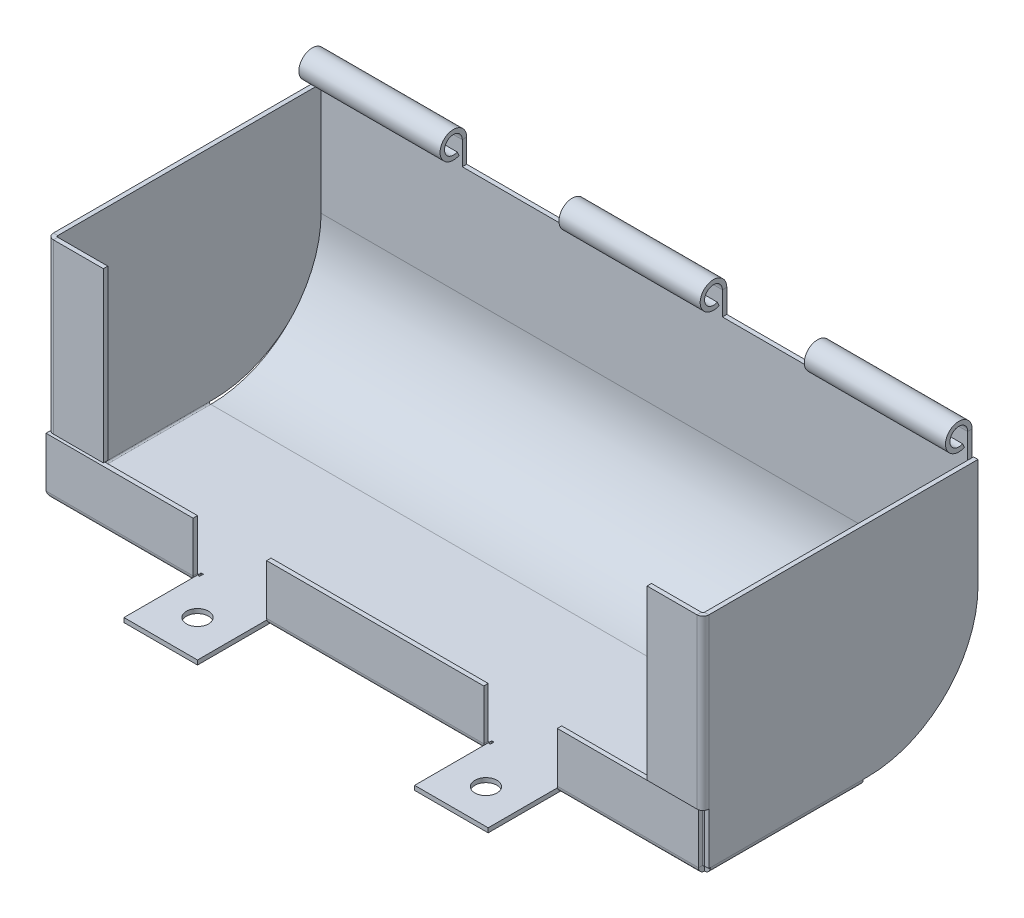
ISO-10303-21;
HEADER;
FILE_DESCRIPTION(('STEP AP214'),'2;1');
FILE_NAME('part.step','',(''),(''),'','','');
FILE_SCHEMA(('AUTOMOTIVE_DESIGN { 1 0 10303 214 1 1 1 1 }'));
ENDSEC;
DATA;
#1=APPLICATION_CONTEXT('core data for automotive mechanical design processes');
#2=APPLICATION_PROTOCOL_DEFINITION('international standard','automotive_design',2000,#1);
#3=PRODUCT_CONTEXT('',#1,'mechanical');
#4=PRODUCT('Part','Part','',(#3));
#5=PRODUCT_RELATED_PRODUCT_CATEGORY('part','',(#4));
#6=PRODUCT_DEFINITION_FORMATION('','',#4);
#7=PRODUCT_DEFINITION_CONTEXT('part definition',#1,'design');
#8=PRODUCT_DEFINITION('design','',#6,#7);
#9=PRODUCT_DEFINITION_SHAPE('','',#8);
#10=(LENGTH_UNIT() NAMED_UNIT(*) SI_UNIT(.MILLI.,.METRE.));
#11=(NAMED_UNIT(*) PLANE_ANGLE_UNIT() SI_UNIT($,.RADIAN.));
#12=(NAMED_UNIT(*) SI_UNIT($,.STERADIAN.) SOLID_ANGLE_UNIT());
#13=UNCERTAINTY_MEASURE_WITH_UNIT(LENGTH_MEASURE(1.E-05),#10,'distance_accuracy_value','');
#14=(GEOMETRIC_REPRESENTATION_CONTEXT(3) GLOBAL_UNCERTAINTY_ASSIGNED_CONTEXT((#13)) GLOBAL_UNIT_ASSIGNED_CONTEXT((#10,
#11,#12)) REPRESENTATION_CONTEXT('',''));
#15=CARTESIAN_POINT('',(0.,0.,0.));
#16=DIRECTION('',(0.,0.,1.));
#17=DIRECTION('',(1.,0.,0.));
#18=AXIS2_PLACEMENT_3D('',#15,#16,#17);
#19=CARTESIAN_POINT('',(-57.3589352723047,38.1961768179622,26.6700000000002));
#20=DIRECTION('',(1.,0.,0.));
#21=DIRECTION('',(0.,1.,0.));
#22=AXIS2_PLACEMENT_3D('',#19,#20,#21);
#23=PLANE('',#22);
#24=DIRECTION('',(1.05352807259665E-09,1.,0.));
#25=VECTOR('',#24,1.);
#26=CARTESIAN_POINT('',(-57.3589352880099,8.76300010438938,25.7810000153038));
#27=LINE('',#26,#25);
#28=CARTESIAN_POINT('',(-57.3589352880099,8.76300010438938,25.7810000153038));
#29=VERTEX_POINT('',#28);
#30=CARTESIAN_POINT('',(-57.3589352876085,9.14400010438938,25.7810000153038));
#31=VERTEX_POINT('',#30);
#32=EDGE_CURVE('E669',#29,#31,#27,.T.);
#33=ORIENTED_EDGE('',*,*,#32,.F.);
#34=DIRECTION('',(-1.23662784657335E-08,0.,-1.));
#35=VECTOR('',#34,1.);
#36=CARTESIAN_POINT('',(-57.3589352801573,8.76300010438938,26.4160000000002));
#37=LINE('',#36,#35);
#38=CARTESIAN_POINT('',(-57.3589352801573,8.76300010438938,26.4160000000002));
#39=VERTEX_POINT('',#38);
#40=EDGE_CURVE('E665',#39,#29,#37,.T.);
#41=ORIENTED_EDGE('',*,*,#40,.F.);
#42=DIRECTION('',(0.,1.,0.));
#43=VECTOR('',#42,1.);
#44=CARTESIAN_POINT('',(-57.3589352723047,-59.747542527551,26.4160000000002));
#45=LINE('',#44,#43);
#46=CARTESIAN_POINT('',(-57.3589353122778,0.254000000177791,26.4160000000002));
#47=VERTEX_POINT('',#46);
#48=EDGE_CURVE('E1303',#47,#39,#45,.T.);
#49=ORIENTED_EDGE('',*,*,#48,.F.);
#50=DIRECTION('',(0.,0.,-1.));
#51=VECTOR('',#50,1.);
#52=CARTESIAN_POINT('',(-57.3589352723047,0.254000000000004,26.6700000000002));
#53=LINE('',#52,#51);
#54=CARTESIAN_POINT('',(-57.3589352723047,0.25399999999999,1.97758476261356E-13));
#55=VERTEX_POINT('',#54);
#56=EDGE_CURVE('E824',#47,#55,#53,.T.);
#57=ORIENTED_EDGE('',*,*,#56,.T.);
#58=DIRECTION('',(0.,0.,1.));
#59=VECTOR('',#58,1.);
#60=CARTESIAN_POINT('',(-57.3589352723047,0.25399999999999,1.97758476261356E-13));
#61=LINE('',#60,#59);
#62=CARTESIAN_POINT('',(-57.3589352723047,0.25399999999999,-0.761999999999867));
#63=VERTEX_POINT('',#62);
#64=EDGE_CURVE('E818',#63,#55,#61,.T.);
#65=ORIENTED_EDGE('',*,*,#64,.F.);
#66=CARTESIAN_POINT('',(-57.3589352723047,19.304,-0.761999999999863));
#67=DIRECTION('',(-1.,0.,0.));
#68=DIRECTION('',(0.,0.,-1.));
#69=AXIS2_PLACEMENT_3D('',#66,#67,#68);
#70=CIRCLE('',#69,19.05);
#71=CARTESIAN_POINT('',(-57.3589352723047,19.304,-19.8119999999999));
#72=VERTEX_POINT('',#71);
#73=EDGE_CURVE('E830',#72,#63,#70,.T.);
#74=ORIENTED_EDGE('',*,*,#73,.F.);
#75=DIRECTION('',(0.,-1.,0.));
#76=VECTOR('',#75,1.);
#77=CARTESIAN_POINT('',(-57.3589352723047,19.304,-19.8119999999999));
#78=LINE('',#77,#76);
#79=CARTESIAN_POINT('',(-57.3589352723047,38.1961768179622,-19.8119999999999));
#80=VERTEX_POINT('',#79);
#81=EDGE_CURVE('E835',#80,#72,#78,.T.);
#82=ORIENTED_EDGE('',*,*,#81,.F.);
#83=DIRECTION('',(0.,0.,-1.));
#84=VECTOR('',#83,1.);
#85=CARTESIAN_POINT('',(-57.3589352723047,38.1961768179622,26.6700000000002));
#86=LINE('',#85,#84);
#87=CARTESIAN_POINT('',(-57.3589352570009,38.1961768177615,26.1620000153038));
#88=VERTEX_POINT('',#87);
#89=EDGE_CURVE('E792',#88,#80,#86,.T.);
#90=ORIENTED_EDGE('',*,*,#89,.F.);
#91=DIRECTION('',(-1.05353717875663E-09,-1.,0.));
#92=VECTOR('',#91,1.);
#93=CARTESIAN_POINT('',(-57.3589352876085,9.14400010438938,26.1620000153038));
#94=LINE('',#93,#92);
#95=CARTESIAN_POINT('',(-57.3589352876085,9.14400010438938,26.1620000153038));
#96=VERTEX_POINT('',#95);
#97=EDGE_CURVE('E639',#96,#88,#94,.F.);
#98=ORIENTED_EDGE('',*,*,#97,.F.);
#99=DIRECTION('',(0.,0.,1.));
#100=VECTOR('',#99,1.);
#101=CARTESIAN_POINT('',(-57.3589352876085,9.14400010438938,25.7810000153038));
#102=LINE('',#101,#100);
#103=EDGE_CURVE('E673',#31,#96,#102,.T.);
#104=ORIENTED_EDGE('',*,*,#103,.F.);
#105=EDGE_LOOP('',(#33,#41,#49,#57,#65,#74,#82,#90,#98,#104));
#106=FACE_BOUND('',#105,.T.);
#107=ADVANCED_FACE('F86',(#106),#23,.T.);
#108=CARTESIAN_POINT('',(-58.1209352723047,38.1961768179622,26.6700000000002));
#109=DIRECTION('',(1.,0.,0.));
#110=DIRECTION('',(0.,1.,0.));
#111=AXIS2_PLACEMENT_3D('',#108,#109,#110);
#112=PLANE('',#111);
#113=DIRECTION('',(0.,0.,1.));
#114=VECTOR('',#113,1.);
#115=CARTESIAN_POINT('',(-58.1209352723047,8.76300010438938,26.6700000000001));
#116=LINE('',#115,#114);
#117=CARTESIAN_POINT('',(-58.1209352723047,8.76300010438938,25.7810000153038));
#118=VERTEX_POINT('',#117);
#119=CARTESIAN_POINT('',(-58.1209352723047,8.76300010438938,26.4160000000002));
#120=VERTEX_POINT('',#119);
#121=EDGE_CURVE('E103',#118,#120,#116,.T.);
#122=ORIENTED_EDGE('',*,*,#121,.F.);
#123=DIRECTION('',(0.,-1.,0.));
#124=VECTOR('',#123,1.);
#125=CARTESIAN_POINT('',(-58.1209352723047,38.1961768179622,25.7810000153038));
#126=LINE('',#125,#124);
#127=CARTESIAN_POINT('',(-58.1209352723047,9.14400010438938,25.7810000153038));
#128=VERTEX_POINT('',#127);
#129=EDGE_CURVE('E13',#128,#118,#126,.T.);
#130=ORIENTED_EDGE('',*,*,#129,.F.);
#131=DIRECTION('',(0.,0.,-1.));
#132=VECTOR('',#131,1.);
#133=CARTESIAN_POINT('',(-58.1209352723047,9.14400010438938,26.6700000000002));
#134=LINE('',#133,#132);
#135=CARTESIAN_POINT('',(-58.1209352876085,9.14400010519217,26.1620000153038));
#136=VERTEX_POINT('',#135);
#137=EDGE_CURVE('E95',#136,#128,#134,.T.);
#138=ORIENTED_EDGE('',*,*,#137,.F.);
#139=DIRECTION('',(-1.05353717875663E-09,-1.,0.));
#140=VECTOR('',#139,1.);
#141=CARTESIAN_POINT('',(-58.1209352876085,9.14400010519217,26.1620000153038));
#142=LINE('',#141,#140);
#143=CARTESIAN_POINT('',(-58.1209352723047,38.1961768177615,26.1620000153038));
#144=VERTEX_POINT('',#143);
#145=EDGE_CURVE('E651',#136,#144,#142,.F.);
#146=ORIENTED_EDGE('',*,*,#145,.T.);
#147=DIRECTION('',(0.,0.,-1.));
#148=VECTOR('',#147,1.);
#149=CARTESIAN_POINT('',(-58.1209352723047,38.1961768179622,26.6700000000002));
#150=LINE('',#149,#148);
#151=CARTESIAN_POINT('',(-58.1209352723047,38.1961768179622,-19.8119999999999));
#152=VERTEX_POINT('',#151);
#153=EDGE_CURVE('E804',#144,#152,#150,.T.);
#154=ORIENTED_EDGE('',*,*,#153,.T.);
#155=DIRECTION('',(0.,-1.,0.));
#156=VECTOR('',#155,1.);
#157=CARTESIAN_POINT('',(-58.1209352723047,19.304,-19.8119999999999));
#158=LINE('',#157,#156);
#159=CARTESIAN_POINT('',(-58.1209352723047,19.304,-19.8119999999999));
#160=VERTEX_POINT('',#159);
#161=EDGE_CURVE('E812',#152,#160,#158,.T.);
#162=ORIENTED_EDGE('',*,*,#161,.T.);
#163=CARTESIAN_POINT('',(-58.1209352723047,19.304,-0.761999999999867));
#164=DIRECTION('',(-1.,0.,0.));
#165=DIRECTION('',(0.,0.,-1.));
#166=AXIS2_PLACEMENT_3D('',#163,#164,#165);
#167=CIRCLE('',#166,19.05);
#168=CARTESIAN_POINT('',(-58.1209352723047,0.25399999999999,-0.76199999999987));
#169=VERTEX_POINT('',#168);
#170=EDGE_CURVE('E815',#160,#169,#167,.T.);
#171=ORIENTED_EDGE('',*,*,#170,.T.);
#172=DIRECTION('',(0.,0.,1.));
#173=VECTOR('',#172,1.);
#174=CARTESIAN_POINT('',(-58.1209352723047,0.253999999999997,1.94289029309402E-13));
#175=LINE('',#174,#173);
#176=CARTESIAN_POINT('',(-58.1209352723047,0.253999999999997,1.94289029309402E-13));
#177=VERTEX_POINT('',#176);
#178=EDGE_CURVE('E1306',#169,#177,#175,.T.);
#179=ORIENTED_EDGE('',*,*,#178,.T.);
#180=DIRECTION('',(0.,0.,-1.));
#181=VECTOR('',#180,1.);
#182=CARTESIAN_POINT('',(-58.1209352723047,0.253999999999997,26.6700000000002));
#183=LINE('',#182,#181);
#184=CARTESIAN_POINT('',(-58.1209352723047,0.25399999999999,26.4160000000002));
#185=VERTEX_POINT('',#184);
#186=EDGE_CURVE('E838',#185,#177,#183,.T.);
#187=ORIENTED_EDGE('',*,*,#186,.F.);
#188=DIRECTION('',(0.,-1.,0.));
#189=VECTOR('',#188,1.);
#190=CARTESIAN_POINT('',(-58.1209352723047,38.1961768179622,26.4160000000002));
#191=LINE('',#190,#189);
#192=EDGE_CURVE('E849',#120,#185,#191,.T.);
#193=ORIENTED_EDGE('',*,*,#192,.F.);
#194=EDGE_LOOP('',(#122,#130,#138,#146,#154,#162,#171,#179,#187,#193));
#195=FACE_BOUND('',#194,.T.);
#196=ADVANCED_FACE('F802',(#195),#112,.F.);
#197=CARTESIAN_POINT('',(-57.3589352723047,0.254000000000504,26.4160000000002));
#198=DIRECTION('',(0.,0.,1.));
#199=DIRECTION('',(0.,-1.,0.));
#200=AXIS2_PLACEMENT_3D('',#197,#198,#199);
#201=PLANE('',#200);
#202=ORIENTED_EDGE('',*,*,#48,.T.);
#203=DIRECTION('',(-1.,0.,0.));
#204=VECTOR('',#203,1.);
#205=CARTESIAN_POINT('',(-57.3589352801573,8.76300010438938,26.4160000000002));
#206=LINE('',#205,#204);
#207=EDGE_CURVE('E668',#39,#120,#206,.T.);
#208=ORIENTED_EDGE('',*,*,#207,.T.);
#209=ORIENTED_EDGE('',*,*,#192,.T.);
#210=DIRECTION('',(-1.,0.,0.));
#211=VECTOR('',#210,1.);
#212=CARTESIAN_POINT('',(-57.3589352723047,0.25399999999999,26.4160000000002));
#213=LINE('',#212,#211);
#214=EDGE_CURVE('E841',#47,#185,#213,.T.);
#215=ORIENTED_EDGE('',*,*,#214,.F.);
#216=EDGE_LOOP('',(#202,#208,#209,#215));
#217=FACE_BOUND('',#216,.T.);
#218=ADVANCED_FACE('F1242',(#217),#201,.T.);
#219=CARTESIAN_POINT('',(30.1696067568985,38.1961768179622,-19.0499999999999));
#220=DIRECTION('',(-1.,0.,0.));
#221=DIRECTION('',(0.,0.,1.));
#222=AXIS2_PLACEMENT_3D('',#219,#220,#221);
#223=PLANE('',#222);
#224=DIRECTION('',(0.,1.,0.));
#225=VECTOR('',#224,1.);
#226=CARTESIAN_POINT('',(30.1696067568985,38.1961768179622,-19.0499999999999));
#227=LINE('',#226,#225);
#228=CARTESIAN_POINT('',(30.1696067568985,38.1961768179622,-19.0499999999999));
#229=VERTEX_POINT('',#228);
#230=CARTESIAN_POINT('',(30.1696067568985,42.2474768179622,-19.0499999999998));
#231=VERTEX_POINT('',#230);
#232=EDGE_CURVE('E1290',#229,#231,#227,.T.);
#233=ORIENTED_EDGE('',*,*,#232,.T.);
#234=DIRECTION('',(0.,0.,-1.));
#235=VECTOR('',#234,1.);
#236=CARTESIAN_POINT('',(30.1696067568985,42.2474768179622,-19.0499999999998));
#237=LINE('',#236,#235);
#238=CARTESIAN_POINT('',(30.1696067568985,42.2474768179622,-19.8119999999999));
#239=VERTEX_POINT('',#238);
#240=EDGE_CURVE('E3139',#231,#239,#237,.T.);
#241=ORIENTED_EDGE('',*,*,#240,.T.);
#242=DIRECTION('',(0.,1.,0.));
#243=VECTOR('',#242,1.);
#244=CARTESIAN_POINT('',(30.1696067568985,38.1961768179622,-19.8119999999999));
#245=LINE('',#244,#243);
#246=CARTESIAN_POINT('',(30.1696067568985,38.1961768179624,-19.8119999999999));
#247=VERTEX_POINT('',#246);
#248=EDGE_CURVE('E1287',#247,#239,#245,.T.);
#249=ORIENTED_EDGE('',*,*,#248,.F.);
#250=DIRECTION('',(0.,0.,-1.));
#251=VECTOR('',#250,1.);
#252=CARTESIAN_POINT('',(30.1696067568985,38.1961768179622,-19.0499999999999));
#253=LINE('',#252,#251);
#254=EDGE_CURVE('E844',#229,#247,#253,.T.);
#255=ORIENTED_EDGE('',*,*,#254,.F.);
#256=EDGE_LOOP('',(#233,#241,#249,#255));
#257=FACE_BOUND('',#256,.T.);
#258=ADVANCED_FACE('F1254',(#257),#223,.T.);
#259=CARTESIAN_POINT('',(-12.192,38.1961768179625,-19.0499999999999));
#260=DIRECTION('',(-1.,0.,0.));
#261=DIRECTION('',(0.,0.,1.));
#262=AXIS2_PLACEMENT_3D('',#259,#260,#261);
#263=PLANE('',#262);
#264=DIRECTION('',(0.,1.,0.));
#265=VECTOR('',#264,1.);
#266=CARTESIAN_POINT('',(-12.192,38.1961768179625,-19.0499999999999));
#267=LINE('',#266,#265);
#268=CARTESIAN_POINT('',(-12.192,38.1961768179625,-19.0499999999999));
#269=VERTEX_POINT('',#268);
#270=CARTESIAN_POINT('',(-12.192,42.2474768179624,-19.0499999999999));
#271=VERTEX_POINT('',#270);
#272=EDGE_CURVE('E1717',#269,#271,#267,.T.);
#273=ORIENTED_EDGE('',*,*,#272,.T.);
#274=DIRECTION('',(0.,0.,-1.));
#275=VECTOR('',#274,1.);
#276=CARTESIAN_POINT('',(-12.192,42.2474768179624,-19.0499999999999));
#277=LINE('',#276,#275);
#278=CARTESIAN_POINT('',(-12.192,42.2474768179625,-19.8119999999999));
#279=VERTEX_POINT('',#278);
#280=EDGE_CURVE('E1752',#271,#279,#277,.T.);
#281=ORIENTED_EDGE('',*,*,#280,.T.);
#282=DIRECTION('',(0.,1.,0.));
#283=VECTOR('',#282,1.);
#284=CARTESIAN_POINT('',(-12.192,38.1961768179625,-19.8119999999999));
#285=LINE('',#284,#283);
#286=CARTESIAN_POINT('',(-12.192,38.1961768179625,-19.8119999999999));
#287=VERTEX_POINT('',#286);
#288=EDGE_CURVE('E1712',#287,#279,#285,.T.);
#289=ORIENTED_EDGE('',*,*,#288,.F.);
#290=DIRECTION('',(0.,0.,-1.));
#291=VECTOR('',#290,1.);
#292=CARTESIAN_POINT('',(-12.192,38.1961768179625,-19.0499999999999));
#293=LINE('',#292,#291);
#294=EDGE_CURVE('E1721',#269,#287,#293,.T.);
#295=ORIENTED_EDGE('',*,*,#294,.F.);
#296=EDGE_LOOP('',(#273,#281,#289,#295));
#297=FACE_BOUND('',#296,.T.);
#298=ADVANCED_FACE('F1801',(#297),#263,.T.);
#299=CARTESIAN_POINT('',(54.5536067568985,38.1961768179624,-19.8119999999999));
#300=DIRECTION('',(0.,-1.,0.));
#301=DIRECTION('',(0.,0.,-1.));
#302=AXIS2_PLACEMENT_3D('',#299,#300,#301);
#303=PLANE('',#302);
#304=DIRECTION('',(1.,0.,0.));
#305=VECTOR('',#304,1.);
#306=CARTESIAN_POINT('',(-57.1049352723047,38.1961768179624,-19.8119999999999));
#307=LINE('',#306,#305);
#308=CARTESIAN_POINT('',(12.192,38.1961768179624,-19.8119999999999));
#309=VERTEX_POINT('',#308);
#310=EDGE_CURVE('E1649',#309,#247,#307,.T.);
#311=ORIENTED_EDGE('',*,*,#310,.F.);
#312=DIRECTION('',(0.,0.,-1.));
#313=VECTOR('',#312,1.);
#314=CARTESIAN_POINT('',(12.192,38.1961768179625,-19.0499999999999));
#315=LINE('',#314,#313);
#316=CARTESIAN_POINT('',(12.192,38.1961768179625,-19.0499999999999));
#317=VERTEX_POINT('',#316);
#318=EDGE_CURVE('E1720',#317,#309,#315,.T.);
#319=ORIENTED_EDGE('',*,*,#318,.F.);
#320=DIRECTION('',(-1.,0.,0.));
#321=VECTOR('',#320,1.);
#322=CARTESIAN_POINT('',(54.5536067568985,38.1961768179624,-19.0499999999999));
#323=LINE('',#322,#321);
#324=EDGE_CURVE('E1651',#317,#229,#323,.F.);
#325=ORIENTED_EDGE('',*,*,#324,.T.);
#326=ORIENTED_EDGE('',*,*,#254,.T.);
#327=EDGE_LOOP('',(#311,#319,#325,#326));
#328=FACE_BOUND('',#327,.T.);
#329=ADVANCED_FACE('F1177',(#328),#303,.F.);
#330=CARTESIAN_POINT('',(55.5696067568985,0.254000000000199,26.4160000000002));
#331=DIRECTION('',(0.,-1.,0.));
#332=DIRECTION('',(1.,0.,0.));
#333=AXIS2_PLACEMENT_3D('',#330,#331,#332);
#334=PLANE('',#333);
#335=DIRECTION('',(-1.,0.,0.));
#336=VECTOR('',#335,1.);
#337=CARTESIAN_POINT('',(55.5696067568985,0.254000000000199,26.4160000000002));
#338=LINE('',#337,#336);
#339=CARTESIAN_POINT('',(55.5696067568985,0.254000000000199,26.4160000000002));
#340=VERTEX_POINT('',#339);
#341=CARTESIAN_POINT('',(54.8076067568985,0.254000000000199,26.4160000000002));
#342=VERTEX_POINT('',#341);
#343=EDGE_CURVE('E2943',#340,#342,#338,.T.);
#344=ORIENTED_EDGE('',*,*,#343,.F.);
#345=DIRECTION('',(0.,0.,-1.));
#346=VECTOR('',#345,1.);
#347=CARTESIAN_POINT('',(55.5696067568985,0.254000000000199,26.6700000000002));
#348=LINE('',#347,#346);
#349=CARTESIAN_POINT('',(55.5696067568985,0.254000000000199,26.6700000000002));
#350=VERTEX_POINT('',#349);
#351=EDGE_CURVE('E3004',#350,#340,#348,.T.);
#352=ORIENTED_EDGE('',*,*,#351,.F.);
#353=DIRECTION('',(1.,0.,0.));
#354=VECTOR('',#353,1.);
#355=CARTESIAN_POINT('',(54.8076067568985,0.254000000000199,26.6700000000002));
#356=LINE('',#355,#354);
#357=CARTESIAN_POINT('',(54.8076067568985,0.254000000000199,26.6700000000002));
#358=VERTEX_POINT('',#357);
#359=EDGE_CURVE('E2963',#358,#350,#356,.T.);
#360=ORIENTED_EDGE('',*,*,#359,.F.);
#361=DIRECTION('',(0.,0.,-1.));
#362=VECTOR('',#361,1.);
#363=CARTESIAN_POINT('',(54.8076067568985,0.254000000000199,26.6700000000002));
#364=LINE('',#363,#362);
#365=EDGE_CURVE('E3007',#358,#342,#364,.T.);
#366=ORIENTED_EDGE('',*,*,#365,.T.);
#367=EDGE_LOOP('',(#344,#352,#360,#366));
#368=FACE_BOUND('',#367,.T.);
#369=ADVANCED_FACE('F88',(#368),#334,.T.);
#370=CARTESIAN_POINT('',(54.5536067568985,0.254000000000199,26.6700000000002));
#371=DIRECTION('',(0.,0.,-1.));
#372=DIRECTION('',(-1.,0.,0.));
#373=AXIS2_PLACEMENT_3D('',#370,#371,#372);
#374=CYLINDRICAL_SURFACE('',#373,0.254);
#375=DIRECTION('',(0.,0.,-1.));
#376=VECTOR('',#375,1.);
#377=CARTESIAN_POINT('',(54.5536067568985,1.97758476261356E-13,26.6700000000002));
#378=LINE('',#377,#376);
#379=CARTESIAN_POINT('',(54.5536067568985,2.0122792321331E-13,26.4160000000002));
#380=VERTEX_POINT('',#379);
#381=CARTESIAN_POINT('',(54.5536067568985,0.,2.0122792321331E-13));
#382=VERTEX_POINT('',#381);
#383=EDGE_CURVE('E2923',#380,#382,#378,.T.);
#384=ORIENTED_EDGE('',*,*,#383,.F.);
#385=CARTESIAN_POINT('',(54.5536067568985,0.254000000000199,26.4160000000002));
#386=DIRECTION('',(0.,0.,1.));
#387=DIRECTION('',(0.,-1.,0.));
#388=AXIS2_PLACEMENT_3D('',#385,#386,#387);
#389=CIRCLE('',#388,0.254);
#390=EDGE_CURVE('E2929',#380,#342,#389,.T.);
#391=ORIENTED_EDGE('',*,*,#390,.T.);
#392=CARTESIAN_POINT('',(54.8076067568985,0.254000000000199,1.97758476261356E-13));
#393=VERTEX_POINT('',#392);
#394=EDGE_CURVE('E2933',#342,#393,#364,.T.);
#395=ORIENTED_EDGE('',*,*,#394,.T.);
#396=CARTESIAN_POINT('',(54.5536067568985,0.254000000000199,1.97758476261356E-13));
#397=DIRECTION('',(0.,0.,-1.));
#398=DIRECTION('',(-1.,0.,0.));
#399=AXIS2_PLACEMENT_3D('',#396,#397,#398);
#400=CIRCLE('',#399,0.254);
#401=EDGE_CURVE('E2932',#382,#393,#400,.F.);
#402=ORIENTED_EDGE('',*,*,#401,.F.);
#403=EDGE_LOOP('',(#384,#391,#395,#402));
#404=FACE_BOUND('',#403,.T.);
#405=ADVANCED_FACE('F1212',(#404),#374,.F.);
#406=CARTESIAN_POINT('',(54.5536067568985,0.254000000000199,26.4160000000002));
#407=DIRECTION('',(0.,0.,1.));
#408=DIRECTION('',(0.,-1.,0.));
#409=AXIS2_PLACEMENT_3D('',#406,#407,#408);
#410=PLANE('',#409);
#411=CARTESIAN_POINT('',(54.5536067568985,0.254000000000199,26.4160000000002));
#412=DIRECTION('',(0.,0.,1.));
#413=DIRECTION('',(0.,-1.,0.));
#414=AXIS2_PLACEMENT_3D('',#411,#412,#413);
#415=CIRCLE('',#414,1.016);
#416=CARTESIAN_POINT('',(54.5536067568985,-0.761999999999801,26.4160000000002));
#417=VERTEX_POINT('',#416);
#418=EDGE_CURVE('E2936',#417,#340,#415,.T.);
#419=ORIENTED_EDGE('',*,*,#418,.T.);
#420=ORIENTED_EDGE('',*,*,#343,.T.);
#421=ORIENTED_EDGE('',*,*,#390,.F.);
#422=DIRECTION('',(0.,-1.,0.));
#423=VECTOR('',#422,1.);
#424=CARTESIAN_POINT('',(54.5536067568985,2.0122792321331E-13,26.4160000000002));
#425=LINE('',#424,#423);
#426=EDGE_CURVE('E1404',#380,#417,#425,.T.);
#427=ORIENTED_EDGE('',*,*,#426,.T.);
#428=EDGE_LOOP('',(#419,#420,#421,#427));
#429=FACE_BOUND('',#428,.T.);
#430=ADVANCED_FACE('F1210',(#429),#410,.T.);
#431=CARTESIAN_POINT('',(-57.3589352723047,1.97758476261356E-13,26.6700000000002));
#432=DIRECTION('',(0.,1.,0.));
#433=DIRECTION('',(0.,0.,1.));
#434=AXIS2_PLACEMENT_3D('',#431,#432,#433);
#435=PLANE('',#434);
#436=CARTESIAN_POINT('',(23.8196067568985,0.,33.4010000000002));
#437=DIRECTION('',(0.,1.,0.));
#438=DIRECTION('',(0.,0.,1.));
#439=AXIS2_PLACEMENT_3D('',#436,#437,#438);
#440=CIRCLE('',#439,1.905);
#441=CARTESIAN_POINT('',(23.8196067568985,0.,35.3060000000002));
#442=VERTEX_POINT('',#441);
#443=EDGE_CURVE('E762',#442,#442,#440,.T.);
#444=ORIENTED_EDGE('',*,*,#443,.F.);
#445=EDGE_LOOP('',(#444));
#446=FACE_BOUND('',#445,.T.);
#447=CARTESIAN_POINT('',(-26.3709352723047,0.,33.0200000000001));
#448=DIRECTION('',(0.,1.,0.));
#449=DIRECTION('',(0.,0.,1.));
#450=AXIS2_PLACEMENT_3D('',#447,#448,#449);
#451=CIRCLE('',#450,1.905);
#452=CARTESIAN_POINT('',(-26.3709352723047,0.,34.9250000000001));
#453=VERTEX_POINT('',#452);
#454=EDGE_CURVE('E751',#453,#453,#451,.T.);
#455=ORIENTED_EDGE('',*,*,#454,.F.);
#456=EDGE_LOOP('',(#455));
#457=FACE_BOUND('',#456,.T.);
#458=DIRECTION('',(0.,0.,-1.));
#459=VECTOR('',#458,1.);
#460=CARTESIAN_POINT('',(30.1696067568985,2.0122792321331E-13,26.4160000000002));
#461=LINE('',#460,#459);
#462=CARTESIAN_POINT('',(30.1696067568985,2.0122792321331E-13,26.4160000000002));
#463=VERTEX_POINT('',#462);
#464=CARTESIAN_POINT('',(30.1696067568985,1.97758476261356E-13,26.0350000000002));
#465=VERTEX_POINT('',#464);
#466=EDGE_CURVE('E1467',#463,#465,#461,.T.);
#467=ORIENTED_EDGE('',*,*,#466,.F.);
#468=DIRECTION('',(1.,0.,0.));
#469=VECTOR('',#468,1.);
#470=CARTESIAN_POINT('',(54.5536067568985,2.0122792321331E-13,26.4160000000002));
#471=LINE('',#470,#469);
#472=EDGE_CURVE('E1393',#380,#463,#471,.F.);
#473=ORIENTED_EDGE('',*,*,#472,.F.);
#474=ORIENTED_EDGE('',*,*,#383,.T.);
#475=DIRECTION('',(1.,0.,0.));
#476=VECTOR('',#475,1.);
#477=CARTESIAN_POINT('',(-57.3589352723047,1.97758476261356E-13,1.97758476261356E-13));
#478=LINE('',#477,#476);
#479=CARTESIAN_POINT('',(-57.1049352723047,-3.99728598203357E-08,1.97758476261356E-13));
#480=VERTEX_POINT('',#479);
#481=EDGE_CURVE('E2976',#480,#382,#478,.T.);
#482=ORIENTED_EDGE('',*,*,#481,.F.);
#483=DIRECTION('',(0.,0.,-1.));
#484=VECTOR('',#483,1.);
#485=CARTESIAN_POINT('',(-57.1049352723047,1.97758476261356E-13,26.6700000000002));
#486=LINE('',#485,#484);
#487=CARTESIAN_POINT('',(-57.1049352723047,-3.99728598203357E-08,26.416));
#488=VERTEX_POINT('',#487);
#489=EDGE_CURVE('E1325',#488,#480,#486,.T.);
#490=ORIENTED_EDGE('',*,*,#489,.F.);
#491=DIRECTION('',(-1.,0.,0.));
#492=VECTOR('',#491,1.);
#493=CARTESIAN_POINT('',(-32.7209352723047,2.0122792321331E-13,26.4160000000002));
#494=LINE('',#493,#492);
#495=CARTESIAN_POINT('',(-32.7209352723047,2.0122792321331E-13,26.4160000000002));
#496=VERTEX_POINT('',#495);
#497=EDGE_CURVE('E2950',#496,#488,#494,.T.);
#498=ORIENTED_EDGE('',*,*,#497,.F.);
#499=DIRECTION('',(0.,0.,1.));
#500=VECTOR('',#499,1.);
#501=CARTESIAN_POINT('',(-32.7209352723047,1.97758476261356E-13,26.0350000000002));
#502=LINE('',#501,#500);
#503=CARTESIAN_POINT('',(-32.7209352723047,1.97758476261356E-13,26.0350000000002));
#504=VERTEX_POINT('',#503);
#505=EDGE_CURVE('E1545',#504,#496,#502,.T.);
#506=ORIENTED_EDGE('',*,*,#505,.F.);
#507=DIRECTION('',(-1.,0.,0.));
#508=VECTOR('',#507,1.);
#509=CARTESIAN_POINT('',(-32.3399352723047,1.97758476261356E-13,26.0350000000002));
#510=LINE('',#509,#508);
#511=CARTESIAN_POINT('',(-32.3399352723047,1.97758476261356E-13,26.0350000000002));
#512=VERTEX_POINT('',#511);
#513=EDGE_CURVE('E1541',#512,#504,#510,.T.);
#514=ORIENTED_EDGE('',*,*,#513,.F.);
#515=DIRECTION('',(0.,0.,-1.));
#516=VECTOR('',#515,1.);
#517=CARTESIAN_POINT('',(-32.3399352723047,1.97758476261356E-13,26.6700000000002));
#518=LINE('',#517,#516);
#519=CARTESIAN_POINT('',(-32.3399352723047,1.97758476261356E-13,26.6700000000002));
#520=VERTEX_POINT('',#519);
#521=EDGE_CURVE('E1537',#520,#512,#518,.T.);
#522=ORIENTED_EDGE('',*,*,#521,.F.);
#523=DIRECTION('',(1.,0.,0.));
#524=VECTOR('',#523,1.);
#525=CARTESIAN_POINT('',(-32.7209352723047,1.97758476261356E-13,26.6700000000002));
#526=LINE('',#525,#524);
#527=CARTESIAN_POINT('',(-32.7209352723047,1.97758476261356E-13,26.6700000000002));
#528=VERTEX_POINT('',#527);
#529=EDGE_CURVE('E1533',#528,#520,#526,.T.);
#530=ORIENTED_EDGE('',*,*,#529,.F.);
#531=DIRECTION('',(0.,0.,1.));
#532=VECTOR('',#531,1.);
#533=CARTESIAN_POINT('',(-32.7209352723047,1.97758476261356E-13,26.6700000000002));
#534=LINE('',#533,#532);
#535=CARTESIAN_POINT('',(-32.7209352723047,2.0122792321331E-13,39.3700000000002));
#536=VERTEX_POINT('',#535);
#537=EDGE_CURVE('E1559',#528,#536,#534,.T.);
#538=ORIENTED_EDGE('',*,*,#537,.T.);
#539=DIRECTION('',(1.,0.,0.));
#540=VECTOR('',#539,1.);
#541=CARTESIAN_POINT('',(-20.0209352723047,2.0122792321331E-13,39.3700000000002));
#542=LINE('',#541,#540);
#543=CARTESIAN_POINT('',(-20.0209352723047,2.0122792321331E-13,39.3700000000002));
#544=VERTEX_POINT('',#543);
#545=EDGE_CURVE('E1562',#536,#544,#542,.T.);
#546=ORIENTED_EDGE('',*,*,#545,.T.);
#547=DIRECTION('',(0.,0.,-1.));
#548=VECTOR('',#547,1.);
#549=CARTESIAN_POINT('',(-20.0209352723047,1.97758476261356E-13,26.6700000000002));
#550=LINE('',#549,#548);
#551=CARTESIAN_POINT('',(-20.0209352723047,1.97758476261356E-13,26.6700000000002));
#552=VERTEX_POINT('',#551);
#553=EDGE_CURVE('E1556',#544,#552,#550,.T.);
#554=ORIENTED_EDGE('',*,*,#553,.T.);
#555=DIRECTION('',(1.,0.,0.));
#556=VECTOR('',#555,1.);
#557=CARTESIAN_POINT('',(-20.4019352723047,1.97758476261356E-13,26.6700000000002));
#558=LINE('',#557,#556);
#559=CARTESIAN_POINT('',(-20.4019352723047,1.97758476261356E-13,26.6700000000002));
#560=VERTEX_POINT('',#559);
#561=EDGE_CURVE('E1515',#560,#552,#558,.T.);
#562=ORIENTED_EDGE('',*,*,#561,.F.);
#563=DIRECTION('',(0.,0.,1.));
#564=VECTOR('',#563,1.);
#565=CARTESIAN_POINT('',(-20.4019352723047,1.97758476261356E-13,26.0350000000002));
#566=LINE('',#565,#564);
#567=CARTESIAN_POINT('',(-20.4019352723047,1.97758476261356E-13,26.0350000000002));
#568=VERTEX_POINT('',#567);
#569=EDGE_CURVE('E1511',#568,#560,#566,.T.);
#570=ORIENTED_EDGE('',*,*,#569,.F.);
#571=DIRECTION('',(-1.,0.,0.));
#572=VECTOR('',#571,1.);
#573=CARTESIAN_POINT('',(-20.0209352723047,1.97758476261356E-13,26.0350000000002));
#574=LINE('',#573,#572);
#575=CARTESIAN_POINT('',(-20.0209352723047,1.97758476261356E-13,26.0350000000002));
#576=VERTEX_POINT('',#575);
#577=EDGE_CURVE('E1507',#576,#568,#574,.T.);
#578=ORIENTED_EDGE('',*,*,#577,.F.);
#579=DIRECTION('',(0.,0.,-1.));
#580=VECTOR('',#579,1.);
#581=CARTESIAN_POINT('',(-20.0209352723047,2.0122792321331E-13,26.4160000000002));
#582=LINE('',#581,#580);
#583=CARTESIAN_POINT('',(-20.0209352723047,2.0122792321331E-13,26.4160000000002));
#584=VERTEX_POINT('',#583);
#585=EDGE_CURVE('E1504',#584,#576,#582,.T.);
#586=ORIENTED_EDGE('',*,*,#585,.F.);
#587=DIRECTION('',(1.,0.,0.));
#588=VECTOR('',#587,1.);
#589=CARTESIAN_POINT('',(17.4696067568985,2.0122792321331E-13,26.4160000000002));
#590=LINE('',#589,#588);
#591=CARTESIAN_POINT('',(17.4696067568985,2.0122792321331E-13,26.4160000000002));
#592=VERTEX_POINT('',#591);
#593=EDGE_CURVE('E1447',#592,#584,#590,.F.);
#594=ORIENTED_EDGE('',*,*,#593,.F.);
#595=DIRECTION('',(0.,0.,1.));
#596=VECTOR('',#595,1.);
#597=CARTESIAN_POINT('',(17.4696067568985,1.97758476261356E-13,26.0350000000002));
#598=LINE('',#597,#596);
#599=CARTESIAN_POINT('',(17.4696067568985,1.97758476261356E-13,26.0350000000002));
#600=VERTEX_POINT('',#599);
#601=EDGE_CURVE('E1501',#600,#592,#598,.T.);
#602=ORIENTED_EDGE('',*,*,#601,.F.);
#603=DIRECTION('',(-1.,0.,0.));
#604=VECTOR('',#603,1.);
#605=CARTESIAN_POINT('',(17.8506067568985,1.97758476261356E-13,26.0350000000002));
#606=LINE('',#605,#604);
#607=CARTESIAN_POINT('',(17.8506067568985,1.97758476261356E-13,26.0350000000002));
#608=VERTEX_POINT('',#607);
#609=EDGE_CURVE('E1497',#608,#600,#606,.T.);
#610=ORIENTED_EDGE('',*,*,#609,.F.);
#611=DIRECTION('',(0.,0.,-1.));
#612=VECTOR('',#611,1.);
#613=CARTESIAN_POINT('',(17.8506067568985,1.97758476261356E-13,26.6700000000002));
#614=LINE('',#613,#612);
#615=CARTESIAN_POINT('',(17.8506067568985,1.97758476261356E-13,26.6700000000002));
#616=VERTEX_POINT('',#615);
#617=EDGE_CURVE('E1493',#616,#608,#614,.T.);
#618=ORIENTED_EDGE('',*,*,#617,.F.);
#619=DIRECTION('',(1.,0.,0.));
#620=VECTOR('',#619,1.);
#621=CARTESIAN_POINT('',(17.4696067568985,1.97758476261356E-13,26.6700000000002));
#622=LINE('',#621,#620);
#623=CARTESIAN_POINT('',(17.4696067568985,1.97758476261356E-13,26.6700000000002));
#624=VERTEX_POINT('',#623);
#625=EDGE_CURVE('E1489',#624,#616,#622,.T.);
#626=ORIENTED_EDGE('',*,*,#625,.F.);
#627=DIRECTION('',(0.,0.,1.));
#628=VECTOR('',#627,1.);
#629=CARTESIAN_POINT('',(17.4696067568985,1.97758476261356E-13,26.6700000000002));
#630=LINE('',#629,#628);
#631=CARTESIAN_POINT('',(17.4696067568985,2.0122792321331E-13,39.3700000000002));
#632=VERTEX_POINT('',#631);
#633=EDGE_CURVE('E1587',#624,#632,#630,.T.);
#634=ORIENTED_EDGE('',*,*,#633,.T.);
#635=DIRECTION('',(1.,0.,0.));
#636=VECTOR('',#635,1.);
#637=CARTESIAN_POINT('',(30.1696067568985,2.0122792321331E-13,39.3700000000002));
#638=LINE('',#637,#636);
#639=CARTESIAN_POINT('',(30.1696067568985,2.0122792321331E-13,39.3700000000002));
#640=VERTEX_POINT('',#639);
#641=EDGE_CURVE('E1590',#632,#640,#638,.T.);
#642=ORIENTED_EDGE('',*,*,#641,.T.);
#643=DIRECTION('',(0.,0.,-1.));
#644=VECTOR('',#643,1.);
#645=CARTESIAN_POINT('',(30.1696067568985,1.97758476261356E-13,26.6700000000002));
#646=LINE('',#645,#644);
#647=CARTESIAN_POINT('',(30.1696067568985,1.97758476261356E-13,26.6700000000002));
#648=VERTEX_POINT('',#647);
#649=EDGE_CURVE('E1577',#640,#648,#646,.T.);
#650=ORIENTED_EDGE('',*,*,#649,.T.);
#651=DIRECTION('',(1.,0.,0.));
#652=VECTOR('',#651,1.);
#653=CARTESIAN_POINT('',(29.7886067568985,1.97758476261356E-13,26.6700000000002));
#654=LINE('',#653,#652);
#655=CARTESIAN_POINT('',(29.7886067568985,1.97758476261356E-13,26.6700000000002));
#656=VERTEX_POINT('',#655);
#657=EDGE_CURVE('E1479',#656,#648,#654,.T.);
#658=ORIENTED_EDGE('',*,*,#657,.F.);
#659=DIRECTION('',(0.,0.,1.));
#660=VECTOR('',#659,1.);
#661=CARTESIAN_POINT('',(29.7886067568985,1.97758476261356E-13,26.0350000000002));
#662=LINE('',#661,#660);
#663=CARTESIAN_POINT('',(29.7886067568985,1.97758476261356E-13,26.0350000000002));
#664=VERTEX_POINT('',#663);
#665=EDGE_CURVE('E1475',#664,#656,#662,.T.);
#666=ORIENTED_EDGE('',*,*,#665,.F.);
#667=DIRECTION('',(-1.,0.,0.));
#668=VECTOR('',#667,1.);
#669=CARTESIAN_POINT('',(30.1696067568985,1.97758476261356E-13,26.0350000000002));
#670=LINE('',#669,#668);
#671=EDGE_CURVE('E1471',#465,#664,#670,.T.);
#672=ORIENTED_EDGE('',*,*,#671,.F.);
#673=EDGE_LOOP('',(#467,#473,#474,#482,#490,#498,#506,#514,#522,#530,#538,#546,#554,#562,#570,
#578,#586,#594,#602,#610,#618,#626,#634,#642,#650,#658,#666,#672));
#674=FACE_BOUND('',#673,.T.);
#675=ADVANCED_FACE('F1206',(#446,#457,#674),#435,.T.);
#676=CARTESIAN_POINT('',(-57.3589352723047,-0.761999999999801,26.6700000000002));
#677=DIRECTION('',(0.,1.,0.));
#678=DIRECTION('',(0.,0.,1.));
#679=AXIS2_PLACEMENT_3D('',#676,#677,#678);
#680=PLANE('',#679);
#681=CARTESIAN_POINT('',(23.8196067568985,-0.761999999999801,33.4010000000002));
#682=DIRECTION('',(0.,1.,0.));
#683=DIRECTION('',(0.,0.,1.));
#684=AXIS2_PLACEMENT_3D('',#681,#682,#683);
#685=CIRCLE('',#684,1.905);
#686=CARTESIAN_POINT('',(23.8196067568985,-0.761999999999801,35.3060000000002));
#687=VERTEX_POINT('',#686);
#688=EDGE_CURVE('E90',#687,#687,#685,.T.);
#689=ORIENTED_EDGE('',*,*,#688,.T.);
#690=EDGE_LOOP('',(#689));
#691=FACE_BOUND('',#690,.T.);
#692=CARTESIAN_POINT('',(-26.3709352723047,-0.761999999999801,33.0200000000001));
#693=DIRECTION('',(0.,1.,0.));
#694=DIRECTION('',(0.,0.,1.));
#695=AXIS2_PLACEMENT_3D('',#692,#693,#694);
#696=CIRCLE('',#695,1.905);
#697=CARTESIAN_POINT('',(-26.3709352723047,-0.761999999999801,34.9250000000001));
#698=VERTEX_POINT('',#697);
#699=EDGE_CURVE('E748',#698,#698,#696,.T.);
#700=ORIENTED_EDGE('',*,*,#699,.T.);
#701=EDGE_LOOP('',(#700));
#702=FACE_BOUND('',#701,.T.);
#703=DIRECTION('',(1.,0.,0.));
#704=VECTOR('',#703,1.);
#705=CARTESIAN_POINT('',(54.5536067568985,-0.761999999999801,26.4160000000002));
#706=LINE('',#705,#704);
#707=CARTESIAN_POINT('',(30.1696067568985,-0.761999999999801,26.4160000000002));
#708=VERTEX_POINT('',#707);
#709=EDGE_CURVE('E1398',#417,#708,#706,.F.);
#710=ORIENTED_EDGE('',*,*,#709,.T.);
#711=DIRECTION('',(0.,0.,1.));
#712=VECTOR('',#711,1.);
#713=CARTESIAN_POINT('',(30.1696067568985,-0.761999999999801,26.6700000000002));
#714=LINE('',#713,#712);
#715=CARTESIAN_POINT('',(30.1696067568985,-0.761999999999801,26.0350000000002));
#716=VERTEX_POINT('',#715);
#717=EDGE_CURVE('E2902',#716,#708,#714,.T.);
#718=ORIENTED_EDGE('',*,*,#717,.F.);
#719=DIRECTION('',(1.,0.,0.));
#720=VECTOR('',#719,1.);
#721=CARTESIAN_POINT('',(-57.3589352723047,-0.761999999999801,26.0350000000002));
#722=LINE('',#721,#720);
#723=CARTESIAN_POINT('',(29.7886067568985,-0.761999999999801,26.0350000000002));
#724=VERTEX_POINT('',#723);
#725=EDGE_CURVE('E2945',#724,#716,#722,.T.);
#726=ORIENTED_EDGE('',*,*,#725,.F.);
#727=DIRECTION('',(0.,0.,-1.));
#728=VECTOR('',#727,1.);
#729=CARTESIAN_POINT('',(29.7886067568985,-0.761999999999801,26.6700000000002));
#730=LINE('',#729,#728);
#731=CARTESIAN_POINT('',(29.7886067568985,-0.761999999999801,26.6700000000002));
#732=VERTEX_POINT('',#731);
#733=EDGE_CURVE('E3037',#732,#724,#730,.T.);
#734=ORIENTED_EDGE('',*,*,#733,.F.);
#735=DIRECTION('',(-1.,0.,0.));
#736=VECTOR('',#735,1.);
#737=CARTESIAN_POINT('',(-57.3589352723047,-0.761999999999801,26.6700000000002));
#738=LINE('',#737,#736);
#739=CARTESIAN_POINT('',(30.1696067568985,-0.761999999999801,26.6700000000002));
#740=VERTEX_POINT('',#739);
#741=EDGE_CURVE('E1470',#740,#732,#738,.T.);
#742=ORIENTED_EDGE('',*,*,#741,.F.);
#743=DIRECTION('',(0.,0.,-1.));
#744=VECTOR('',#743,1.);
#745=CARTESIAN_POINT('',(30.1696067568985,-0.761999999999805,26.6700000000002));
#746=LINE('',#745,#744);
#747=CARTESIAN_POINT('',(30.1696067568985,-0.761999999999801,39.3700000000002));
#748=VERTEX_POINT('',#747);
#749=EDGE_CURVE('E1593',#748,#740,#746,.T.);
#750=ORIENTED_EDGE('',*,*,#749,.F.);
#751=DIRECTION('',(1.,0.,0.));
#752=VECTOR('',#751,1.);
#753=CARTESIAN_POINT('',(30.1696067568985,-0.761999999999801,39.3700000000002));
#754=LINE('',#753,#752);
#755=CARTESIAN_POINT('',(17.4696067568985,-0.761999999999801,39.3700000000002));
#756=VERTEX_POINT('',#755);
#757=EDGE_CURVE('E1599',#756,#748,#754,.T.);
#758=ORIENTED_EDGE('',*,*,#757,.F.);
#759=DIRECTION('',(0.,0.,1.));
#760=VECTOR('',#759,1.);
#761=CARTESIAN_POINT('',(17.4696067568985,-0.761999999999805,26.6700000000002));
#762=LINE('',#761,#760);
#763=CARTESIAN_POINT('',(17.4696067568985,-0.761999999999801,26.6700000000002));
#764=VERTEX_POINT('',#763);
#765=EDGE_CURVE('E1596',#764,#756,#762,.T.);
#766=ORIENTED_EDGE('',*,*,#765,.F.);
#767=DIRECTION('',(-1.,0.,0.));
#768=VECTOR('',#767,1.);
#769=CARTESIAN_POINT('',(-57.3589352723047,-0.761999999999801,26.6700000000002));
#770=LINE('',#769,#768);
#771=CARTESIAN_POINT('',(17.8506067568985,-0.761999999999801,26.6700000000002));
#772=VERTEX_POINT('',#771);
#773=EDGE_CURVE('E1530',#772,#764,#770,.T.);
#774=ORIENTED_EDGE('',*,*,#773,.F.);
#775=DIRECTION('',(0.,0.,1.));
#776=VECTOR('',#775,1.);
#777=CARTESIAN_POINT('',(17.8506067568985,-0.761999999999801,26.6700000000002));
#778=LINE('',#777,#776);
#779=CARTESIAN_POINT('',(17.8506067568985,-0.761999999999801,26.0350000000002));
#780=VERTEX_POINT('',#779);
#781=EDGE_CURVE('E3035',#780,#772,#778,.T.);
#782=ORIENTED_EDGE('',*,*,#781,.F.);
#783=DIRECTION('',(1.,0.,0.));
#784=VECTOR('',#783,1.);
#785=CARTESIAN_POINT('',(-57.3589352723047,-0.761999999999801,26.0350000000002));
#786=LINE('',#785,#784);
#787=CARTESIAN_POINT('',(17.4696067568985,-0.761999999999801,26.0350000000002));
#788=VERTEX_POINT('',#787);
#789=EDGE_CURVE('E3033',#788,#780,#786,.T.);
#790=ORIENTED_EDGE('',*,*,#789,.F.);
#791=DIRECTION('',(0.,0.,-1.));
#792=VECTOR('',#791,1.);
#793=CARTESIAN_POINT('',(17.4696067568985,-0.761999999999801,26.6700000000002));
#794=LINE('',#793,#792);
#795=CARTESIAN_POINT('',(17.4696067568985,-0.761999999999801,26.4160000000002));
#796=VERTEX_POINT('',#795);
#797=EDGE_CURVE('E3031',#796,#788,#794,.T.);
#798=ORIENTED_EDGE('',*,*,#797,.F.);
#799=DIRECTION('',(1.,0.,0.));
#800=VECTOR('',#799,1.);
#801=CARTESIAN_POINT('',(17.4696067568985,-0.761999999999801,26.4160000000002));
#802=LINE('',#801,#800);
#803=CARTESIAN_POINT('',(-20.0209352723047,-0.761999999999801,26.4160000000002));
#804=VERTEX_POINT('',#803);
#805=EDGE_CURVE('E1452',#796,#804,#802,.F.);
#806=ORIENTED_EDGE('',*,*,#805,.T.);
#807=DIRECTION('',(0.,0.,1.));
#808=VECTOR('',#807,1.);
#809=CARTESIAN_POINT('',(-20.0209352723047,-0.761999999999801,26.6700000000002));
#810=LINE('',#809,#808);
#811=CARTESIAN_POINT('',(-20.0209352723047,-0.761999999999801,26.0350000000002));
#812=VERTEX_POINT('',#811);
#813=EDGE_CURVE('E3029',#812,#804,#810,.T.);
#814=ORIENTED_EDGE('',*,*,#813,.F.);
#815=DIRECTION('',(1.,0.,0.));
#816=VECTOR('',#815,1.);
#817=CARTESIAN_POINT('',(-57.3589352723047,-0.761999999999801,26.0350000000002));
#818=LINE('',#817,#816);
#819=CARTESIAN_POINT('',(-20.4019352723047,-0.761999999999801,26.0350000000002));
#820=VERTEX_POINT('',#819);
#821=EDGE_CURVE('E3027',#820,#812,#818,.T.);
#822=ORIENTED_EDGE('',*,*,#821,.F.);
#823=DIRECTION('',(0.,0.,-1.));
#824=VECTOR('',#823,1.);
#825=CARTESIAN_POINT('',(-20.4019352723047,-0.761999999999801,26.6700000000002));
#826=LINE('',#825,#824);
#827=CARTESIAN_POINT('',(-20.4019352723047,-0.761999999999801,26.6700000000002));
#828=VERTEX_POINT('',#827);
#829=EDGE_CURVE('E3025',#828,#820,#826,.T.);
#830=ORIENTED_EDGE('',*,*,#829,.F.);
#831=DIRECTION('',(-1.,0.,0.));
#832=VECTOR('',#831,1.);
#833=CARTESIAN_POINT('',(-57.3589352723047,-0.761999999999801,26.6700000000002));
#834=LINE('',#833,#832);
#835=CARTESIAN_POINT('',(-20.0209352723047,-0.761999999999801,26.6700000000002));
#836=VERTEX_POINT('',#835);
#837=EDGE_CURVE('E1492',#836,#828,#834,.T.);
#838=ORIENTED_EDGE('',*,*,#837,.F.);
#839=DIRECTION('',(0.,0.,-1.));
#840=VECTOR('',#839,1.);
#841=CARTESIAN_POINT('',(-20.0209352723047,-0.761999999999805,26.6700000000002));
#842=LINE('',#841,#840);
#843=CARTESIAN_POINT('',(-20.0209352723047,-0.761999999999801,39.3700000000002));
#844=VERTEX_POINT('',#843);
#845=EDGE_CURVE('E1565',#844,#836,#842,.T.);
#846=ORIENTED_EDGE('',*,*,#845,.F.);
#847=DIRECTION('',(1.,0.,0.));
#848=VECTOR('',#847,1.);
#849=CARTESIAN_POINT('',(-20.0209352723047,-0.761999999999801,39.3700000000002));
#850=LINE('',#849,#848);
#851=CARTESIAN_POINT('',(-32.7209352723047,-0.761999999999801,39.3700000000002));
#852=VERTEX_POINT('',#851);
#853=EDGE_CURVE('E1571',#852,#844,#850,.T.);
#854=ORIENTED_EDGE('',*,*,#853,.F.);
#855=DIRECTION('',(0.,0.,1.));
#856=VECTOR('',#855,1.);
#857=CARTESIAN_POINT('',(-32.7209352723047,-0.761999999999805,26.6700000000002));
#858=LINE('',#857,#856);
#859=CARTESIAN_POINT('',(-32.7209352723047,-0.761999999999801,26.6700000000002));
#860=VERTEX_POINT('',#859);
#861=EDGE_CURVE('E1568',#860,#852,#858,.T.);
#862=ORIENTED_EDGE('',*,*,#861,.F.);
#863=DIRECTION('',(-1.,0.,0.));
#864=VECTOR('',#863,1.);
#865=CARTESIAN_POINT('',(-57.3589352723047,-0.761999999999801,26.6700000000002));
#866=LINE('',#865,#864);
#867=CARTESIAN_POINT('',(-32.3399352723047,-0.761999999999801,26.6700000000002));
#868=VERTEX_POINT('',#867);
#869=EDGE_CURVE('E1536',#868,#860,#866,.T.);
#870=ORIENTED_EDGE('',*,*,#869,.F.);
#871=DIRECTION('',(0.,0.,1.));
#872=VECTOR('',#871,1.);
#873=CARTESIAN_POINT('',(-32.3399352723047,-0.761999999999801,26.6700000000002));
#874=LINE('',#873,#872);
#875=CARTESIAN_POINT('',(-32.3399352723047,-0.761999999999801,26.0350000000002));
#876=VERTEX_POINT('',#875);
#877=EDGE_CURVE('E3022',#876,#868,#874,.T.);
#878=ORIENTED_EDGE('',*,*,#877,.F.);
#879=DIRECTION('',(1.,0.,0.));
#880=VECTOR('',#879,1.);
#881=CARTESIAN_POINT('',(-57.3589352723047,-0.761999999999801,26.0350000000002));
#882=LINE('',#881,#880);
#883=CARTESIAN_POINT('',(-32.7209352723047,-0.761999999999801,26.0350000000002));
#884=VERTEX_POINT('',#883);
#885=EDGE_CURVE('E2961',#884,#876,#882,.T.);
#886=ORIENTED_EDGE('',*,*,#885,.F.);
#887=DIRECTION('',(0.,0.,-1.));
#888=VECTOR('',#887,1.);
#889=CARTESIAN_POINT('',(-32.7209352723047,-0.761999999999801,26.6700000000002));
#890=LINE('',#889,#888);
#891=CARTESIAN_POINT('',(-32.7209352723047,-0.761999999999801,26.4160000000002));
#892=VERTEX_POINT('',#891);
#893=EDGE_CURVE('E2959',#892,#884,#890,.T.);
#894=ORIENTED_EDGE('',*,*,#893,.F.);
#895=DIRECTION('',(-1.,0.,0.));
#896=VECTOR('',#895,1.);
#897=CARTESIAN_POINT('',(-32.7209352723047,-0.761999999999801,26.4160000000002));
#898=LINE('',#897,#896);
#899=CARTESIAN_POINT('',(-57.1049352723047,-0.761999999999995,26.4160000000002));
#900=VERTEX_POINT('',#899);
#901=EDGE_CURVE('E1341',#892,#900,#898,.T.);
#902=ORIENTED_EDGE('',*,*,#901,.T.);
#903=DIRECTION('',(0.,0.,-1.));
#904=VECTOR('',#903,1.);
#905=CARTESIAN_POINT('',(-57.1049352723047,-0.761999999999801,26.6700000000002));
#906=LINE('',#905,#904);
#907=CARTESIAN_POINT('',(-57.1049352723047,-0.76200003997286,1.94554150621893E-13));
#908=VERTEX_POINT('',#907);
#909=EDGE_CURVE('E1324',#900,#908,#906,.T.);
#910=ORIENTED_EDGE('',*,*,#909,.T.);
#911=DIRECTION('',(1.,0.,0.));
#912=VECTOR('',#911,1.);
#913=CARTESIAN_POINT('',(-57.3589352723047,-0.761999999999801,1.97758476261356E-13));
#914=LINE('',#913,#912);
#915=CARTESIAN_POINT('',(54.5536067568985,-0.761999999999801,1.97758476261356E-13));
#916=VERTEX_POINT('',#915);
#917=EDGE_CURVE('E2980',#908,#916,#914,.T.);
#918=ORIENTED_EDGE('',*,*,#917,.T.);
#919=DIRECTION('',(0.,0.,-1.));
#920=VECTOR('',#919,1.);
#921=CARTESIAN_POINT('',(54.5536067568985,-0.761999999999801,26.6700000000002));
#922=LINE('',#921,#920);
#923=EDGE_CURVE('E2904',#417,#916,#922,.T.);
#924=ORIENTED_EDGE('',*,*,#923,.F.);
#925=EDGE_LOOP('',(#710,#718,#726,#734,#742,#750,#758,#766,#774,#782,#790,#798,#806,#814,#822,
#830,#838,#846,#854,#862,#870,#878,#886,#894,#902,#910,#918,#924));
#926=FACE_BOUND('',#925,.T.);
#927=ADVANCED_FACE('F1202',(#691,#702,#926),#680,.F.);
#928=CARTESIAN_POINT('',(54.5536067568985,-0.761999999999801,26.6700000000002));
#929=DIRECTION('',(0.,0.,1.));
#930=DIRECTION('',(1.,0.,0.));
#931=AXIS2_PLACEMENT_3D('',#928,#929,#930);
#932=PLANE('',#931);
#933=DIRECTION('',(1.,0.,0.));
#934=VECTOR('',#933,1.);
#935=CARTESIAN_POINT('',(54.8076067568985,9.14400000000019,26.6700000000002));
#936=LINE('',#935,#934);
#937=CARTESIAN_POINT('',(54.8076067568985,9.14400000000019,26.6700000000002));
#938=VERTEX_POINT('',#937);
#939=CARTESIAN_POINT('',(55.5696067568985,9.14400000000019,26.6700000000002));
#940=VERTEX_POINT('',#939);
#941=EDGE_CURVE('E111',#938,#940,#936,.T.);
#942=ORIENTED_EDGE('',*,*,#941,.F.);
#943=DIRECTION('',(0.,1.,0.));
#944=VECTOR('',#943,1.);
#945=CARTESIAN_POINT('',(54.8076067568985,1.97758476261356E-13,26.6700000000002));
#946=LINE('',#945,#944);
#947=EDGE_CURVE('E1655',#358,#938,#946,.T.);
#948=ORIENTED_EDGE('',*,*,#947,.F.);
#949=ORIENTED_EDGE('',*,*,#359,.T.);
#950=DIRECTION('',(0.,1.,0.));
#951=VECTOR('',#950,1.);
#952=CARTESIAN_POINT('',(55.5696067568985,1.97758476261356E-13,26.6700000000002));
#953=LINE('',#952,#951);
#954=EDGE_CURVE('E728',#350,#940,#953,.T.);
#955=ORIENTED_EDGE('',*,*,#954,.T.);
#956=EDGE_LOOP('',(#942,#948,#949,#955));
#957=FACE_BOUND('',#956,.T.);
#958=ADVANCED_FACE('F1205',(#957),#932,.T.);
#959=CARTESIAN_POINT('',(54.5536067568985,1.97758476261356E-13,1.97758476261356E-13));
#960=DIRECTION('',(0.,0.,-1.));
#961=DIRECTION('',(-1.,0.,0.));
#962=AXIS2_PLACEMENT_3D('',#959,#960,#961);
#963=PLANE('',#962);
#964=DIRECTION('',(0.,-1.,0.));
#965=VECTOR('',#964,1.);
#966=CARTESIAN_POINT('',(54.5536067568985,1.97758476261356E-13,1.97758476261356E-13));
#967=LINE('',#966,#965);
#968=EDGE_CURVE('E3017',#382,#916,#967,.T.);
#969=ORIENTED_EDGE('',*,*,#968,.F.);
#970=ORIENTED_EDGE('',*,*,#401,.T.);
#971=DIRECTION('',(-1.,0.,0.));
#972=VECTOR('',#971,1.);
#973=CARTESIAN_POINT('',(55.5696067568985,0.254000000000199,1.97758476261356E-13));
#974=LINE('',#973,#972);
#975=CARTESIAN_POINT('',(55.5696067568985,0.254000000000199,1.97758476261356E-13));
#976=VERTEX_POINT('',#975);
#977=EDGE_CURVE('E3014',#976,#393,#974,.T.);
#978=ORIENTED_EDGE('',*,*,#977,.F.);
#979=CARTESIAN_POINT('',(54.5536067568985,0.254000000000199,1.97758476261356E-13));
#980=DIRECTION('',(0.,0.,1.));
#981=DIRECTION('',(1.,0.,0.));
#982=AXIS2_PLACEMENT_3D('',#979,#980,#981);
#983=CIRCLE('',#982,1.016);
#984=EDGE_CURVE('E2997',#916,#976,#983,.T.);
#985=ORIENTED_EDGE('',*,*,#984,.F.);
#986=EDGE_LOOP('',(#969,#970,#978,#985));
#987=FACE_BOUND('',#986,.T.);
#988=ADVANCED_FACE('F1226',(#987),#963,.T.);
#989=CARTESIAN_POINT('',(55.5696067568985,1.97758476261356E-13,26.6700000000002));
#990=DIRECTION('',(-1.,0.,0.));
#991=DIRECTION('',(0.,-1.,0.));
#992=AXIS2_PLACEMENT_3D('',#989,#990,#991);
#993=PLANE('',#992);
#994=ORIENTED_EDGE('',*,*,#351,.T.);
#995=EDGE_CURVE('E2940',#340,#976,#348,.T.);
#996=ORIENTED_EDGE('',*,*,#995,.T.);
#997=DIRECTION('',(0.,0.,-1.));
#998=VECTOR('',#997,1.);
#999=CARTESIAN_POINT('',(55.5696067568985,0.254000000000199,1.97758476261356E-13));
#1000=LINE('',#999,#998);
#1001=CARTESIAN_POINT('',(55.5696067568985,0.254000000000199,-0.76199999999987));
#1002=VERTEX_POINT('',#1001);
#1003=EDGE_CURVE('E1605',#976,#1002,#1000,.T.);
#1004=ORIENTED_EDGE('',*,*,#1003,.T.);
#1005=CARTESIAN_POINT('',(55.5696067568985,19.3040000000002,-0.761999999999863));
#1006=DIRECTION('',(1.,0.,0.));
#1007=DIRECTION('',(0.,0.,-1.));
#1008=AXIS2_PLACEMENT_3D('',#1005,#1006,#1007);
#1009=CIRCLE('',#1008,19.05);
#1010=CARTESIAN_POINT('',(55.5696067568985,19.3040000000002,-19.8119999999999));
#1011=VERTEX_POINT('',#1010);
#1012=EDGE_CURVE('E1614',#1002,#1011,#1009,.T.);
#1013=ORIENTED_EDGE('',*,*,#1012,.T.);
#1014=DIRECTION('',(0.,1.,0.));
#1015=VECTOR('',#1014,1.);
#1016=CARTESIAN_POINT('',(55.5696067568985,19.3040000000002,-19.8119999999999));
#1017=LINE('',#1016,#1015);
#1018=CARTESIAN_POINT('',(55.5696067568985,38.1961768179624,-19.8119999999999));
#1019=VERTEX_POINT('',#1018);
#1020=EDGE_CURVE('E1617',#1011,#1019,#1017,.T.);
#1021=ORIENTED_EDGE('',*,*,#1020,.T.);
#1022=DIRECTION('',(0.,0.,-1.));
#1023=VECTOR('',#1022,1.);
#1024=CARTESIAN_POINT('',(55.5696067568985,38.1961768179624,26.6700000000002));
#1025=LINE('',#1024,#1023);
#1026=CARTESIAN_POINT('',(55.5696067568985,38.1961768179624,26.6700000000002));
#1027=VERTEX_POINT('',#1026);
#1028=EDGE_CURVE('E3012',#1027,#1019,#1025,.T.);
#1029=ORIENTED_EDGE('',*,*,#1028,.F.);
#1030=DIRECTION('',(0.,1.,0.));
#1031=VECTOR('',#1030,1.);
#1032=CARTESIAN_POINT('',(55.5696067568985,38.1961768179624,26.6700000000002));
#1033=LINE('',#1032,#1031);
#1034=EDGE_CURVE('E717',#1027,#940,#1033,.F.);
#1035=ORIENTED_EDGE('',*,*,#1034,.T.);
#1036=ORIENTED_EDGE('',*,*,#954,.F.);
#1037=EDGE_LOOP('',(#994,#996,#1004,#1013,#1021,#1029,#1035,#1036));
#1038=FACE_BOUND('',#1037,.T.);
#1039=ADVANCED_FACE('F1222',(#1038),#993,.F.);
#1040=CARTESIAN_POINT('',(54.8076067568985,38.1961768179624,26.6700000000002));
#1041=DIRECTION('',(0.,1.,0.));
#1042=DIRECTION('',(0.,0.,1.));
#1043=AXIS2_PLACEMENT_3D('',#1040,#1041,#1042);
#1044=PLANE('',#1043);
#1045=ORIENTED_EDGE('',*,*,#1028,.T.);
#1046=DIRECTION('',(1.,0.,0.));
#1047=VECTOR('',#1046,1.);
#1048=CARTESIAN_POINT('',(54.8076067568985,38.1961768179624,-19.8119999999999));
#1049=LINE('',#1048,#1047);
#1050=CARTESIAN_POINT('',(54.8076067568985,38.1961768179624,-19.8119999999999));
#1051=VERTEX_POINT('',#1050);
#1052=EDGE_CURVE('E1630',#1051,#1019,#1049,.T.);
#1053=ORIENTED_EDGE('',*,*,#1052,.F.);
#1054=DIRECTION('',(0.,0.,-1.));
#1055=VECTOR('',#1054,1.);
#1056=CARTESIAN_POINT('',(54.8076067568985,38.1961768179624,26.6700000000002));
#1057=LINE('',#1056,#1055);
#1058=CARTESIAN_POINT('',(54.8076067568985,38.1961768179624,26.6700000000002));
#1059=VERTEX_POINT('',#1058);
#1060=EDGE_CURVE('E3010',#1059,#1051,#1057,.T.);
#1061=ORIENTED_EDGE('',*,*,#1060,.F.);
#1062=DIRECTION('',(1.,0.,0.));
#1063=VECTOR('',#1062,1.);
#1064=CARTESIAN_POINT('',(54.8076067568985,38.1961768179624,26.6700000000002));
#1065=LINE('',#1064,#1063);
#1066=EDGE_CURVE('E3000',#1059,#1027,#1065,.T.);
#1067=ORIENTED_EDGE('',*,*,#1066,.T.);
#1068=EDGE_LOOP('',(#1045,#1053,#1061,#1067));
#1069=FACE_BOUND('',#1068,.T.);
#1070=ADVANCED_FACE('F1218',(#1069),#1044,.T.);
#1071=CARTESIAN_POINT('',(54.8076067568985,1.97758476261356E-13,26.6700000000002));
#1072=DIRECTION('',(-1.,0.,0.));
#1073=DIRECTION('',(0.,-1.,0.));
#1074=AXIS2_PLACEMENT_3D('',#1071,#1072,#1073);
#1075=PLANE('',#1074);
#1076=ORIENTED_EDGE('',*,*,#1060,.T.);
#1077=DIRECTION('',(0.,1.,0.));
#1078=VECTOR('',#1077,1.);
#1079=CARTESIAN_POINT('',(54.8076067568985,19.3040000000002,-19.8119999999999));
#1080=LINE('',#1079,#1078);
#1081=CARTESIAN_POINT('',(54.8076067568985,19.3040000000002,-19.8119999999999));
#1082=VERTEX_POINT('',#1081);
#1083=EDGE_CURVE('E1626',#1082,#1051,#1080,.T.);
#1084=ORIENTED_EDGE('',*,*,#1083,.F.);
#1085=CARTESIAN_POINT('',(54.8076067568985,19.3040000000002,-0.761999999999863));
#1086=DIRECTION('',(1.,0.,0.));
#1087=DIRECTION('',(0.,0.,-1.));
#1088=AXIS2_PLACEMENT_3D('',#1085,#1086,#1087);
#1089=CIRCLE('',#1088,19.05);
#1090=CARTESIAN_POINT('',(54.8076067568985,0.254000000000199,-0.76199999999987));
#1091=VERTEX_POINT('',#1090);
#1092=EDGE_CURVE('E1623',#1091,#1082,#1089,.T.);
#1093=ORIENTED_EDGE('',*,*,#1092,.F.);
#1094=DIRECTION('',(0.,0.,-1.));
#1095=VECTOR('',#1094,1.);
#1096=CARTESIAN_POINT('',(54.8076067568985,0.254000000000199,1.97758476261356E-13));
#1097=LINE('',#1096,#1095);
#1098=EDGE_CURVE('E1620',#393,#1091,#1097,.T.);
#1099=ORIENTED_EDGE('',*,*,#1098,.F.);
#1100=ORIENTED_EDGE('',*,*,#394,.F.);
#1101=ORIENTED_EDGE('',*,*,#365,.F.);
#1102=ORIENTED_EDGE('',*,*,#947,.T.);
#1103=DIRECTION('',(0.,1.,0.));
#1104=VECTOR('',#1103,1.);
#1105=CARTESIAN_POINT('',(54.8076067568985,38.1961768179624,26.6700000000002));
#1106=LINE('',#1105,#1104);
#1107=EDGE_CURVE('E713',#1059,#938,#1106,.F.);
#1108=ORIENTED_EDGE('',*,*,#1107,.F.);
#1109=EDGE_LOOP('',(#1076,#1084,#1093,#1099,#1100,#1101,#1102,#1108));
#1110=FACE_BOUND('',#1109,.T.);
#1111=ADVANCED_FACE('F1200',(#1110),#1075,.T.);
#1112=CARTESIAN_POINT('',(54.5536067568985,0.254000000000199,26.6700000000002));
#1113=DIRECTION('',(0.,0.,-1.));
#1114=DIRECTION('',(-1.,0.,0.));
#1115=AXIS2_PLACEMENT_3D('',#1112,#1113,#1114);
#1116=CYLINDRICAL_SURFACE('',#1115,1.016);
#1117=ORIENTED_EDGE('',*,*,#418,.F.);
#1118=ORIENTED_EDGE('',*,*,#923,.T.);
#1119=ORIENTED_EDGE('',*,*,#984,.T.);
#1120=ORIENTED_EDGE('',*,*,#995,.F.);
#1121=EDGE_LOOP('',(#1117,#1118,#1119,#1120));
#1122=FACE_BOUND('',#1121,.T.);
#1123=ADVANCED_FACE('F1193',(#1122),#1116,.T.);
#1124=CARTESIAN_POINT('',(54.5536067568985,19.05,1.97758476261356E-13));
#1125=DIRECTION('',(1.,0.,0.));
#1126=DIRECTION('',(0.,0.,-1.));
#1127=AXIS2_PLACEMENT_3D('',#1124,#1125,#1126);
#1128=PLANE('',#1127);
#1129=DIRECTION('',(0.,0.,1.));
#1130=VECTOR('',#1129,1.);
#1131=CARTESIAN_POINT('',(54.5536067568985,19.0500000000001,-19.8119999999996));
#1132=LINE('',#1131,#1130);
#1133=CARTESIAN_POINT('',(54.5536067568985,19.0499999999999,-19.0499999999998));
#1134=VERTEX_POINT('',#1133);
#1135=CARTESIAN_POINT('',(54.5536067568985,19.0499999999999,-19.8119999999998));
#1136=VERTEX_POINT('',#1135);
#1137=EDGE_CURVE('E1633',#1134,#1136,#1132,.F.);
#1138=ORIENTED_EDGE('',*,*,#1137,.F.);
#1139=CARTESIAN_POINT('',(54.5536067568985,19.05,1.97758476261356E-13));
#1140=DIRECTION('',(-1.,0.,0.));
#1141=DIRECTION('',(0.,0.,1.));
#1142=AXIS2_PLACEMENT_3D('',#1139,#1140,#1141);
#1143=CIRCLE('',#1142,19.05);
#1144=EDGE_CURVE('E2985',#382,#1134,#1143,.F.);
#1145=ORIENTED_EDGE('',*,*,#1144,.F.);
#1146=ORIENTED_EDGE('',*,*,#968,.T.);
#1147=CARTESIAN_POINT('',(54.5536067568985,19.05,1.97758476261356E-13));
#1148=DIRECTION('',(-1.,0.,0.));
#1149=DIRECTION('',(0.,0.,1.));
#1150=AXIS2_PLACEMENT_3D('',#1147,#1148,#1149);
#1151=CIRCLE('',#1150,19.812);
#1152=EDGE_CURVE('E2991',#916,#1136,#1151,.F.);
#1153=ORIENTED_EDGE('',*,*,#1152,.T.);
#1154=EDGE_LOOP('',(#1138,#1145,#1146,#1153));
#1155=FACE_BOUND('',#1154,.T.);
#1156=ADVANCED_FACE('F1190',(#1155),#1128,.T.);
#1157=CARTESIAN_POINT('',(-57.1049352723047,19.05,1.97758476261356E-13));
#1158=DIRECTION('',(1.,0.,0.));
#1159=DIRECTION('',(0.,0.,-1.));
#1160=AXIS2_PLACEMENT_3D('',#1157,#1158,#1159);
#1161=PLANE('',#1160);
#1162=CARTESIAN_POINT('',(-57.1049352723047,19.05,1.97758476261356E-13));
#1163=DIRECTION('',(-1.,0.,0.));
#1164=DIRECTION('',(0.,0.,1.));
#1165=AXIS2_PLACEMENT_3D('',#1162,#1163,#1164);
#1166=CIRCLE('',#1165,19.05);
#1167=CARTESIAN_POINT('',(-57.1049352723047,19.0499999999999,-19.0499999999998));
#1168=VERTEX_POINT('',#1167);
#1169=EDGE_CURVE('E1639',#1168,#480,#1166,.T.);
#1170=ORIENTED_EDGE('',*,*,#1169,.F.);
#1171=DIRECTION('',(0.,0.,1.));
#1172=VECTOR('',#1171,1.);
#1173=CARTESIAN_POINT('',(-57.1049352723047,19.0500000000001,-19.0499999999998));
#1174=LINE('',#1173,#1172);
#1175=CARTESIAN_POINT('',(-57.1049352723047,19.0500000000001,-19.8119999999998));
#1176=VERTEX_POINT('',#1175);
#1177=EDGE_CURVE('E3119',#1168,#1176,#1174,.F.);
#1178=ORIENTED_EDGE('',*,*,#1177,.T.);
#1179=CARTESIAN_POINT('',(-57.1049352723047,19.05,1.97758476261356E-13));
#1180=DIRECTION('',(-1.,0.,0.));
#1181=DIRECTION('',(0.,0.,1.));
#1182=AXIS2_PLACEMENT_3D('',#1179,#1180,#1181);
#1183=CIRCLE('',#1182,19.812);
#1184=EDGE_CURVE('E2987',#1176,#908,#1183,.T.);
#1185=ORIENTED_EDGE('',*,*,#1184,.T.);
#1186=DIRECTION('',(0.,1.,0.));
#1187=VECTOR('',#1186,1.);
#1188=CARTESIAN_POINT('',(-57.1049352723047,-0.761999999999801,1.97758476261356E-13));
#1189=LINE('',#1188,#1187);
#1190=EDGE_CURVE('E1321',#908,#480,#1189,.T.);
#1191=ORIENTED_EDGE('',*,*,#1190,.T.);
#1192=EDGE_LOOP('',(#1170,#1178,#1185,#1191));
#1193=FACE_BOUND('',#1192,.T.);
#1194=ADVANCED_FACE('F1186',(#1193),#1161,.F.);
#1195=CARTESIAN_POINT('',(-57.1049352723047,19.05,1.97758476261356E-13));
#1196=DIRECTION('',(-1.,0.,0.));
#1197=DIRECTION('',(0.,0.,-1.));
#1198=AXIS2_PLACEMENT_3D('',#1195,#1196,#1197);
#1199=CYLINDRICAL_SURFACE('',#1198,19.812);
#1200=ORIENTED_EDGE('',*,*,#917,.F.);
#1201=ORIENTED_EDGE('',*,*,#1184,.F.);
#1202=DIRECTION('',(-1.,0.,0.));
#1203=VECTOR('',#1202,1.);
#1204=CARTESIAN_POINT('',(54.5536067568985,19.0500000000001,-19.8119999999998));
#1205=LINE('',#1204,#1203);
#1206=EDGE_CURVE('E1677',#1176,#1136,#1205,.F.);
#1207=ORIENTED_EDGE('',*,*,#1206,.T.);
#1208=ORIENTED_EDGE('',*,*,#1152,.F.);
#1209=EDGE_LOOP('',(#1200,#1201,#1207,#1208));
#1210=FACE_BOUND('',#1209,.T.);
#1211=ADVANCED_FACE('F1184',(#1210),#1199,.T.);
#1212=CARTESIAN_POINT('',(-57.1049352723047,19.05,1.97758476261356E-13));
#1213=DIRECTION('',(-1.,0.,0.));
#1214=DIRECTION('',(0.,0.,-1.));
#1215=AXIS2_PLACEMENT_3D('',#1212,#1213,#1214);
#1216=CYLINDRICAL_SURFACE('',#1215,19.05);
#1217=ORIENTED_EDGE('',*,*,#481,.T.);
#1218=ORIENTED_EDGE('',*,*,#1144,.T.);
#1219=DIRECTION('',(-1.,0.,0.));
#1220=VECTOR('',#1219,1.);
#1221=CARTESIAN_POINT('',(54.5536067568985,19.0500000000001,-19.0499999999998));
#1222=LINE('',#1221,#1220);
#1223=EDGE_CURVE('E2983',#1134,#1168,#1222,.T.);
#1224=ORIENTED_EDGE('',*,*,#1223,.T.);
#1225=ORIENTED_EDGE('',*,*,#1169,.T.);
#1226=EDGE_LOOP('',(#1217,#1218,#1224,#1225));
#1227=FACE_BOUND('',#1226,.T.);
#1228=ADVANCED_FACE('F1180',(#1227),#1216,.F.);
#1229=CARTESIAN_POINT('',(-57.1049352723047,38.1961768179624,-19.8119999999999));
#1230=DIRECTION('',(1.,0.,0.));
#1231=DIRECTION('',(0.,1.,0.));
#1232=AXIS2_PLACEMENT_3D('',#1229,#1230,#1231);
#1233=PLANE('',#1232);
#1234=DIRECTION('',(0.,-1.,0.));
#1235=VECTOR('',#1234,1.);
#1236=CARTESIAN_POINT('',(-57.1049352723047,38.1961768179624,-19.0499999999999));
#1237=LINE('',#1236,#1235);
#1238=CARTESIAN_POINT('',(-57.1049352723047,42.2474768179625,-19.0499999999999));
#1239=VERTEX_POINT('',#1238);
#1240=EDGE_CURVE('E1654',#1168,#1239,#1237,.F.);
#1241=ORIENTED_EDGE('',*,*,#1240,.T.);
#1242=DIRECTION('',(0.,0.,-1.));
#1243=VECTOR('',#1242,1.);
#1244=CARTESIAN_POINT('',(-57.1049352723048,42.2474768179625,-19.0499999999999));
#1245=LINE('',#1244,#1243);
#1246=CARTESIAN_POINT('',(-57.1049352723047,42.2474768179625,-19.8119999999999));
#1247=VERTEX_POINT('',#1246);
#1248=EDGE_CURVE('E1694',#1239,#1247,#1245,.T.);
#1249=ORIENTED_EDGE('',*,*,#1248,.T.);
#1250=DIRECTION('',(0.,1.,0.));
#1251=VECTOR('',#1250,1.);
#1252=CARTESIAN_POINT('',(-57.1049352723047,1.94289029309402E-13,-19.8119999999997));
#1253=LINE('',#1252,#1251);
#1254=EDGE_CURVE('E1643',#1176,#1247,#1253,.T.);
#1255=ORIENTED_EDGE('',*,*,#1254,.F.);
#1256=ORIENTED_EDGE('',*,*,#1177,.F.);
#1257=EDGE_LOOP('',(#1241,#1249,#1255,#1256));
#1258=FACE_BOUND('',#1257,.T.);
#1259=ADVANCED_FACE('F1172',(#1258),#1233,.F.);
#1260=CARTESIAN_POINT('',(54.5536067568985,1.94289029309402E-13,-19.8119999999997));
#1261=DIRECTION('',(-1.,0.,0.));
#1262=DIRECTION('',(0.,-1.,0.));
#1263=AXIS2_PLACEMENT_3D('',#1260,#1261,#1262);
#1264=PLANE('',#1263);
#1265=DIRECTION('',(0.,-1.,0.));
#1266=VECTOR('',#1265,1.);
#1267=CARTESIAN_POINT('',(54.5536067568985,2.15105711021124E-13,-19.8119999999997));
#1268=LINE('',#1267,#1266);
#1269=CARTESIAN_POINT('',(54.5536067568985,42.2474768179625,-19.8119999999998));
#1270=VERTEX_POINT('',#1269);
#1271=EDGE_CURVE('E1637',#1270,#1136,#1268,.T.);
#1272=ORIENTED_EDGE('',*,*,#1271,.F.);
#1273=DIRECTION('',(0.,0.,-1.));
#1274=VECTOR('',#1273,1.);
#1275=CARTESIAN_POINT('',(54.5536067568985,42.2474768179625,-19.0499999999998));
#1276=LINE('',#1275,#1274);
#1277=CARTESIAN_POINT('',(54.5536067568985,42.2474768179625,-19.0499999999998));
#1278=VERTEX_POINT('',#1277);
#1279=EDGE_CURVE('E3135',#1278,#1270,#1276,.T.);
#1280=ORIENTED_EDGE('',*,*,#1279,.F.);
#1281=DIRECTION('',(0.,1.,0.));
#1282=VECTOR('',#1281,1.);
#1283=CARTESIAN_POINT('',(54.5536067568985,2.0122792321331E-13,-19.0499999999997));
#1284=LINE('',#1283,#1282);
#1285=EDGE_CURVE('E1659',#1278,#1134,#1284,.F.);
#1286=ORIENTED_EDGE('',*,*,#1285,.T.);
#1287=ORIENTED_EDGE('',*,*,#1137,.T.);
#1288=EDGE_LOOP('',(#1272,#1280,#1286,#1287));
#1289=FACE_BOUND('',#1288,.T.);
#1290=ADVANCED_FACE('F1168',(#1289),#1264,.F.);
#1291=CARTESIAN_POINT('',(-57.1049352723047,1.94289029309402E-13,-19.8119999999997));
#1292=DIRECTION('',(0.,0.,1.));
#1293=DIRECTION('',(0.,-1.,0.));
#1294=AXIS2_PLACEMENT_3D('',#1291,#1292,#1293);
#1295=PLANE('',#1294);
#1296=ORIENTED_EDGE('',*,*,#248,.T.);
#1297=DIRECTION('',(-1.,0.,0.));
#1298=VECTOR('',#1297,1.);
#1299=CARTESIAN_POINT('',(30.1696067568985,42.2474768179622,-19.8119999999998));
#1300=LINE('',#1299,#1298);
#1301=EDGE_CURVE('E3144',#239,#1270,#1300,.F.);
#1302=ORIENTED_EDGE('',*,*,#1301,.T.);
#1303=ORIENTED_EDGE('',*,*,#1271,.T.);
#1304=ORIENTED_EDGE('',*,*,#1206,.F.);
#1305=ORIENTED_EDGE('',*,*,#1254,.T.);
#1306=DIRECTION('',(-1.,0.,0.));
#1307=VECTOR('',#1306,1.);
#1308=CARTESIAN_POINT('',(-57.1049352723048,42.2474768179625,-19.8119999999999));
#1309=LINE('',#1308,#1307);
#1310=CARTESIAN_POINT('',(-32.7209352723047,42.2474768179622,-19.8119999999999));
#1311=VERTEX_POINT('',#1310);
#1312=EDGE_CURVE('E1674',#1247,#1311,#1309,.F.);
#1313=ORIENTED_EDGE('',*,*,#1312,.T.);
#1314=DIRECTION('',(0.,-1.,0.));
#1315=VECTOR('',#1314,1.);
#1316=CARTESIAN_POINT('',(-32.7209352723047,38.1961768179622,-19.8119999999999));
#1317=LINE('',#1316,#1315);
#1318=CARTESIAN_POINT('',(-32.7209352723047,38.1961768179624,-19.8119999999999));
#1319=VERTEX_POINT('',#1318);
#1320=EDGE_CURVE('E1723',#1311,#1319,#1317,.T.);
#1321=ORIENTED_EDGE('',*,*,#1320,.T.);
#1322=EDGE_CURVE('E1640',#1319,#287,#307,.T.);
#1323=ORIENTED_EDGE('',*,*,#1322,.T.);
#1324=ORIENTED_EDGE('',*,*,#288,.T.);
#1325=DIRECTION('',(-1.,0.,0.));
#1326=VECTOR('',#1325,1.);
#1327=CARTESIAN_POINT('',(-12.192,42.2474768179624,-19.8119999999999));
#1328=LINE('',#1327,#1326);
#1329=CARTESIAN_POINT('',(12.192,42.2474768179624,-19.8119999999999));
#1330=VERTEX_POINT('',#1329);
#1331=EDGE_CURVE('E1734',#279,#1330,#1328,.F.);
#1332=ORIENTED_EDGE('',*,*,#1331,.T.);
#1333=DIRECTION('',(0.,-1.,0.));
#1334=VECTOR('',#1333,1.);
#1335=CARTESIAN_POINT('',(12.192,38.1961768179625,-19.8119999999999));
#1336=LINE('',#1335,#1334);
#1337=EDGE_CURVE('E1709',#1330,#309,#1336,.T.);
#1338=ORIENTED_EDGE('',*,*,#1337,.T.);
#1339=ORIENTED_EDGE('',*,*,#310,.T.);
#1340=EDGE_LOOP('',(#1296,#1302,#1303,#1304,#1305,#1313,#1321,#1323,#1324,#1332,#1338,#1339));
#1341=FACE_BOUND('',#1340,.T.);
#1342=ADVANCED_FACE('F1164',(#1341),#1295,.F.);
#1343=CARTESIAN_POINT('',(-57.1049352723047,2.0122792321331E-13,-19.0499999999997));
#1344=DIRECTION('',(0.,0.,1.));
#1345=DIRECTION('',(0.,-1.,0.));
#1346=AXIS2_PLACEMENT_3D('',#1343,#1344,#1345);
#1347=PLANE('',#1346);
#1348=DIRECTION('',(-1.,0.,0.));
#1349=VECTOR('',#1348,1.);
#1350=CARTESIAN_POINT('',(30.1696067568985,42.2474768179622,-19.0499999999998));
#1351=LINE('',#1350,#1349);
#1352=EDGE_CURVE('E3125',#231,#1278,#1351,.F.);
#1353=ORIENTED_EDGE('',*,*,#1352,.F.);
#1354=ORIENTED_EDGE('',*,*,#232,.F.);
#1355=ORIENTED_EDGE('',*,*,#324,.F.);
#1356=DIRECTION('',(0.,-1.,0.));
#1357=VECTOR('',#1356,1.);
#1358=CARTESIAN_POINT('',(12.192,38.1961768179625,-19.0499999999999));
#1359=LINE('',#1358,#1357);
#1360=CARTESIAN_POINT('',(12.192,42.2474768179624,-19.0499999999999));
#1361=VERTEX_POINT('',#1360);
#1362=EDGE_CURVE('E1715',#1361,#317,#1359,.T.);
#1363=ORIENTED_EDGE('',*,*,#1362,.F.);
#1364=DIRECTION('',(-1.,0.,0.));
#1365=VECTOR('',#1364,1.);
#1366=CARTESIAN_POINT('',(-12.192,42.2474768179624,-19.0499999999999));
#1367=LINE('',#1366,#1365);
#1368=EDGE_CURVE('E3162',#271,#1361,#1367,.F.);
#1369=ORIENTED_EDGE('',*,*,#1368,.F.);
#1370=ORIENTED_EDGE('',*,*,#272,.F.);
#1371=CARTESIAN_POINT('',(-32.7209352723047,38.1961768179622,-19.0499999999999));
#1372=VERTEX_POINT('',#1371);
#1373=EDGE_CURVE('E1653',#1372,#269,#323,.F.);
#1374=ORIENTED_EDGE('',*,*,#1373,.F.);
#1375=DIRECTION('',(0.,-1.,0.));
#1376=VECTOR('',#1375,1.);
#1377=CARTESIAN_POINT('',(-32.7209352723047,38.1961768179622,-19.0499999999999));
#1378=LINE('',#1377,#1376);
#1379=CARTESIAN_POINT('',(-32.7209352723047,42.2474768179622,-19.0499999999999));
#1380=VERTEX_POINT('',#1379);
#1381=EDGE_CURVE('E1726',#1380,#1372,#1378,.T.);
#1382=ORIENTED_EDGE('',*,*,#1381,.F.);
#1383=DIRECTION('',(-1.,0.,0.));
#1384=VECTOR('',#1383,1.);
#1385=CARTESIAN_POINT('',(-57.1049352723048,42.2474768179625,-19.0499999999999));
#1386=LINE('',#1385,#1384);
#1387=EDGE_CURVE('E1770',#1239,#1380,#1386,.F.);
#1388=ORIENTED_EDGE('',*,*,#1387,.F.);
#1389=ORIENTED_EDGE('',*,*,#1240,.F.);
#1390=ORIENTED_EDGE('',*,*,#1223,.F.);
#1391=ORIENTED_EDGE('',*,*,#1285,.F.);
#1392=EDGE_LOOP('',(#1353,#1354,#1355,#1363,#1369,#1370,#1374,#1382,#1388,#1389,#1390,#1391));
#1393=FACE_BOUND('',#1392,.T.);
#1394=ADVANCED_FACE('F1161',(#1393),#1347,.T.);
#1395=ORIENTED_EDGE('',*,*,#1373,.T.);
#1396=ORIENTED_EDGE('',*,*,#294,.T.);
#1397=ORIENTED_EDGE('',*,*,#1322,.F.);
#1398=DIRECTION('',(0.,0.,-1.));
#1399=VECTOR('',#1398,1.);
#1400=CARTESIAN_POINT('',(-32.7209352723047,38.1961768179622,-19.0499999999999));
#1401=LINE('',#1400,#1399);
#1402=EDGE_CURVE('E1291',#1372,#1319,#1401,.T.);
#1403=ORIENTED_EDGE('',*,*,#1402,.F.);
#1404=EDGE_LOOP('',(#1395,#1396,#1397,#1403));
#1405=FACE_BOUND('',#1404,.T.);
#1406=ADVANCED_FACE('F1153',(#1405),#303,.F.);
#1407=CARTESIAN_POINT('',(54.8076067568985,19.3040000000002,-19.8119999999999));
#1408=DIRECTION('',(0.,0.,-1.));
#1409=DIRECTION('',(-1.,0.,0.));
#1410=AXIS2_PLACEMENT_3D('',#1407,#1408,#1409);
#1411=PLANE('',#1410);
#1412=ORIENTED_EDGE('',*,*,#1020,.F.);
#1413=DIRECTION('',(1.,0.,0.));
#1414=VECTOR('',#1413,1.);
#1415=CARTESIAN_POINT('',(54.8076067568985,19.3040000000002,-19.8119999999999));
#1416=LINE('',#1415,#1414);
#1417=EDGE_CURVE('E1634',#1082,#1011,#1416,.T.);
#1418=ORIENTED_EDGE('',*,*,#1417,.F.);
#1419=ORIENTED_EDGE('',*,*,#1083,.T.);
#1420=ORIENTED_EDGE('',*,*,#1052,.T.);
#1421=EDGE_LOOP('',(#1412,#1418,#1419,#1420));
#1422=FACE_BOUND('',#1421,.T.);
#1423=ADVANCED_FACE('F1149',(#1422),#1411,.T.);
#1424=CARTESIAN_POINT('',(54.8076067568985,19.3040000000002,-0.761999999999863));
#1425=DIRECTION('',(1.,0.,0.));
#1426=DIRECTION('',(0.,0.,-1.));
#1427=AXIS2_PLACEMENT_3D('',#1424,#1425,#1426);
#1428=CYLINDRICAL_SURFACE('',#1427,19.05);
#1429=ORIENTED_EDGE('',*,*,#1012,.F.);
#1430=DIRECTION('',(1.,0.,0.));
#1431=VECTOR('',#1430,1.);
#1432=CARTESIAN_POINT('',(54.8076067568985,0.254000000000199,-0.76199999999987));
#1433=LINE('',#1432,#1431);
#1434=EDGE_CURVE('E1629',#1091,#1002,#1433,.T.);
#1435=ORIENTED_EDGE('',*,*,#1434,.F.);
#1436=ORIENTED_EDGE('',*,*,#1092,.T.);
#1437=ORIENTED_EDGE('',*,*,#1417,.T.);
#1438=EDGE_LOOP('',(#1429,#1435,#1436,#1437));
#1439=FACE_BOUND('',#1438,.T.);
#1440=ADVANCED_FACE('F1152',(#1439),#1428,.T.);
#1441=CARTESIAN_POINT('',(54.8076067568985,0.254000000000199,1.97758476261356E-13));
#1442=DIRECTION('',(0.,-1.,0.));
#1443=DIRECTION('',(0.,0.,-1.));
#1444=AXIS2_PLACEMENT_3D('',#1441,#1442,#1443);
#1445=PLANE('',#1444);
#1446=ORIENTED_EDGE('',*,*,#1003,.F.);
#1447=ORIENTED_EDGE('',*,*,#977,.T.);
#1448=ORIENTED_EDGE('',*,*,#1098,.T.);
#1449=ORIENTED_EDGE('',*,*,#1434,.T.);
#1450=EDGE_LOOP('',(#1446,#1447,#1448,#1449));
#1451=FACE_BOUND('',#1450,.T.);
#1452=ADVANCED_FACE('F1147',(#1451),#1445,.T.);
#1453=CARTESIAN_POINT('',(30.1696067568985,-0.761999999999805,26.6700000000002));
#1454=DIRECTION('',(1.,0.,0.));
#1455=DIRECTION('',(0.,0.,-1.));
#1456=AXIS2_PLACEMENT_3D('',#1453,#1454,#1455);
#1457=PLANE('',#1456);
#1458=ORIENTED_EDGE('',*,*,#649,.F.);
#1459=DIRECTION('',(0.,1.,0.));
#1460=VECTOR('',#1459,1.);
#1461=CARTESIAN_POINT('',(30.1696067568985,-0.761999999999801,39.3700000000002));
#1462=LINE('',#1461,#1460);
#1463=EDGE_CURVE('E1603',#748,#640,#1462,.T.);
#1464=ORIENTED_EDGE('',*,*,#1463,.F.);
#1465=ORIENTED_EDGE('',*,*,#749,.T.);
#1466=DIRECTION('',(0.,1.,0.));
#1467=VECTOR('',#1466,1.);
#1468=CARTESIAN_POINT('',(30.1696067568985,-0.761999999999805,26.6700000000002));
#1469=LINE('',#1468,#1467);
#1470=EDGE_CURVE('E1602',#740,#648,#1469,.T.);
#1471=ORIENTED_EDGE('',*,*,#1470,.T.);
#1472=EDGE_LOOP('',(#1458,#1464,#1465,#1471));
#1473=FACE_BOUND('',#1472,.T.);
#1474=ADVANCED_FACE('F1140',(#1473),#1457,.T.);
#1475=CARTESIAN_POINT('',(30.1696067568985,-0.761999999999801,39.3700000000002));
#1476=DIRECTION('',(0.,0.,1.));
#1477=DIRECTION('',(1.,0.,0.));
#1478=AXIS2_PLACEMENT_3D('',#1475,#1476,#1477);
#1479=PLANE('',#1478);
#1480=ORIENTED_EDGE('',*,*,#641,.F.);
#1481=DIRECTION('',(0.,1.,0.));
#1482=VECTOR('',#1481,1.);
#1483=CARTESIAN_POINT('',(17.4696067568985,-0.761999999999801,39.3700000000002));
#1484=LINE('',#1483,#1482);
#1485=EDGE_CURVE('E1606',#756,#632,#1484,.T.);
#1486=ORIENTED_EDGE('',*,*,#1485,.F.);
#1487=ORIENTED_EDGE('',*,*,#757,.T.);
#1488=ORIENTED_EDGE('',*,*,#1463,.T.);
#1489=EDGE_LOOP('',(#1480,#1486,#1487,#1488));
#1490=FACE_BOUND('',#1489,.T.);
#1491=ADVANCED_FACE('F1137',(#1490),#1479,.T.);
#1492=CARTESIAN_POINT('',(17.4696067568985,-0.761999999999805,26.6700000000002));
#1493=DIRECTION('',(-1.,0.,0.));
#1494=DIRECTION('',(0.,0.,1.));
#1495=AXIS2_PLACEMENT_3D('',#1492,#1493,#1494);
#1496=PLANE('',#1495);
#1497=ORIENTED_EDGE('',*,*,#633,.F.);
#1498=DIRECTION('',(0.,1.,0.));
#1499=VECTOR('',#1498,1.);
#1500=CARTESIAN_POINT('',(17.4696067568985,-0.761999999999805,26.6700000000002));
#1501=LINE('',#1500,#1499);
#1502=EDGE_CURVE('E1608',#764,#624,#1501,.T.);
#1503=ORIENTED_EDGE('',*,*,#1502,.F.);
#1504=ORIENTED_EDGE('',*,*,#765,.T.);
#1505=ORIENTED_EDGE('',*,*,#1485,.T.);
#1506=EDGE_LOOP('',(#1497,#1503,#1504,#1505));
#1507=FACE_BOUND('',#1506,.T.);
#1508=ADVANCED_FACE('F1135',(#1507),#1496,.T.);
#1509=CARTESIAN_POINT('',(-20.0209352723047,-0.761999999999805,26.6700000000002));
#1510=DIRECTION('',(1.,0.,0.));
#1511=DIRECTION('',(0.,0.,-1.));
#1512=AXIS2_PLACEMENT_3D('',#1509,#1510,#1511);
#1513=PLANE('',#1512);
#1514=ORIENTED_EDGE('',*,*,#553,.F.);
#1515=DIRECTION('',(0.,1.,0.));
#1516=VECTOR('',#1515,1.);
#1517=CARTESIAN_POINT('',(-20.0209352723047,-0.761999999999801,39.3700000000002));
#1518=LINE('',#1517,#1516);
#1519=EDGE_CURVE('E1575',#844,#544,#1518,.T.);
#1520=ORIENTED_EDGE('',*,*,#1519,.F.);
#1521=ORIENTED_EDGE('',*,*,#845,.T.);
#1522=DIRECTION('',(0.,1.,0.));
#1523=VECTOR('',#1522,1.);
#1524=CARTESIAN_POINT('',(-20.0209352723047,-0.761999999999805,26.6700000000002));
#1525=LINE('',#1524,#1523);
#1526=EDGE_CURVE('E1574',#836,#552,#1525,.T.);
#1527=ORIENTED_EDGE('',*,*,#1526,.T.);
#1528=EDGE_LOOP('',(#1514,#1520,#1521,#1527));
#1529=FACE_BOUND('',#1528,.T.);
#1530=ADVANCED_FACE('F1128',(#1529),#1513,.T.);
#1531=CARTESIAN_POINT('',(-20.0209352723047,-0.761999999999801,39.3700000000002));
#1532=DIRECTION('',(0.,0.,1.));
#1533=DIRECTION('',(1.,0.,0.));
#1534=AXIS2_PLACEMENT_3D('',#1531,#1532,#1533);
#1535=PLANE('',#1534);
#1536=ORIENTED_EDGE('',*,*,#545,.F.);
#1537=DIRECTION('',(0.,1.,0.));
#1538=VECTOR('',#1537,1.);
#1539=CARTESIAN_POINT('',(-32.7209352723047,-0.761999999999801,39.3700000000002));
#1540=LINE('',#1539,#1538);
#1541=EDGE_CURVE('E1578',#852,#536,#1540,.T.);
#1542=ORIENTED_EDGE('',*,*,#1541,.F.);
#1543=ORIENTED_EDGE('',*,*,#853,.T.);
#1544=ORIENTED_EDGE('',*,*,#1519,.T.);
#1545=EDGE_LOOP('',(#1536,#1542,#1543,#1544));
#1546=FACE_BOUND('',#1545,.T.);
#1547=ADVANCED_FACE('F1125',(#1546),#1535,.T.);
#1548=CARTESIAN_POINT('',(-32.7209352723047,-0.761999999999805,26.6700000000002));
#1549=DIRECTION('',(-1.,0.,0.));
#1550=DIRECTION('',(0.,0.,1.));
#1551=AXIS2_PLACEMENT_3D('',#1548,#1549,#1550);
#1552=PLANE('',#1551);
#1553=ORIENTED_EDGE('',*,*,#537,.F.);
#1554=DIRECTION('',(0.,1.,0.));
#1555=VECTOR('',#1554,1.);
#1556=CARTESIAN_POINT('',(-32.7209352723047,-0.761999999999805,26.6700000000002));
#1557=LINE('',#1556,#1555);
#1558=EDGE_CURVE('E1580',#860,#528,#1557,.T.);
#1559=ORIENTED_EDGE('',*,*,#1558,.F.);
#1560=ORIENTED_EDGE('',*,*,#861,.T.);
#1561=ORIENTED_EDGE('',*,*,#1541,.T.);
#1562=EDGE_LOOP('',(#1553,#1559,#1560,#1561));
#1563=FACE_BOUND('',#1562,.T.);
#1564=ADVANCED_FACE('F1120',(#1563),#1552,.T.);
#1565=CARTESIAN_POINT('',(-32.3399352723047,1.97758476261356E-13,26.6700000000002));
#1566=DIRECTION('',(-1.,0.,0.));
#1567=DIRECTION('',(0.,0.,1.));
#1568=AXIS2_PLACEMENT_3D('',#1565,#1566,#1567);
#1569=PLANE('',#1568);
#1570=DIRECTION('',(0.,-1.,0.));
#1571=VECTOR('',#1570,1.);
#1572=CARTESIAN_POINT('',(-32.3399352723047,1.97758476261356E-13,26.0350000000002));
#1573=LINE('',#1572,#1571);
#1574=EDGE_CURVE('E1544',#512,#876,#1573,.T.);
#1575=ORIENTED_EDGE('',*,*,#1574,.T.);
#1576=ORIENTED_EDGE('',*,*,#877,.T.);
#1577=DIRECTION('',(0.,-1.,0.));
#1578=VECTOR('',#1577,1.);
#1579=CARTESIAN_POINT('',(-32.3399352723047,1.97758476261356E-13,26.6700000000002));
#1580=LINE('',#1579,#1578);
#1581=EDGE_CURVE('E1540',#520,#868,#1580,.T.);
#1582=ORIENTED_EDGE('',*,*,#1581,.F.);
#1583=ORIENTED_EDGE('',*,*,#521,.T.);
#1584=EDGE_LOOP('',(#1575,#1576,#1582,#1583));
#1585=FACE_BOUND('',#1584,.T.);
#1586=ADVANCED_FACE('F1116',(#1585),#1569,.T.);
#1587=CARTESIAN_POINT('',(-32.3399352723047,1.97758476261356E-13,26.0350000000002));
#1588=DIRECTION('',(0.,0.,1.));
#1589=DIRECTION('',(0.,-1.,0.));
#1590=AXIS2_PLACEMENT_3D('',#1587,#1588,#1589);
#1591=PLANE('',#1590);
#1592=DIRECTION('',(0.,-1.,0.));
#1593=VECTOR('',#1592,1.);
#1594=CARTESIAN_POINT('',(-32.7209352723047,1.97758476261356E-13,26.0350000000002));
#1595=LINE('',#1594,#1593);
#1596=EDGE_CURVE('E1532',#504,#884,#1595,.T.);
#1597=ORIENTED_EDGE('',*,*,#1596,.T.);
#1598=ORIENTED_EDGE('',*,*,#885,.T.);
#1599=ORIENTED_EDGE('',*,*,#1574,.F.);
#1600=ORIENTED_EDGE('',*,*,#513,.T.);
#1601=EDGE_LOOP('',(#1597,#1598,#1599,#1600));
#1602=FACE_BOUND('',#1601,.T.);
#1603=ADVANCED_FACE('F1112',(#1602),#1591,.T.);
#1604=CARTESIAN_POINT('',(-32.7209352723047,1.97758476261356E-13,26.0350000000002));
#1605=DIRECTION('',(1.,0.,0.));
#1606=DIRECTION('',(0.,0.,-1.));
#1607=AXIS2_PLACEMENT_3D('',#1604,#1605,#1606);
#1608=PLANE('',#1607);
#1609=DIRECTION('',(0.,-1.,0.));
#1610=VECTOR('',#1609,1.);
#1611=CARTESIAN_POINT('',(-32.7209352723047,2.0122792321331E-13,26.4160000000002));
#1612=LINE('',#1611,#1610);
#1613=EDGE_CURVE('E1329',#496,#892,#1612,.T.);
#1614=ORIENTED_EDGE('',*,*,#1613,.T.);
#1615=ORIENTED_EDGE('',*,*,#893,.T.);
#1616=ORIENTED_EDGE('',*,*,#1596,.F.);
#1617=ORIENTED_EDGE('',*,*,#505,.T.);
#1618=EDGE_LOOP('',(#1614,#1615,#1616,#1617));
#1619=FACE_BOUND('',#1618,.T.);
#1620=ADVANCED_FACE('F1109',(#1619),#1608,.T.);
#1621=CARTESIAN_POINT('',(-32.7209352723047,1.97758476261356E-13,26.6700000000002));
#1622=DIRECTION('',(0.,0.,-1.));
#1623=DIRECTION('',(0.,1.,0.));
#1624=AXIS2_PLACEMENT_3D('',#1621,#1622,#1623);
#1625=PLANE('',#1624);
#1626=ORIENTED_EDGE('',*,*,#1581,.T.);
#1627=ORIENTED_EDGE('',*,*,#869,.T.);
#1628=ORIENTED_EDGE('',*,*,#1558,.T.);
#1629=ORIENTED_EDGE('',*,*,#529,.T.);
#1630=EDGE_LOOP('',(#1626,#1627,#1628,#1629));
#1631=FACE_BOUND('',#1630,.T.);
#1632=ADVANCED_FACE('F1104',(#1631),#1625,.T.);
#1633=CARTESIAN_POINT('',(17.8506067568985,1.97758476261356E-13,26.6700000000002));
#1634=DIRECTION('',(-1.,0.,0.));
#1635=DIRECTION('',(0.,0.,1.));
#1636=AXIS2_PLACEMENT_3D('',#1633,#1634,#1635);
#1637=PLANE('',#1636);
#1638=DIRECTION('',(0.,-1.,0.));
#1639=VECTOR('',#1638,1.);
#1640=CARTESIAN_POINT('',(17.8506067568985,1.97758476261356E-13,26.0350000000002));
#1641=LINE('',#1640,#1639);
#1642=EDGE_CURVE('E1500',#608,#780,#1641,.T.);
#1643=ORIENTED_EDGE('',*,*,#1642,.T.);
#1644=ORIENTED_EDGE('',*,*,#781,.T.);
#1645=DIRECTION('',(0.,-1.,0.));
#1646=VECTOR('',#1645,1.);
#1647=CARTESIAN_POINT('',(17.8506067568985,1.97758476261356E-13,26.6700000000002));
#1648=LINE('',#1647,#1646);
#1649=EDGE_CURVE('E1496',#616,#772,#1648,.T.);
#1650=ORIENTED_EDGE('',*,*,#1649,.F.);
#1651=ORIENTED_EDGE('',*,*,#617,.T.);
#1652=EDGE_LOOP('',(#1643,#1644,#1650,#1651));
#1653=FACE_BOUND('',#1652,.T.);
#1654=ADVANCED_FACE('F1100',(#1653),#1637,.T.);
#1655=CARTESIAN_POINT('',(17.8506067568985,1.97758476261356E-13,26.0350000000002));
#1656=DIRECTION('',(0.,0.,1.));
#1657=DIRECTION('',(0.,-1.,0.));
#1658=AXIS2_PLACEMENT_3D('',#1655,#1656,#1657);
#1659=PLANE('',#1658);
#1660=DIRECTION('',(0.,-1.,0.));
#1661=VECTOR('',#1660,1.);
#1662=CARTESIAN_POINT('',(17.4696067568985,1.97758476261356E-13,26.0350000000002));
#1663=LINE('',#1662,#1661);
#1664=EDGE_CURVE('E1503',#600,#788,#1663,.T.);
#1665=ORIENTED_EDGE('',*,*,#1664,.T.);
#1666=ORIENTED_EDGE('',*,*,#789,.T.);
#1667=ORIENTED_EDGE('',*,*,#1642,.F.);
#1668=ORIENTED_EDGE('',*,*,#609,.T.);
#1669=EDGE_LOOP('',(#1665,#1666,#1667,#1668));
#1670=FACE_BOUND('',#1669,.T.);
#1671=ADVANCED_FACE('F1096',(#1670),#1659,.T.);
#1672=CARTESIAN_POINT('',(17.4696067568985,1.97758476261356E-13,26.0350000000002));
#1673=DIRECTION('',(1.,0.,0.));
#1674=DIRECTION('',(0.,0.,-1.));
#1675=AXIS2_PLACEMENT_3D('',#1672,#1673,#1674);
#1676=PLANE('',#1675);
#1677=DIRECTION('',(0.,-1.,0.));
#1678=VECTOR('',#1677,1.);
#1679=CARTESIAN_POINT('',(17.4696067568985,2.0122792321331E-13,26.4160000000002));
#1680=LINE('',#1679,#1678);
#1681=EDGE_CURVE('E1458',#592,#796,#1680,.T.);
#1682=ORIENTED_EDGE('',*,*,#1681,.T.);
#1683=ORIENTED_EDGE('',*,*,#797,.T.);
#1684=ORIENTED_EDGE('',*,*,#1664,.F.);
#1685=ORIENTED_EDGE('',*,*,#601,.T.);
#1686=EDGE_LOOP('',(#1682,#1683,#1684,#1685));
#1687=FACE_BOUND('',#1686,.T.);
#1688=ADVANCED_FACE('F1092',(#1687),#1676,.T.);
#1689=CARTESIAN_POINT('',(-20.0209352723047,2.0122792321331E-13,26.4160000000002));
#1690=DIRECTION('',(-1.,0.,0.));
#1691=DIRECTION('',(0.,0.,1.));
#1692=AXIS2_PLACEMENT_3D('',#1689,#1690,#1691);
#1693=PLANE('',#1692);
#1694=DIRECTION('',(0.,-1.,0.));
#1695=VECTOR('',#1694,1.);
#1696=CARTESIAN_POINT('',(-20.0209352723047,1.97758476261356E-13,26.0350000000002));
#1697=LINE('',#1696,#1695);
#1698=EDGE_CURVE('E1510',#576,#812,#1697,.T.);
#1699=ORIENTED_EDGE('',*,*,#1698,.T.);
#1700=ORIENTED_EDGE('',*,*,#813,.T.);
#1701=DIRECTION('',(0.,-1.,0.));
#1702=VECTOR('',#1701,1.);
#1703=CARTESIAN_POINT('',(-20.0209352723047,2.0122792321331E-13,26.4160000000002));
#1704=LINE('',#1703,#1702);
#1705=EDGE_CURVE('E1461',#584,#804,#1704,.T.);
#1706=ORIENTED_EDGE('',*,*,#1705,.F.);
#1707=ORIENTED_EDGE('',*,*,#585,.T.);
#1708=EDGE_LOOP('',(#1699,#1700,#1706,#1707));
#1709=FACE_BOUND('',#1708,.T.);
#1710=ADVANCED_FACE('F1088',(#1709),#1693,.T.);
#1711=CARTESIAN_POINT('',(-20.0209352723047,1.97758476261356E-13,26.0350000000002));
#1712=DIRECTION('',(0.,0.,1.));
#1713=DIRECTION('',(0.,-1.,0.));
#1714=AXIS2_PLACEMENT_3D('',#1711,#1712,#1713);
#1715=PLANE('',#1714);
#1716=DIRECTION('',(0.,-1.,0.));
#1717=VECTOR('',#1716,1.);
#1718=CARTESIAN_POINT('',(-20.4019352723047,1.97758476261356E-13,26.0350000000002));
#1719=LINE('',#1718,#1717);
#1720=EDGE_CURVE('E1514',#568,#820,#1719,.T.);
#1721=ORIENTED_EDGE('',*,*,#1720,.T.);
#1722=ORIENTED_EDGE('',*,*,#821,.T.);
#1723=ORIENTED_EDGE('',*,*,#1698,.F.);
#1724=ORIENTED_EDGE('',*,*,#577,.T.);
#1725=EDGE_LOOP('',(#1721,#1722,#1723,#1724));
#1726=FACE_BOUND('',#1725,.T.);
#1727=ADVANCED_FACE('F1084',(#1726),#1715,.T.);
#1728=CARTESIAN_POINT('',(-20.4019352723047,1.97758476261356E-13,26.0350000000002));
#1729=DIRECTION('',(1.,0.,0.));
#1730=DIRECTION('',(0.,0.,-1.));
#1731=AXIS2_PLACEMENT_3D('',#1728,#1729,#1730);
#1732=PLANE('',#1731);
#1733=DIRECTION('',(0.,-1.,0.));
#1734=VECTOR('',#1733,1.);
#1735=CARTESIAN_POINT('',(-20.4019352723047,1.97758476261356E-13,26.6700000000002));
#1736=LINE('',#1735,#1734);
#1737=EDGE_CURVE('E1488',#560,#828,#1736,.T.);
#1738=ORIENTED_EDGE('',*,*,#1737,.T.);
#1739=ORIENTED_EDGE('',*,*,#829,.T.);
#1740=ORIENTED_EDGE('',*,*,#1720,.F.);
#1741=ORIENTED_EDGE('',*,*,#569,.T.);
#1742=EDGE_LOOP('',(#1738,#1739,#1740,#1741));
#1743=FACE_BOUND('',#1742,.T.);
#1744=ADVANCED_FACE('F1081',(#1743),#1732,.T.);
#1745=CARTESIAN_POINT('',(17.4696067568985,1.97758476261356E-13,26.6700000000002));
#1746=DIRECTION('',(0.,0.,-1.));
#1747=DIRECTION('',(0.,1.,0.));
#1748=AXIS2_PLACEMENT_3D('',#1745,#1746,#1747);
#1749=PLANE('',#1748);
#1750=ORIENTED_EDGE('',*,*,#1649,.T.);
#1751=ORIENTED_EDGE('',*,*,#773,.T.);
#1752=ORIENTED_EDGE('',*,*,#1502,.T.);
#1753=ORIENTED_EDGE('',*,*,#625,.T.);
#1754=EDGE_LOOP('',(#1750,#1751,#1752,#1753));
#1755=FACE_BOUND('',#1754,.T.);
#1756=ADVANCED_FACE('F1079',(#1755),#1749,.T.);
#1757=CARTESIAN_POINT('',(-20.4019352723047,1.97758476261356E-13,26.6700000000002));
#1758=DIRECTION('',(0.,0.,-1.));
#1759=DIRECTION('',(0.,1.,0.));
#1760=AXIS2_PLACEMENT_3D('',#1757,#1758,#1759);
#1761=PLANE('',#1760);
#1762=ORIENTED_EDGE('',*,*,#1526,.F.);
#1763=ORIENTED_EDGE('',*,*,#837,.T.);
#1764=ORIENTED_EDGE('',*,*,#1737,.F.);
#1765=ORIENTED_EDGE('',*,*,#561,.T.);
#1766=EDGE_LOOP('',(#1762,#1763,#1764,#1765));
#1767=FACE_BOUND('',#1766,.T.);
#1768=ADVANCED_FACE('F1075',(#1767),#1761,.T.);
#1769=CARTESIAN_POINT('',(30.1696067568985,2.0122792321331E-13,26.4160000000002));
#1770=DIRECTION('',(-1.,0.,0.));
#1771=DIRECTION('',(0.,0.,1.));
#1772=AXIS2_PLACEMENT_3D('',#1769,#1770,#1771);
#1773=PLANE('',#1772);
#1774=DIRECTION('',(0.,-1.,0.));
#1775=VECTOR('',#1774,1.);
#1776=CARTESIAN_POINT('',(30.1696067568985,1.97758476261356E-13,26.0350000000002));
#1777=LINE('',#1776,#1775);
#1778=EDGE_CURVE('E1474',#465,#716,#1777,.T.);
#1779=ORIENTED_EDGE('',*,*,#1778,.T.);
#1780=ORIENTED_EDGE('',*,*,#717,.T.);
#1781=DIRECTION('',(0.,-1.,0.));
#1782=VECTOR('',#1781,1.);
#1783=CARTESIAN_POINT('',(30.1696067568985,2.0122792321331E-13,26.4160000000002));
#1784=LINE('',#1783,#1782);
#1785=EDGE_CURVE('E1407',#463,#708,#1784,.T.);
#1786=ORIENTED_EDGE('',*,*,#1785,.F.);
#1787=ORIENTED_EDGE('',*,*,#466,.T.);
#1788=EDGE_LOOP('',(#1779,#1780,#1786,#1787));
#1789=FACE_BOUND('',#1788,.T.);
#1790=ADVANCED_FACE('F1071',(#1789),#1773,.T.);
#1791=CARTESIAN_POINT('',(30.1696067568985,1.97758476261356E-13,26.0350000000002));
#1792=DIRECTION('',(0.,0.,1.));
#1793=DIRECTION('',(0.,-1.,0.));
#1794=AXIS2_PLACEMENT_3D('',#1791,#1792,#1793);
#1795=PLANE('',#1794);
#1796=DIRECTION('',(0.,-1.,0.));
#1797=VECTOR('',#1796,1.);
#1798=CARTESIAN_POINT('',(29.7886067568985,1.97758476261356E-13,26.0350000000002));
#1799=LINE('',#1798,#1797);
#1800=EDGE_CURVE('E1478',#664,#724,#1799,.T.);
#1801=ORIENTED_EDGE('',*,*,#1800,.T.);
#1802=ORIENTED_EDGE('',*,*,#725,.T.);
#1803=ORIENTED_EDGE('',*,*,#1778,.F.);
#1804=ORIENTED_EDGE('',*,*,#671,.T.);
#1805=EDGE_LOOP('',(#1801,#1802,#1803,#1804));
#1806=FACE_BOUND('',#1805,.T.);
#1807=ADVANCED_FACE('F1067',(#1806),#1795,.T.);
#1808=CARTESIAN_POINT('',(29.7886067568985,1.97758476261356E-13,26.0350000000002));
#1809=DIRECTION('',(1.,0.,0.));
#1810=DIRECTION('',(0.,0.,-1.));
#1811=AXIS2_PLACEMENT_3D('',#1808,#1809,#1810);
#1812=PLANE('',#1811);
#1813=DIRECTION('',(0.,-1.,0.));
#1814=VECTOR('',#1813,1.);
#1815=CARTESIAN_POINT('',(29.7886067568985,1.97758476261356E-13,26.6700000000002));
#1816=LINE('',#1815,#1814);
#1817=EDGE_CURVE('E1464',#656,#732,#1816,.T.);
#1818=ORIENTED_EDGE('',*,*,#1817,.T.);
#1819=ORIENTED_EDGE('',*,*,#733,.T.);
#1820=ORIENTED_EDGE('',*,*,#1800,.F.);
#1821=ORIENTED_EDGE('',*,*,#665,.T.);
#1822=EDGE_LOOP('',(#1818,#1819,#1820,#1821));
#1823=FACE_BOUND('',#1822,.T.);
#1824=ADVANCED_FACE('F1063',(#1823),#1812,.T.);
#1825=CARTESIAN_POINT('',(29.7886067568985,1.97758476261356E-13,26.6700000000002));
#1826=DIRECTION('',(0.,0.,-1.));
#1827=DIRECTION('',(0.,1.,0.));
#1828=AXIS2_PLACEMENT_3D('',#1825,#1826,#1827);
#1829=PLANE('',#1828);
#1830=ORIENTED_EDGE('',*,*,#1470,.F.);
#1831=ORIENTED_EDGE('',*,*,#741,.T.);
#1832=ORIENTED_EDGE('',*,*,#1817,.F.);
#1833=ORIENTED_EDGE('',*,*,#657,.T.);
#1834=EDGE_LOOP('',(#1830,#1831,#1832,#1833));
#1835=FACE_BOUND('',#1834,.T.);
#1836=ADVANCED_FACE('F1056',(#1835),#1829,.T.);
#1837=CARTESIAN_POINT('',(-20.0209352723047,0.254000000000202,26.4160000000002));
#1838=DIRECTION('',(-1.,0.,0.));
#1839=DIRECTION('',(0.,0.,1.));
#1840=AXIS2_PLACEMENT_3D('',#1837,#1838,#1839);
#1841=PLANE('',#1840);
#1842=DIRECTION('',(0.,0.,1.));
#1843=VECTOR('',#1842,1.);
#1844=CARTESIAN_POINT('',(-20.0209352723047,0.254000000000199,26.6700000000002));
#1845=LINE('',#1844,#1843);
#1846=CARTESIAN_POINT('',(-20.0209352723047,0.254000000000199,26.6700000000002));
#1847=VERTEX_POINT('',#1846);
#1848=CARTESIAN_POINT('',(-20.0209352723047,0.254000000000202,27.4320000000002));
#1849=VERTEX_POINT('',#1848);
#1850=EDGE_CURVE('E1410',#1847,#1849,#1845,.T.);
#1851=ORIENTED_EDGE('',*,*,#1850,.F.);
#1852=CARTESIAN_POINT('',(-20.0209352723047,0.254000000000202,26.4160000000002));
#1853=DIRECTION('',(1.,0.,0.));
#1854=DIRECTION('',(0.,0.,-1.));
#1855=AXIS2_PLACEMENT_3D('',#1852,#1853,#1854);
#1856=CIRCLE('',#1855,0.254000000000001);
#1857=EDGE_CURVE('E1443',#584,#1847,#1856,.F.);
#1858=ORIENTED_EDGE('',*,*,#1857,.F.);
#1859=ORIENTED_EDGE('',*,*,#1705,.T.);
#1860=CARTESIAN_POINT('',(-20.0209352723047,0.254000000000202,26.4160000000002));
#1861=DIRECTION('',(1.,0.,0.));
#1862=DIRECTION('',(0.,0.,-1.));
#1863=AXIS2_PLACEMENT_3D('',#1860,#1861,#1862);
#1864=CIRCLE('',#1863,1.016);
#1865=EDGE_CURVE('E1455',#804,#1849,#1864,.F.);
#1866=ORIENTED_EDGE('',*,*,#1865,.T.);
#1867=EDGE_LOOP('',(#1851,#1858,#1859,#1866));
#1868=FACE_BOUND('',#1867,.T.);
#1869=ADVANCED_FACE('F1053',(#1868),#1841,.T.);
#1870=CARTESIAN_POINT('',(17.4696067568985,0.254000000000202,26.4160000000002));
#1871=DIRECTION('',(-1.,0.,0.));
#1872=DIRECTION('',(0.,0.,1.));
#1873=AXIS2_PLACEMENT_3D('',#1870,#1871,#1872);
#1874=PLANE('',#1873);
#1875=CARTESIAN_POINT('',(17.4696067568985,0.254000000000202,26.4160000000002));
#1876=DIRECTION('',(1.,0.,0.));
#1877=DIRECTION('',(0.,0.,-1.));
#1878=AXIS2_PLACEMENT_3D('',#1875,#1876,#1877);
#1879=CIRCLE('',#1878,0.254000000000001);
#1880=CARTESIAN_POINT('',(17.4696067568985,0.254000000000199,26.6700000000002));
#1881=VERTEX_POINT('',#1880);
#1882=EDGE_CURVE('E1442',#1881,#592,#1879,.T.);
#1883=ORIENTED_EDGE('',*,*,#1882,.F.);
#1884=DIRECTION('',(0.,0.,1.));
#1885=VECTOR('',#1884,1.);
#1886=CARTESIAN_POINT('',(17.4696067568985,0.254000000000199,26.6700000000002));
#1887=LINE('',#1886,#1885);
#1888=CARTESIAN_POINT('',(17.4696067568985,0.254000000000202,27.4320000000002));
#1889=VERTEX_POINT('',#1888);
#1890=EDGE_CURVE('E1415',#1881,#1889,#1887,.T.);
#1891=ORIENTED_EDGE('',*,*,#1890,.T.);
#1892=CARTESIAN_POINT('',(17.4696067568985,0.254000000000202,26.4160000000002));
#1893=DIRECTION('',(1.,0.,0.));
#1894=DIRECTION('',(0.,0.,-1.));
#1895=AXIS2_PLACEMENT_3D('',#1892,#1893,#1894);
#1896=CIRCLE('',#1895,1.016);
#1897=EDGE_CURVE('E1446',#1889,#796,#1896,.T.);
#1898=ORIENTED_EDGE('',*,*,#1897,.T.);
#1899=ORIENTED_EDGE('',*,*,#1681,.F.);
#1900=EDGE_LOOP('',(#1883,#1891,#1898,#1899));
#1901=FACE_BOUND('',#1900,.T.);
#1902=ADVANCED_FACE('F1049',(#1901),#1874,.F.);
#1903=CARTESIAN_POINT('',(17.4696067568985,0.254000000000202,26.4160000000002));
#1904=DIRECTION('',(1.,0.,0.));
#1905=DIRECTION('',(0.,0.,1.));
#1906=AXIS2_PLACEMENT_3D('',#1903,#1904,#1905);
#1907=CYLINDRICAL_SURFACE('',#1906,1.016);
#1908=ORIENTED_EDGE('',*,*,#805,.F.);
#1909=ORIENTED_EDGE('',*,*,#1897,.F.);
#1910=DIRECTION('',(-1.,0.,0.));
#1911=VECTOR('',#1910,1.);
#1912=CARTESIAN_POINT('',(-20.0209352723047,0.254000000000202,27.4320000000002));
#1913=LINE('',#1912,#1911);
#1914=EDGE_CURVE('E1418',#1889,#1849,#1913,.T.);
#1915=ORIENTED_EDGE('',*,*,#1914,.T.);
#1916=ORIENTED_EDGE('',*,*,#1865,.F.);
#1917=EDGE_LOOP('',(#1908,#1909,#1915,#1916));
#1918=FACE_BOUND('',#1917,.T.);
#1919=ADVANCED_FACE('F1047',(#1918),#1907,.T.);
#1920=CARTESIAN_POINT('',(17.4696067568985,0.254000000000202,26.4160000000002));
#1921=DIRECTION('',(1.,0.,0.));
#1922=DIRECTION('',(0.,0.,1.));
#1923=AXIS2_PLACEMENT_3D('',#1920,#1921,#1922);
#1924=CYLINDRICAL_SURFACE('',#1923,0.254000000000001);
#1925=ORIENTED_EDGE('',*,*,#593,.T.);
#1926=ORIENTED_EDGE('',*,*,#1857,.T.);
#1927=DIRECTION('',(1.,0.,0.));
#1928=VECTOR('',#1927,1.);
#1929=CARTESIAN_POINT('',(-20.0209352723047,0.254000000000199,26.6700000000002));
#1930=LINE('',#1929,#1928);
#1931=EDGE_CURVE('E1413',#1847,#1881,#1930,.T.);
#1932=ORIENTED_EDGE('',*,*,#1931,.T.);
#1933=ORIENTED_EDGE('',*,*,#1882,.T.);
#1934=EDGE_LOOP('',(#1925,#1926,#1932,#1933));
#1935=FACE_BOUND('',#1934,.T.);
#1936=ADVANCED_FACE('F1043',(#1935),#1924,.F.);
#1937=CARTESIAN_POINT('',(-20.0209352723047,2.0122792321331E-13,27.4320000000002));
#1938=DIRECTION('',(1.,0.,0.));
#1939=DIRECTION('',(0.,1.,0.));
#1940=AXIS2_PLACEMENT_3D('',#1937,#1938,#1939);
#1941=PLANE('',#1940);
#1942=ORIENTED_EDGE('',*,*,#1850,.T.);
#1943=DIRECTION('',(0.,-1.,0.));
#1944=VECTOR('',#1943,1.);
#1945=CARTESIAN_POINT('',(-20.0209352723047,2.0122792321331E-13,27.4320000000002));
#1946=LINE('',#1945,#1944);
#1947=CARTESIAN_POINT('',(-20.0209352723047,8.8900000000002,27.4320000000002));
#1948=VERTEX_POINT('',#1947);
#1949=EDGE_CURVE('E1429',#1948,#1849,#1946,.T.);
#1950=ORIENTED_EDGE('',*,*,#1949,.F.);
#1951=DIRECTION('',(0.,0.,-1.));
#1952=VECTOR('',#1951,1.);
#1953=CARTESIAN_POINT('',(-20.0209352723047,8.8900000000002,27.4320000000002));
#1954=LINE('',#1953,#1952);
#1955=CARTESIAN_POINT('',(-20.0209352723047,8.8900000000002,26.6700000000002));
#1956=VERTEX_POINT('',#1955);
#1957=EDGE_CURVE('E1436',#1948,#1956,#1954,.T.);
#1958=ORIENTED_EDGE('',*,*,#1957,.T.);
#1959=DIRECTION('',(0.,-1.,0.));
#1960=VECTOR('',#1959,1.);
#1961=CARTESIAN_POINT('',(-20.0209352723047,1.97758476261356E-13,26.6700000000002));
#1962=LINE('',#1961,#1960);
#1963=EDGE_CURVE('E1422',#1956,#1847,#1962,.T.);
#1964=ORIENTED_EDGE('',*,*,#1963,.T.);
#1965=EDGE_LOOP('',(#1942,#1950,#1958,#1964));
#1966=FACE_BOUND('',#1965,.T.);
#1967=ADVANCED_FACE('F1039',(#1966),#1941,.F.);
#1968=CARTESIAN_POINT('',(17.4696067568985,8.8900000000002,27.4320000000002));
#1969=DIRECTION('',(-1.,0.,0.));
#1970=DIRECTION('',(0.,-1.,0.));
#1971=AXIS2_PLACEMENT_3D('',#1968,#1969,#1970);
#1972=PLANE('',#1971);
#1973=ORIENTED_EDGE('',*,*,#1890,.F.);
#1974=DIRECTION('',(0.,1.,0.));
#1975=VECTOR('',#1974,1.);
#1976=CARTESIAN_POINT('',(17.4696067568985,8.8900000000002,26.6700000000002));
#1977=LINE('',#1976,#1975);
#1978=CARTESIAN_POINT('',(17.4696067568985,8.8900000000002,26.6700000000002));
#1979=VERTEX_POINT('',#1978);
#1980=EDGE_CURVE('E1425',#1881,#1979,#1977,.T.);
#1981=ORIENTED_EDGE('',*,*,#1980,.T.);
#1982=DIRECTION('',(0.,0.,-1.));
#1983=VECTOR('',#1982,1.);
#1984=CARTESIAN_POINT('',(17.4696067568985,8.8900000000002,27.4320000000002));
#1985=LINE('',#1984,#1983);
#1986=CARTESIAN_POINT('',(17.4696067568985,8.8900000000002,27.4320000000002));
#1987=VERTEX_POINT('',#1986);
#1988=EDGE_CURVE('E1439',#1987,#1979,#1985,.T.);
#1989=ORIENTED_EDGE('',*,*,#1988,.F.);
#1990=DIRECTION('',(0.,1.,0.));
#1991=VECTOR('',#1990,1.);
#1992=CARTESIAN_POINT('',(17.4696067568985,8.8900000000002,27.4320000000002));
#1993=LINE('',#1992,#1991);
#1994=EDGE_CURVE('E1432',#1889,#1987,#1993,.T.);
#1995=ORIENTED_EDGE('',*,*,#1994,.F.);
#1996=EDGE_LOOP('',(#1973,#1981,#1989,#1995));
#1997=FACE_BOUND('',#1996,.T.);
#1998=ADVANCED_FACE('F1032',(#1997),#1972,.F.);
#1999=CARTESIAN_POINT('',(-20.0209352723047,8.8900000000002,27.4320000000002));
#2000=DIRECTION('',(0.,0.,-1.));
#2001=DIRECTION('',(-1.,0.,0.));
#2002=AXIS2_PLACEMENT_3D('',#1999,#2000,#2001);
#2003=PLANE('',#2002);
#2004=ORIENTED_EDGE('',*,*,#1914,.F.);
#2005=ORIENTED_EDGE('',*,*,#1994,.T.);
#2006=DIRECTION('',(-1.,0.,0.));
#2007=VECTOR('',#2006,1.);
#2008=CARTESIAN_POINT('',(-20.0209352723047,8.8900000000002,27.4320000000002));
#2009=LINE('',#2008,#2007);
#2010=EDGE_CURVE('E1434',#1987,#1948,#2009,.T.);
#2011=ORIENTED_EDGE('',*,*,#2010,.T.);
#2012=ORIENTED_EDGE('',*,*,#1949,.T.);
#2013=EDGE_LOOP('',(#2004,#2005,#2011,#2012));
#2014=FACE_BOUND('',#2013,.T.);
#2015=ADVANCED_FACE('F1028',(#2014),#2003,.F.);
#2016=CARTESIAN_POINT('',(-20.0209352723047,8.8900000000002,26.6700000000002));
#2017=DIRECTION('',(0.,0.,-1.));
#2018=DIRECTION('',(-1.,0.,0.));
#2019=AXIS2_PLACEMENT_3D('',#2016,#2017,#2018);
#2020=PLANE('',#2019);
#2021=ORIENTED_EDGE('',*,*,#1980,.F.);
#2022=ORIENTED_EDGE('',*,*,#1931,.F.);
#2023=ORIENTED_EDGE('',*,*,#1963,.F.);
#2024=DIRECTION('',(-1.,0.,0.));
#2025=VECTOR('',#2024,1.);
#2026=CARTESIAN_POINT('',(-20.0209352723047,8.8900000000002,26.6700000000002));
#2027=LINE('',#2026,#2025);
#2028=EDGE_CURVE('E1427',#1979,#1956,#2027,.T.);
#2029=ORIENTED_EDGE('',*,*,#2028,.F.);
#2030=EDGE_LOOP('',(#2021,#2022,#2023,#2029));
#2031=FACE_BOUND('',#2030,.T.);
#2032=ADVANCED_FACE('F1025',(#2031),#2020,.T.);
#2033=CARTESIAN_POINT('',(-20.0209352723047,8.8900000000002,27.4320000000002));
#2034=DIRECTION('',(0.,-1.,0.));
#2035=DIRECTION('',(0.,0.,-1.));
#2036=AXIS2_PLACEMENT_3D('',#2033,#2034,#2035);
#2037=PLANE('',#2036);
#2038=ORIENTED_EDGE('',*,*,#2028,.T.);
#2039=ORIENTED_EDGE('',*,*,#1957,.F.);
#2040=ORIENTED_EDGE('',*,*,#2010,.F.);
#2041=ORIENTED_EDGE('',*,*,#1988,.T.);
#2042=EDGE_LOOP('',(#2038,#2039,#2040,#2041));
#2043=FACE_BOUND('',#2042,.T.);
#2044=ADVANCED_FACE('F1020',(#2043),#2037,.F.);
#2045=CARTESIAN_POINT('',(30.1696067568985,0.254000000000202,26.4160000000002));
#2046=DIRECTION('',(-1.,0.,0.));
#2047=DIRECTION('',(0.,0.,1.));
#2048=AXIS2_PLACEMENT_3D('',#2045,#2046,#2047);
#2049=PLANE('',#2048);
#2050=DIRECTION('',(0.,0.,1.));
#2051=VECTOR('',#2050,1.);
#2052=CARTESIAN_POINT('',(30.1696067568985,0.254000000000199,26.6700000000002));
#2053=LINE('',#2052,#2051);
#2054=CARTESIAN_POINT('',(30.1696067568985,0.254000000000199,26.6700000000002));
#2055=VERTEX_POINT('',#2054);
#2056=CARTESIAN_POINT('',(30.1696067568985,0.254000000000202,27.4320000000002));
#2057=VERTEX_POINT('',#2056);
#2058=EDGE_CURVE('E932',#2055,#2057,#2053,.T.);
#2059=ORIENTED_EDGE('',*,*,#2058,.F.);
#2060=CARTESIAN_POINT('',(30.1696067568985,0.254000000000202,26.4160000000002));
#2061=DIRECTION('',(1.,0.,0.));
#2062=DIRECTION('',(0.,0.,-1.));
#2063=AXIS2_PLACEMENT_3D('',#2060,#2061,#2062);
#2064=CIRCLE('',#2063,0.254000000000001);
#2065=EDGE_CURVE('E1389',#463,#2055,#2064,.F.);
#2066=ORIENTED_EDGE('',*,*,#2065,.F.);
#2067=ORIENTED_EDGE('',*,*,#1785,.T.);
#2068=CARTESIAN_POINT('',(30.1696067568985,0.254000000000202,26.4160000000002));
#2069=DIRECTION('',(1.,0.,0.));
#2070=DIRECTION('',(0.,0.,-1.));
#2071=AXIS2_PLACEMENT_3D('',#2068,#2069,#2070);
#2072=CIRCLE('',#2071,1.016);
#2073=EDGE_CURVE('E1401',#708,#2057,#2072,.F.);
#2074=ORIENTED_EDGE('',*,*,#2073,.T.);
#2075=EDGE_LOOP('',(#2059,#2066,#2067,#2074));
#2076=FACE_BOUND('',#2075,.T.);
#2077=ADVANCED_FACE('F1017',(#2076),#2049,.T.);
#2078=CARTESIAN_POINT('',(54.5536067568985,0.254000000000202,26.4160000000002));
#2079=DIRECTION('',(-1.,0.,0.));
#2080=DIRECTION('',(0.,0.,1.));
#2081=AXIS2_PLACEMENT_3D('',#2078,#2079,#2080);
#2082=PLANE('',#2081);
#2083=CARTESIAN_POINT('',(54.5536067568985,0.254000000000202,26.4160000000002));
#2084=DIRECTION('',(1.,0.,0.));
#2085=DIRECTION('',(0.,0.,-1.));
#2086=AXIS2_PLACEMENT_3D('',#2083,#2084,#2085);
#2087=CIRCLE('',#2086,0.254000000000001);
#2088=CARTESIAN_POINT('',(54.5536067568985,0.254000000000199,26.6700000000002));
#2089=VERTEX_POINT('',#2088);
#2090=EDGE_CURVE('E1388',#2089,#380,#2087,.T.);
#2091=ORIENTED_EDGE('',*,*,#2090,.F.);
#2092=DIRECTION('',(0.,0.,1.));
#2093=VECTOR('',#2092,1.);
#2094=CARTESIAN_POINT('',(54.5536067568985,0.254000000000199,26.6700000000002));
#2095=LINE('',#2094,#2093);
#2096=CARTESIAN_POINT('',(54.5536067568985,0.254000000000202,27.4320000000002));
#2097=VERTEX_POINT('',#2096);
#2098=EDGE_CURVE('E1361',#2089,#2097,#2095,.T.);
#2099=ORIENTED_EDGE('',*,*,#2098,.T.);
#2100=CARTESIAN_POINT('',(54.5536067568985,0.254000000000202,26.4160000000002));
#2101=DIRECTION('',(1.,0.,0.));
#2102=DIRECTION('',(0.,0.,-1.));
#2103=AXIS2_PLACEMENT_3D('',#2100,#2101,#2102);
#2104=CIRCLE('',#2103,1.016);
#2105=EDGE_CURVE('E1392',#2097,#417,#2104,.T.);
#2106=ORIENTED_EDGE('',*,*,#2105,.T.);
#2107=ORIENTED_EDGE('',*,*,#426,.F.);
#2108=EDGE_LOOP('',(#2091,#2099,#2106,#2107));
#2109=FACE_BOUND('',#2108,.T.);
#2110=ADVANCED_FACE('F1013',(#2109),#2082,.F.);
#2111=CARTESIAN_POINT('',(54.5536067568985,0.254000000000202,26.4160000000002));
#2112=DIRECTION('',(1.,0.,0.));
#2113=DIRECTION('',(0.,0.,1.));
#2114=AXIS2_PLACEMENT_3D('',#2111,#2112,#2113);
#2115=CYLINDRICAL_SURFACE('',#2114,1.016);
#2116=ORIENTED_EDGE('',*,*,#709,.F.);
#2117=ORIENTED_EDGE('',*,*,#2105,.F.);
#2118=DIRECTION('',(-1.,0.,0.));
#2119=VECTOR('',#2118,1.);
#2120=CARTESIAN_POINT('',(30.1696067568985,0.254000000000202,27.4320000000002));
#2121=LINE('',#2120,#2119);
#2122=EDGE_CURVE('E1364',#2097,#2057,#2121,.T.);
#2123=ORIENTED_EDGE('',*,*,#2122,.T.);
#2124=ORIENTED_EDGE('',*,*,#2073,.F.);
#2125=EDGE_LOOP('',(#2116,#2117,#2123,#2124));
#2126=FACE_BOUND('',#2125,.T.);
#2127=ADVANCED_FACE('F1011',(#2126),#2115,.T.);
#2128=CARTESIAN_POINT('',(54.5536067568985,0.254000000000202,26.4160000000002));
#2129=DIRECTION('',(1.,0.,0.));
#2130=DIRECTION('',(0.,0.,1.));
#2131=AXIS2_PLACEMENT_3D('',#2128,#2129,#2130);
#2132=CYLINDRICAL_SURFACE('',#2131,0.254000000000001);
#2133=ORIENTED_EDGE('',*,*,#472,.T.);
#2134=ORIENTED_EDGE('',*,*,#2065,.T.);
#2135=DIRECTION('',(1.,0.,0.));
#2136=VECTOR('',#2135,1.);
#2137=CARTESIAN_POINT('',(30.1696067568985,0.254000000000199,26.6700000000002));
#2138=LINE('',#2137,#2136);
#2139=EDGE_CURVE('E1359',#2055,#2089,#2138,.T.);
#2140=ORIENTED_EDGE('',*,*,#2139,.T.);
#2141=ORIENTED_EDGE('',*,*,#2090,.T.);
#2142=EDGE_LOOP('',(#2133,#2134,#2140,#2141));
#2143=FACE_BOUND('',#2142,.T.);
#2144=ADVANCED_FACE('F1007',(#2143),#2132,.F.);
#2145=CARTESIAN_POINT('',(30.1696067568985,2.0122792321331E-13,27.4320000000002));
#2146=DIRECTION('',(1.,0.,0.));
#2147=DIRECTION('',(0.,1.,0.));
#2148=AXIS2_PLACEMENT_3D('',#2145,#2146,#2147);
#2149=PLANE('',#2148);
#2150=ORIENTED_EDGE('',*,*,#2058,.T.);
#2151=DIRECTION('',(0.,-1.,0.));
#2152=VECTOR('',#2151,1.);
#2153=CARTESIAN_POINT('',(30.1696067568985,2.0122792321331E-13,27.4320000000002));
#2154=LINE('',#2153,#2152);
#2155=CARTESIAN_POINT('',(30.1696067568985,8.8900000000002,27.4320000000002));
#2156=VERTEX_POINT('',#2155);
#2157=EDGE_CURVE('E1375',#2156,#2057,#2154,.T.);
#2158=ORIENTED_EDGE('',*,*,#2157,.F.);
#2159=DIRECTION('',(0.,0.,-1.));
#2160=VECTOR('',#2159,1.);
#2161=CARTESIAN_POINT('',(30.1696067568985,8.8900000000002,27.4320000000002));
#2162=LINE('',#2161,#2160);
#2163=CARTESIAN_POINT('',(30.1696067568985,8.8900000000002,26.6700000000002));
#2164=VERTEX_POINT('',#2163);
#2165=EDGE_CURVE('E1382',#2156,#2164,#2162,.T.);
#2166=ORIENTED_EDGE('',*,*,#2165,.T.);
#2167=DIRECTION('',(0.,-1.,0.));
#2168=VECTOR('',#2167,1.);
#2169=CARTESIAN_POINT('',(30.1696067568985,1.97758476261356E-13,26.6700000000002));
#2170=LINE('',#2169,#2168);
#2171=EDGE_CURVE('E1368',#2164,#2055,#2170,.T.);
#2172=ORIENTED_EDGE('',*,*,#2171,.T.);
#2173=EDGE_LOOP('',(#2150,#2158,#2166,#2172));
#2174=FACE_BOUND('',#2173,.T.);
#2175=ADVANCED_FACE('F1003',(#2174),#2149,.F.);
#2176=CARTESIAN_POINT('',(54.5536067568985,8.8900000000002,27.4320000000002));
#2177=DIRECTION('',(-1.,0.,0.));
#2178=DIRECTION('',(0.,-1.,0.));
#2179=AXIS2_PLACEMENT_3D('',#2176,#2177,#2178);
#2180=PLANE('',#2179);
#2181=ORIENTED_EDGE('',*,*,#2098,.F.);
#2182=DIRECTION('',(0.,1.,0.));
#2183=VECTOR('',#2182,1.);
#2184=CARTESIAN_POINT('',(54.5536067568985,8.8900000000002,26.6700000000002));
#2185=LINE('',#2184,#2183);
#2186=CARTESIAN_POINT('',(54.5536067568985,8.8900000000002,26.6700000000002));
#2187=VERTEX_POINT('',#2186);
#2188=EDGE_CURVE('E1371',#2089,#2187,#2185,.T.);
#2189=ORIENTED_EDGE('',*,*,#2188,.T.);
#2190=DIRECTION('',(0.,0.,-1.));
#2191=VECTOR('',#2190,1.);
#2192=CARTESIAN_POINT('',(54.5536067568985,8.8900000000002,27.4320000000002));
#2193=LINE('',#2192,#2191);
#2194=CARTESIAN_POINT('',(54.5536067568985,8.8900000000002,27.4320000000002));
#2195=VERTEX_POINT('',#2194);
#2196=EDGE_CURVE('E1385',#2195,#2187,#2193,.T.);
#2197=ORIENTED_EDGE('',*,*,#2196,.F.);
#2198=DIRECTION('',(0.,1.,0.));
#2199=VECTOR('',#2198,1.);
#2200=CARTESIAN_POINT('',(54.5536067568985,8.8900000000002,27.4320000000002));
#2201=LINE('',#2200,#2199);
#2202=EDGE_CURVE('E1378',#2097,#2195,#2201,.T.);
#2203=ORIENTED_EDGE('',*,*,#2202,.F.);
#2204=EDGE_LOOP('',(#2181,#2189,#2197,#2203));
#2205=FACE_BOUND('',#2204,.T.);
#2206=ADVANCED_FACE('F996',(#2205),#2180,.F.);
#2207=CARTESIAN_POINT('',(30.1696067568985,8.8900000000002,27.4320000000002));
#2208=DIRECTION('',(0.,0.,-1.));
#2209=DIRECTION('',(-1.,0.,0.));
#2210=AXIS2_PLACEMENT_3D('',#2207,#2208,#2209);
#2211=PLANE('',#2210);
#2212=ORIENTED_EDGE('',*,*,#2122,.F.);
#2213=ORIENTED_EDGE('',*,*,#2202,.T.);
#2214=DIRECTION('',(-1.,0.,0.));
#2215=VECTOR('',#2214,1.);
#2216=CARTESIAN_POINT('',(30.1696067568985,8.8900000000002,27.4320000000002));
#2217=LINE('',#2216,#2215);
#2218=EDGE_CURVE('E1380',#2195,#2156,#2217,.T.);
#2219=ORIENTED_EDGE('',*,*,#2218,.T.);
#2220=ORIENTED_EDGE('',*,*,#2157,.T.);
#2221=EDGE_LOOP('',(#2212,#2213,#2219,#2220));
#2222=FACE_BOUND('',#2221,.T.);
#2223=ADVANCED_FACE('F992',(#2222),#2211,.F.);
#2224=CARTESIAN_POINT('',(30.1696067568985,8.8900000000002,26.6700000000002));
#2225=DIRECTION('',(0.,0.,-1.));
#2226=DIRECTION('',(-1.,0.,0.));
#2227=AXIS2_PLACEMENT_3D('',#2224,#2225,#2226);
#2228=PLANE('',#2227);
#2229=ORIENTED_EDGE('',*,*,#2188,.F.);
#2230=ORIENTED_EDGE('',*,*,#2139,.F.);
#2231=ORIENTED_EDGE('',*,*,#2171,.F.);
#2232=DIRECTION('',(-1.,0.,0.));
#2233=VECTOR('',#2232,1.);
#2234=CARTESIAN_POINT('',(30.1696067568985,8.8900000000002,26.6700000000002));
#2235=LINE('',#2234,#2233);
#2236=EDGE_CURVE('E1373',#2187,#2164,#2235,.T.);
#2237=ORIENTED_EDGE('',*,*,#2236,.F.);
#2238=EDGE_LOOP('',(#2229,#2230,#2231,#2237));
#2239=FACE_BOUND('',#2238,.T.);
#2240=ADVANCED_FACE('F988',(#2239),#2228,.T.);
#2241=CARTESIAN_POINT('',(30.1696067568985,8.8900000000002,27.4320000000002));
#2242=DIRECTION('',(0.,-1.,0.));
#2243=DIRECTION('',(0.,0.,-1.));
#2244=AXIS2_PLACEMENT_3D('',#2241,#2242,#2243);
#2245=PLANE('',#2244);
#2246=ORIENTED_EDGE('',*,*,#2236,.T.);
#2247=ORIENTED_EDGE('',*,*,#2165,.F.);
#2248=ORIENTED_EDGE('',*,*,#2218,.F.);
#2249=ORIENTED_EDGE('',*,*,#2196,.T.);
#2250=EDGE_LOOP('',(#2246,#2247,#2248,#2249));
#2251=FACE_BOUND('',#2250,.T.);
#2252=ADVANCED_FACE('F991',(#2251),#2245,.F.);
#2253=CARTESIAN_POINT('',(-57.1049352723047,8.89,27.432));
#2254=DIRECTION('',(0.,-1.,0.));
#2255=DIRECTION('',(0.,0.,-1.));
#2256=AXIS2_PLACEMENT_3D('',#2253,#2254,#2255);
#2257=PLANE('',#2256);
#2258=DIRECTION('',(-1.,0.,0.));
#2259=VECTOR('',#2258,1.);
#2260=CARTESIAN_POINT('',(-57.1049352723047,8.89,26.67));
#2261=LINE('',#2260,#2259);
#2262=CARTESIAN_POINT('',(-32.7209352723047,8.89,26.67));
#2263=VERTEX_POINT('',#2262);
#2264=CARTESIAN_POINT('',(-58.1209352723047,8.89,26.67));
#2265=VERTEX_POINT('',#2264);
#2266=EDGE_CURVE('E945',#2263,#2265,#2261,.T.);
#2267=ORIENTED_EDGE('',*,*,#2266,.T.);
#2268=DIRECTION('',(0.,0.,-1.));
#2269=VECTOR('',#2268,1.);
#2270=CARTESIAN_POINT('',(-58.1209352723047,8.89,27.432));
#2271=LINE('',#2270,#2269);
#2272=CARTESIAN_POINT('',(-58.1209352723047,8.89,27.432));
#2273=VERTEX_POINT('',#2272);
#2274=EDGE_CURVE('E937',#2273,#2265,#2271,.T.);
#2275=ORIENTED_EDGE('',*,*,#2274,.F.);
#2276=DIRECTION('',(-1.,0.,0.));
#2277=VECTOR('',#2276,1.);
#2278=CARTESIAN_POINT('',(-57.1049352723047,8.89,27.432));
#2279=LINE('',#2278,#2277);
#2280=CARTESIAN_POINT('',(-32.7209352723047,8.89,27.432));
#2281=VERTEX_POINT('',#2280);
#2282=EDGE_CURVE('E933',#2281,#2273,#2279,.T.);
#2283=ORIENTED_EDGE('',*,*,#2282,.F.);
#2284=DIRECTION('',(0.,0.,-1.));
#2285=VECTOR('',#2284,1.);
#2286=CARTESIAN_POINT('',(-32.7209352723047,8.89,27.432));
#2287=LINE('',#2286,#2285);
#2288=EDGE_CURVE('E941',#2281,#2263,#2287,.T.);
#2289=ORIENTED_EDGE('',*,*,#2288,.T.);
#2290=EDGE_LOOP('',(#2267,#2275,#2283,#2289));
#2291=FACE_BOUND('',#2290,.T.);
#2292=ADVANCED_FACE('F895',(#2291),#2257,.F.);
#2293=CARTESIAN_POINT('',(-57.1049352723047,8.89,26.67));
#2294=DIRECTION('',(0.,0.,-1.));
#2295=DIRECTION('',(-1.,0.,0.));
#2296=AXIS2_PLACEMENT_3D('',#2293,#2294,#2295);
#2297=PLANE('',#2296);
#2298=DIRECTION('',(0.,1.,0.));
#2299=VECTOR('',#2298,1.);
#2300=CARTESIAN_POINT('',(-32.7209352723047,8.89,26.67));
#2301=LINE('',#2300,#2299);
#2302=CARTESIAN_POINT('',(-32.7209352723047,0.254000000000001,26.67));
#2303=VERTEX_POINT('',#2302);
#2304=EDGE_CURVE('E925',#2303,#2263,#2301,.T.);
#2305=ORIENTED_EDGE('',*,*,#2304,.F.);
#2306=DIRECTION('',(1.,0.,0.));
#2307=VECTOR('',#2306,1.);
#2308=CARTESIAN_POINT('',(-57.1049352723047,0.254000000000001,26.67));
#2309=LINE('',#2308,#2307);
#2310=CARTESIAN_POINT('',(-58.1209352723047,0.254000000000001,26.6699999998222));
#2311=VERTEX_POINT('',#2310);
#2312=EDGE_CURVE('E952',#2311,#2303,#2309,.T.);
#2313=ORIENTED_EDGE('',*,*,#2312,.F.);
#2314=DIRECTION('',(0.,1.,0.));
#2315=VECTOR('',#2314,1.);
#2316=CARTESIAN_POINT('',(-58.1209352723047,0.254000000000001,26.67));
#2317=LINE('',#2316,#2315);
#2318=EDGE_CURVE('E944',#2311,#2265,#2317,.T.);
#2319=ORIENTED_EDGE('',*,*,#2318,.T.);
#2320=ORIENTED_EDGE('',*,*,#2266,.F.);
#2321=EDGE_LOOP('',(#2305,#2313,#2319,#2320));
#2322=FACE_BOUND('',#2321,.T.);
#2323=ADVANCED_FACE('F981',(#2322),#2297,.T.);
#2324=CARTESIAN_POINT('',(-58.1209352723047,0.254000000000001,27.432));
#2325=DIRECTION('',(-1.,0.,0.));
#2326=DIRECTION('',(0.,0.,1.));
#2327=AXIS2_PLACEMENT_3D('',#2324,#2325,#2326);
#2328=PLANE('',#2327);
#2329=ORIENTED_EDGE('',*,*,#2318,.F.);
#2330=CARTESIAN_POINT('',(-58.1209352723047,0.254000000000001,27.4396199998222));
#2331=CARTESIAN_POINT('',(-58.1209352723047,0.254000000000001,27.4319999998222));
#2332=CARTESIAN_POINT('',(-58.1209352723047,0.254000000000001,26.6699999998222));
#2333=CARTESIAN_POINT('',(-58.1209352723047,0.254000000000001,26.6623037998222));
#2334=B_SPLINE_CURVE_WITH_KNOTS('',1,(#2330,#2331,#2332,#2333),.UNSPECIFIED.,.F.,.F.,(2,1,1,2),
(-0.01,0.,1.,1.0101),.UNSPECIFIED.);
#2335=CARTESIAN_POINT('',(-58.1209352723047,0.254000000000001,27.432));
#2336=VERTEX_POINT('',#2335);
#2337=EDGE_CURVE('E947',#2336,#2311,#2334,.T.);
#2338=ORIENTED_EDGE('',*,*,#2337,.F.);
#2339=DIRECTION('',(0.,1.,0.));
#2340=VECTOR('',#2339,1.);
#2341=CARTESIAN_POINT('',(-58.1209352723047,0.254000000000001,27.432));
#2342=LINE('',#2341,#2340);
#2343=EDGE_CURVE('E940',#2336,#2273,#2342,.T.);
#2344=ORIENTED_EDGE('',*,*,#2343,.T.);
#2345=ORIENTED_EDGE('',*,*,#2274,.T.);
#2346=EDGE_LOOP('',(#2329,#2338,#2344,#2345));
#2347=FACE_BOUND('',#2346,.T.);
#2348=ADVANCED_FACE('F971',(#2347),#2328,.T.);
#2349=CARTESIAN_POINT('',(-57.1049352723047,8.89,27.432));
#2350=DIRECTION('',(0.,0.,-1.));
#2351=DIRECTION('',(-1.,0.,0.));
#2352=AXIS2_PLACEMENT_3D('',#2349,#2350,#2351);
#2353=PLANE('',#2352);
#2354=DIRECTION('',(-1.,0.,0.));
#2355=VECTOR('',#2354,1.);
#2356=CARTESIAN_POINT('',(-57.1049352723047,0.254000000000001,27.432));
#2357=LINE('',#2356,#2355);
#2358=CARTESIAN_POINT('',(-32.7209352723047,0.254000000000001,27.432));
#2359=VERTEX_POINT('',#2358);
#2360=EDGE_CURVE('E951',#2359,#2336,#2357,.T.);
#2361=ORIENTED_EDGE('',*,*,#2360,.F.);
#2362=DIRECTION('',(0.,1.,0.));
#2363=VECTOR('',#2362,1.);
#2364=CARTESIAN_POINT('',(-32.7209352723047,8.89,27.432));
#2365=LINE('',#2364,#2363);
#2366=EDGE_CURVE('E935',#2359,#2281,#2365,.T.);
#2367=ORIENTED_EDGE('',*,*,#2366,.T.);
#2368=ORIENTED_EDGE('',*,*,#2282,.T.);
#2369=ORIENTED_EDGE('',*,*,#2343,.F.);
#2370=EDGE_LOOP('',(#2361,#2367,#2368,#2369));
#2371=FACE_BOUND('',#2370,.T.);
#2372=ADVANCED_FACE('F980',(#2371),#2353,.F.);
#2373=CARTESIAN_POINT('',(-32.7209352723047,8.89,27.432));
#2374=DIRECTION('',(-1.,0.,0.));
#2375=DIRECTION('',(0.,0.,1.));
#2376=AXIS2_PLACEMENT_3D('',#2373,#2374,#2375);
#2377=PLANE('',#2376);
#2378=DIRECTION('',(0.,0.,1.));
#2379=VECTOR('',#2378,1.);
#2380=CARTESIAN_POINT('',(-32.7209352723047,0.254000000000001,26.67));
#2381=LINE('',#2380,#2379);
#2382=EDGE_CURVE('E948',#2303,#2359,#2381,.T.);
#2383=ORIENTED_EDGE('',*,*,#2382,.F.);
#2384=ORIENTED_EDGE('',*,*,#2304,.T.);
#2385=ORIENTED_EDGE('',*,*,#2288,.F.);
#2386=ORIENTED_EDGE('',*,*,#2366,.F.);
#2387=EDGE_LOOP('',(#2383,#2384,#2385,#2386));
#2388=FACE_BOUND('',#2387,.T.);
#2389=ADVANCED_FACE('F887',(#2388),#2377,.F.);
#2390=CARTESIAN_POINT('',(-32.7209352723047,0.254000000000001,26.4160000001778));
#2391=DIRECTION('',(-1.,0.,0.));
#2392=DIRECTION('',(0.,0.,1.));
#2393=AXIS2_PLACEMENT_3D('',#2390,#2391,#2392);
#2394=PLANE('',#2393);
#2395=ORIENTED_EDGE('',*,*,#2382,.T.);
#2396=CARTESIAN_POINT('',(-32.7209352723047,0.254000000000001,26.416));
#2397=DIRECTION('',(-1.,0.,0.));
#2398=DIRECTION('',(0.,0.,1.));
#2399=AXIS2_PLACEMENT_3D('',#2396,#2397,#2398);
#2400=CIRCLE('',#2399,1.0159999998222);
#2401=EDGE_CURVE('E854',#2359,#892,#2400,.F.);
#2402=ORIENTED_EDGE('',*,*,#2401,.T.);
#2403=ORIENTED_EDGE('',*,*,#1613,.F.);
#2404=CARTESIAN_POINT('',(-32.7209352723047,0.254000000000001,26.4160000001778));
#2405=DIRECTION('',(1.,0.,0.));
#2406=DIRECTION('',(0.,0.,-1.));
#2407=AXIS2_PLACEMENT_3D('',#2404,#2405,#2406);
#2408=CIRCLE('',#2407,0.253999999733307);
#2409=EDGE_CURVE('E858',#2303,#496,#2408,.T.);
#2410=ORIENTED_EDGE('',*,*,#2409,.F.);
#2411=EDGE_LOOP('',(#2395,#2402,#2403,#2410));
#2412=FACE_BOUND('',#2411,.T.);
#2413=ADVANCED_FACE('F882',(#2412),#2394,.F.);
#2414=CARTESIAN_POINT('',(-57.1049352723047,-0.769619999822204,26.416));
#2415=CARTESIAN_POINT('',(-57.1896128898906,-0.769619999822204,26.5500087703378));
#2416=CARTESIAN_POINT('',(-57.2742686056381,-0.742977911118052,26.6839303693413));
#2417=CARTESIAN_POINT('',(-57.4436019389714,-0.640425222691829,26.9315144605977));
#2418=CARTESIAN_POINT('',(-57.5282686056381,-0.564554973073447,27.0450623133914));
#2419=CARTESIAN_POINT('',(-57.6976019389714,-0.375062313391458,27.2345549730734));
#2420=CARTESIAN_POINT('',(-57.7822686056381,-0.261514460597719,27.3104252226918));
#2421=CARTESIAN_POINT('',(-57.9516019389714,-0.013930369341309,27.412977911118));
#2422=CARTESIAN_POINT('',(-58.0362576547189,0.119991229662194,27.4396199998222));
#2423=CARTESIAN_POINT('',(-58.1209352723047,0.254000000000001,27.4396199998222));
#2424=CARTESIAN_POINT('',(-57.1049352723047,-0.761999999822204,26.416));
#2425=CARTESIAN_POINT('',(-57.1896128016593,-0.761999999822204,26.5490111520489));
#2426=CARTESIAN_POINT('',(-57.2742686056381,-0.73555623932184,26.6819358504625));
#2427=CARTESIAN_POINT('',(-57.4436019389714,-0.63376697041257,26.9276768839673));
#2428=CARTESIAN_POINT('',(-57.5282686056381,-0.558461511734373,27.0403794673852));
#2429=CARTESIAN_POINT('',(-57.6976019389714,-0.370379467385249,27.2284615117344));
#2430=CARTESIAN_POINT('',(-57.7822686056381,-0.257676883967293,27.3037669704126));
#2431=CARTESIAN_POINT('',(-57.9516019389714,-0.0119358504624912,27.4055562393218));
#2432=CARTESIAN_POINT('',(-58.0362577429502,0.120988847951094,27.4319999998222));
#2433=CARTESIAN_POINT('',(-58.1209352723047,0.254000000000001,27.4319999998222));
#2434=CARTESIAN_POINT('',(-57.1049352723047,1.77796308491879E-10,26.416));
#2435=CARTESIAN_POINT('',(-57.1896039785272,1.77796302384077E-10,26.4492493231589));
#2436=CARTESIAN_POINT('',(-57.2742686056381,0.00661094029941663,26.4824839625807));
#2437=CARTESIAN_POINT('',(-57.4436019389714,0.0320582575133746,26.5439192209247));
#2438=CARTESIAN_POINT('',(-57.5282686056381,0.0508846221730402,26.5720948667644));
#2439=CARTESIAN_POINT('',(-57.6976019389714,0.097905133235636,26.6191153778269));
#2440=CARTESIAN_POINT('',(-57.7822686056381,0.126080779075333,26.6379417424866));
#2441=CARTESIAN_POINT('',(-57.9516019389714,0.187516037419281,26.6633890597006));
#2442=CARTESIAN_POINT('',(-58.0362665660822,0.220750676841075,26.6699999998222));
#2443=CARTESIAN_POINT('',(-58.1209352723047,0.254000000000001,26.6699999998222));
#2444=CARTESIAN_POINT('',(-57.1049352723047,0.00769620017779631,26.416));
#2445=CARTESIAN_POINT('',(-57.1896038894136,0.0076962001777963,26.4482417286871));
#2446=CARTESIAN_POINT('',(-57.2742686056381,0.0141068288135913,26.4804694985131));
#2447=CARTESIAN_POINT('',(-57.4436019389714,0.0387830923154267,26.5400432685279));
#2448=CARTESIAN_POINT('',(-57.5282686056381,0.0570390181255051,26.5673651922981));
#2449=CARTESIAN_POINT('',(-57.6976019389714,0.102634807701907,26.6129609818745));
#2450=CARTESIAN_POINT('',(-57.7822686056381,0.129956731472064,26.6312169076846));
#2451=CARTESIAN_POINT('',(-57.9516019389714,0.189530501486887,26.6558931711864));
#2452=CARTESIAN_POINT('',(-58.0362666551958,0.221758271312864,26.6623037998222));
#2453=CARTESIAN_POINT('',(-58.1209352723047,0.254000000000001,26.6623037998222));
#2454=B_SPLINE_SURFACE_WITH_KNOTS('',1,3,((#2414,#2415,#2416,#2417,#2418,#2419,#2420,#2421,
#2422,#2423),(#2424,#2425,#2426,#2427,#2428,#2429,#2430,#2431,#2432,#2433),(#2434,#2435,#2436,
#2437,#2438,#2439,#2440,#2441,#2442,#2443),(#2444,#2445,#2446,#2447,#2448,#2449,#2450,#2451,
#2452,#2453)),.UNSPECIFIED.,.F.,.F.,.F.,(2,1,1,2),(4,2,2,2,4),(-0.01,0.,1.,1.0101),(0.,0.25,0.5,
0.75,1.),.UNSPECIFIED.);
#2455=CARTESIAN_POINT('',(-57.1049352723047,-0.761999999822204,26.416));
#2456=CARTESIAN_POINT('',(-57.1265261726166,-0.762001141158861,26.4499115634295));
#2457=CARTESIAN_POINT('',(-57.1481053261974,-0.76030095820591,26.4838076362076));
#2458=CARTESIAN_POINT('',(-57.1912613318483,-0.753526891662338,26.5512592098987));
#2459=CARTESIAN_POINT('',(-57.2128381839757,-0.748453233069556,26.5848147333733));
#2460=CARTESIAN_POINT('',(-57.2775347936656,-0.728235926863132,26.6844104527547));
#2461=CARTESIAN_POINT('',(-57.3206870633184,-0.708095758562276,26.7494862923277));
#2462=CARTESIAN_POINT('',(-57.4070138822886,-0.65526412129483,26.8743698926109));
#2463=CARTESIAN_POINT('',(-57.4501884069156,-0.622559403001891,26.9341720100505));
#2464=CARTESIAN_POINT('',(-57.5365227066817,-0.545924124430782,27.0460557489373));
#2465=CARTESIAN_POINT('',(-57.5796824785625,-0.501999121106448,27.0981411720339));
#2466=CARTESIAN_POINT('',(-57.6660022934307,-0.404666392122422,27.1925381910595));
#2467=CARTESIAN_POINT('',(-57.7091623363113,-0.351258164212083,27.2348492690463));
#2468=CARTESIAN_POINT('',(-57.7954992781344,-0.237074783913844,27.3080212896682));
#2469=CARTESIAN_POINT('',(-57.8386761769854,-0.17629672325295,27.3388776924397));
#2470=CARTESIAN_POINT('',(-57.9217122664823,-0.0546749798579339,27.3859964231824));
#2471=CARTESIAN_POINT('',(-57.9615710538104,0.00580366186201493,27.4031991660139));
#2472=CARTESIAN_POINT('',(-58.0213247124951,0.0980671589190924,27.4204520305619));
#2473=CARTESIAN_POINT('',(-58.041243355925,0.129089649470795,27.424777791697));
#2474=CARTESIAN_POINT('',(-58.0810835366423,0.191404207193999,27.4305524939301));
#2475=CARTESIAN_POINT('',(-58.1010050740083,0.222696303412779,27.4320011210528));
#2476=CARTESIAN_POINT('',(-58.1209352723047,0.254000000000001,27.4319999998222));
#2477=B_SPLINE_CURVE_WITH_KNOTS('',3,(#2455,#2456,#2457,#2458,#2459,#2460,#2461,#2462,#2463,
#2464,#2465,#2466,#2467,#2468,#2469,#2470,#2471,#2472,#2473,#2474,#2475,#2476),.UNSPECIFIED.,
.F.,.F.,(4,2,2,2,2,2,2,2,2,2,4),(0.,0.12053023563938,0.241052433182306,0.481725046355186,
0.722652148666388,0.963460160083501,1.20428092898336,1.44519704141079,1.66757194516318,
1.77883222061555,1.8901046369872),.UNSPECIFIED.);
#2478=EDGE_CURVE('E857',#900,#2336,#2477,.T.);
#2479=CARTESIAN_POINT('',(-57.1049352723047,1.77796308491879E-10,26.416));
#2480=CARTESIAN_POINT('',(-57.1261019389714,-1.4052914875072E-06,26.4243122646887));
#2481=CARTESIAN_POINT('',(-57.1472686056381,0.000407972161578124,26.4326242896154));
#2482=CARTESIAN_POINT('',(-57.1896019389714,0.00203818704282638,26.4491684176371));
#2483=CARTESIAN_POINT('',(-57.2107686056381,0.00325902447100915,26.4574005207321));
#2484=CARTESIAN_POINT('',(-57.2531019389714,0.00650205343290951,26.4737053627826));
#2485=CARTESIAN_POINT('',(-57.2742686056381,0.00852424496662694,26.4817781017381));
#2486=CARTESIAN_POINT('',(-57.3166019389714,0.0133500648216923,26.4976865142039));
#2487=CARTESIAN_POINT('',(-57.3377686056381,0.0161536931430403,26.5055221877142));
#2488=CARTESIAN_POINT('',(-57.3801019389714,0.0225155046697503,26.5208809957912));
#2489=CARTESIAN_POINT('',(-57.4012686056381,0.0260736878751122,26.528404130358));
#2490=CARTESIAN_POINT('',(-57.4436019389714,0.0339103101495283,26.543065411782));
#2491=CARTESIAN_POINT('',(-57.4647686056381,0.0381887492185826,26.5502035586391));
#2492=CARTESIAN_POINT('',(-57.5071019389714,0.04742468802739,26.5640261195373));
#2493=CARTESIAN_POINT('',(-57.5282686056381,0.0523821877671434,26.5707105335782));
#2494=CARTESIAN_POINT('',(-57.5706019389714,0.0629285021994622,26.5835612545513));
#2495=CARTESIAN_POINT('',(-57.5917686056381,0.0685173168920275,26.5897275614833));
#2496=CARTESIAN_POINT('',(-57.6341019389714,0.0802724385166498,26.601482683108));
#2497=CARTESIAN_POINT('',(-57.6552686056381,0.086438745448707,26.6070714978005));
#2498=CARTESIAN_POINT('',(-57.6976019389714,0.099289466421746,26.6176178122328));
#2499=CARTESIAN_POINT('',(-57.7187686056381,0.105973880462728,26.6225753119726));
#2500=CARTESIAN_POINT('',(-57.7611019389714,0.119796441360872,26.6318112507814));
#2501=CARTESIAN_POINT('',(-57.7822686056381,0.126934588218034,26.6360896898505));
#2502=CARTESIAN_POINT('',(-57.8246019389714,0.141595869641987,26.6439263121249));
#2503=CARTESIAN_POINT('',(-57.8457686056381,0.149119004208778,26.6474844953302));
#2504=CARTESIAN_POINT('',(-57.8881019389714,0.164477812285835,26.6538463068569));
#2505=CARTESIAN_POINT('',(-57.9092686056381,0.172313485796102,26.6566499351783));
#2506=CARTESIAN_POINT('',(-57.9516019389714,0.188221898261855,26.6614757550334));
#2507=CARTESIAN_POINT('',(-57.9727686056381,0.196294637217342,26.6634979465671));
#2508=CARTESIAN_POINT('',(-58.0151019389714,0.21259947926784,26.666740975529));
#2509=CARTESIAN_POINT('',(-58.0362686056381,0.22083158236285,26.6679618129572));
#2510=CARTESIAN_POINT('',(-58.0786019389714,0.237375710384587,26.6695920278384));
#2511=CARTESIAN_POINT('',(-58.0997686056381,0.245687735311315,26.6700014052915));
#2512=CARTESIAN_POINT('',(-58.1209352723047,0.254000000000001,26.6699999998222));
#2513=B_SPLINE_CURVE_WITH_KNOTS('',3,(#2479,#2480,#2481,#2482,#2483,#2484,#2485,#2486,#2487,
#2488,#2489,#2490,#2491,#2492,#2493,#2494,#2495,#2496,#2497,#2498,#2499,#2500,#2501,#2502,#2503,
#2504,#2505,#2506,#2507,#2508,#2509,#2510,#2511,#2512),.UNSPECIFIED.,.F.,.F.,(4,2,2,2,2,2,2,2,2,
2,2,2,2,2,2,2,4),(0.,0.0682171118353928,0.136434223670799,0.204651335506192,0.272868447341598,
0.341085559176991,0.409302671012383,0.477519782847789,0.545736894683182,0.613954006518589,
0.682171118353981,0.750388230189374,0.81860534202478,0.886822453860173,0.955039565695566,
1.02325667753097,1.09147378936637),.UNSPECIFIED.);
#2514=EDGE_CURVE('E861',#488,#2311,#2513,.T.);
#2515=CARTESIAN_POINT('',(-57.1049352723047,0.00769620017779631,26.416));
#2516=CARTESIAN_POINT('',(-57.1049352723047,1.77796308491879E-10,26.416));
#2517=CARTESIAN_POINT('',(-57.1049352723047,-0.761999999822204,26.416));
#2518=CARTESIAN_POINT('',(-57.1049352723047,-0.769619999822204,26.416));
#2519=B_SPLINE_CURVE_WITH_KNOTS('',1,(#2515,#2516,#2517,#2518),.UNSPECIFIED.,.F.,.F.,(2,1,1,2),
(-0.01,9.9999999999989E-05,1.0001,1.0101),.UNSPECIFIED.);
#2520=EDGE_CURVE('E747',#900,#488,#2519,.F.);
#2521=ORIENTED_EDGE('',*,*,#2478,.T.);
#2522=ORIENTED_EDGE('',*,*,#2337,.T.);
#2523=ORIENTED_EDGE('',*,*,#2514,.F.);
#2524=ORIENTED_EDGE('',*,*,#2520,.F.);
#2525=EDGE_LOOP('',(#2521,#2522,#2523,#2524));
#2526=FACE_BOUND('',#2525,.T.);
#2527=ADVANCED_FACE('F880',(#2526),#2454,.F.);
#2528=CARTESIAN_POINT('',(-19.9899391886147,0.254000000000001,26.416));
#2529=DIRECTION('',(-1.,0.,0.));
#2530=DIRECTION('',(0.,0.,1.));
#2531=AXIS2_PLACEMENT_3D('',#2528,#2529,#2530);
#2532=CYLINDRICAL_SURFACE('',#2531,0.253999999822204);
#2533=ORIENTED_EDGE('',*,*,#497,.T.);
#2534=ORIENTED_EDGE('',*,*,#2514,.T.);
#2535=ORIENTED_EDGE('',*,*,#2312,.T.);
#2536=ORIENTED_EDGE('',*,*,#2409,.T.);
#2537=EDGE_LOOP('',(#2533,#2534,#2535,#2536));
#2538=FACE_BOUND('',#2537,.T.);
#2539=ADVANCED_FACE('F869',(#2538),#2532,.F.);
#2540=CARTESIAN_POINT('',(-19.9899391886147,0.254000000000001,26.416));
#2541=DIRECTION('',(-1.,0.,0.));
#2542=DIRECTION('',(0.,0.,1.));
#2543=AXIS2_PLACEMENT_3D('',#2540,#2541,#2542);
#2544=CYLINDRICAL_SURFACE('',#2543,1.0159999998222);
#2545=ORIENTED_EDGE('',*,*,#901,.F.);
#2546=ORIENTED_EDGE('',*,*,#2401,.F.);
#2547=ORIENTED_EDGE('',*,*,#2360,.T.);
#2548=ORIENTED_EDGE('',*,*,#2478,.F.);
#2549=EDGE_LOOP('',(#2545,#2546,#2547,#2548));
#2550=FACE_BOUND('',#2549,.T.);
#2551=ADVANCED_FACE('F879',(#2550),#2544,.T.);
#2552=CARTESIAN_POINT('',(-57.1049352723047,0.254000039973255,1.97758476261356E-13));
#2553=DIRECTION('',(0.,0.,1.));
#2554=DIRECTION('',(1.,0.,0.));
#2555=AXIS2_PLACEMENT_3D('',#2552,#2553,#2554);
#2556=PLANE('',#2555);
#2557=ORIENTED_EDGE('',*,*,#1190,.F.);
#2558=CARTESIAN_POINT('',(-57.1049352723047,0.254000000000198,1.94289029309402E-13));
#2559=DIRECTION('',(0.,0.,1.));
#2560=DIRECTION('',(1.,0.,0.));
#2561=AXIS2_PLACEMENT_3D('',#2558,#2559,#2560);
#2562=CIRCLE('',#2561,1.01600003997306);
#2563=EDGE_CURVE('E845',#908,#177,#2562,.F.);
#2564=ORIENTED_EDGE('',*,*,#2563,.T.);
#2565=DIRECTION('',(-1.,0.,0.));
#2566=VECTOR('',#2565,1.);
#2567=CARTESIAN_POINT('',(-57.3589352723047,0.253999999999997,1.97758476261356E-13));
#2568=LINE('',#2567,#2566);
#2569=EDGE_CURVE('E813',#55,#177,#2568,.T.);
#2570=ORIENTED_EDGE('',*,*,#2569,.F.);
#2571=CARTESIAN_POINT('',(-57.1049352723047,0.254000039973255,1.97758476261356E-13));
#2572=DIRECTION('',(0.,0.,-1.));
#2573=DIRECTION('',(-1.,0.,0.));
#2574=AXIS2_PLACEMENT_3D('',#2571,#2572,#2573);
#2575=CIRCLE('',#2574,0.254000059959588);
#2576=EDGE_CURVE('E850',#480,#55,#2575,.T.);
#2577=ORIENTED_EDGE('',*,*,#2576,.F.);
#2578=EDGE_LOOP('',(#2557,#2564,#2570,#2577));
#2579=FACE_BOUND('',#2578,.T.);
#2580=ADVANCED_FACE('F1266',(#2579),#2556,.F.);
#2581=CARTESIAN_POINT('',(-57.1049352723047,0.254000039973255,26.4160000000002));
#2582=DIRECTION('',(0.,5.23896226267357E-13,-1.));
#2583=DIRECTION('',(0.,1.,5.23896226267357E-13));
#2584=AXIS2_PLACEMENT_3D('',#2581,#2582,#2583);
#2585=PLANE('',#2584);
#2586=CARTESIAN_POINT('',(-57.1049352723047,0.254000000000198,26.4160000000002));
#2587=DIRECTION('',(0.,0.,1.));
#2588=DIRECTION('',(1.,0.,0.));
#2589=AXIS2_PLACEMENT_3D('',#2586,#2587,#2588);
#2590=CIRCLE('',#2589,1.01600003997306);
#2591=EDGE_CURVE('E848',#185,#900,#2590,.T.);
#2592=ORIENTED_EDGE('',*,*,#2591,.T.);
#2593=ORIENTED_EDGE('',*,*,#2520,.T.);
#2594=CARTESIAN_POINT('',(-57.1049352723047,0.254000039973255,26.4160000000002));
#2595=DIRECTION('',(0.,-5.23896226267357E-13,1.));
#2596=DIRECTION('',(0.,-1.,-5.23896226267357E-13));
#2597=AXIS2_PLACEMENT_3D('',#2594,#2595,#2596);
#2598=CIRCLE('',#2597,0.254000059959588);
#2599=EDGE_CURVE('E853',#47,#488,#2598,.T.);
#2600=ORIENTED_EDGE('',*,*,#2599,.F.);
#2601=ORIENTED_EDGE('',*,*,#214,.T.);
#2602=EDGE_LOOP('',(#2592,#2593,#2600,#2601));
#2603=FACE_BOUND('',#2602,.T.);
#2604=ADVANCED_FACE('F1262',(#2603),#2585,.F.);
#2605=CARTESIAN_POINT('',(-57.1049352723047,0.254000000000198,-13.2378052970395));
#2606=DIRECTION('',(0.,0.,1.));
#2607=DIRECTION('',(1.,0.,0.));
#2608=AXIS2_PLACEMENT_3D('',#2605,#2606,#2607);
#2609=CYLINDRICAL_SURFACE('',#2608,0.254000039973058);
#2610=ORIENTED_EDGE('',*,*,#56,.F.);
#2611=ORIENTED_EDGE('',*,*,#2599,.T.);
#2612=ORIENTED_EDGE('',*,*,#489,.T.);
#2613=ORIENTED_EDGE('',*,*,#2576,.T.);
#2614=EDGE_LOOP('',(#2610,#2611,#2612,#2613));
#2615=FACE_BOUND('',#2614,.T.);
#2616=ADVANCED_FACE('F1260',(#2615),#2609,.F.);
#2617=CARTESIAN_POINT('',(-57.1049352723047,0.254000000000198,-13.2378052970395));
#2618=DIRECTION('',(0.,0.,1.));
#2619=DIRECTION('',(1.,0.,0.));
#2620=AXIS2_PLACEMENT_3D('',#2617,#2618,#2619);
#2621=CYLINDRICAL_SURFACE('',#2620,1.01600003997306);
#2622=ORIENTED_EDGE('',*,*,#186,.T.);
#2623=ORIENTED_EDGE('',*,*,#2563,.F.);
#2624=ORIENTED_EDGE('',*,*,#909,.F.);
#2625=ORIENTED_EDGE('',*,*,#2591,.F.);
#2626=EDGE_LOOP('',(#2622,#2623,#2624,#2625));
#2627=FACE_BOUND('',#2626,.T.);
#2628=ADVANCED_FACE('F1256',(#2627),#2621,.T.);
#2629=CARTESIAN_POINT('',(-57.3589352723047,19.304,-19.8119999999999));
#2630=DIRECTION('',(0.,0.,-1.));
#2631=DIRECTION('',(-1.,0.,0.));
#2632=AXIS2_PLACEMENT_3D('',#2629,#2630,#2631);
#2633=PLANE('',#2632);
#2634=ORIENTED_EDGE('',*,*,#161,.F.);
#2635=DIRECTION('',(-1.,0.,0.));
#2636=VECTOR('',#2635,1.);
#2637=CARTESIAN_POINT('',(-57.3589352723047,38.1961768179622,-19.8119999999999));
#2638=LINE('',#2637,#2636);
#2639=EDGE_CURVE('E810',#80,#152,#2638,.T.);
#2640=ORIENTED_EDGE('',*,*,#2639,.F.);
#2641=ORIENTED_EDGE('',*,*,#81,.T.);
#2642=DIRECTION('',(-1.,0.,0.));
#2643=VECTOR('',#2642,1.);
#2644=CARTESIAN_POINT('',(-57.3589352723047,19.304,-19.8119999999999));
#2645=LINE('',#2644,#2643);
#2646=EDGE_CURVE('E833',#72,#160,#2645,.T.);
#2647=ORIENTED_EDGE('',*,*,#2646,.T.);
#2648=EDGE_LOOP('',(#2634,#2640,#2641,#2647));
#2649=FACE_BOUND('',#2648,.T.);
#2650=ADVANCED_FACE('F1259',(#2649),#2633,.T.);
#2651=CARTESIAN_POINT('',(-57.3589352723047,19.304,-0.761999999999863));
#2652=DIRECTION('',(-1.,0.,0.));
#2653=DIRECTION('',(0.,0.,1.));
#2654=AXIS2_PLACEMENT_3D('',#2651,#2652,#2653);
#2655=CYLINDRICAL_SURFACE('',#2654,19.05);
#2656=ORIENTED_EDGE('',*,*,#170,.F.);
#2657=ORIENTED_EDGE('',*,*,#2646,.F.);
#2658=ORIENTED_EDGE('',*,*,#73,.T.);
#2659=DIRECTION('',(-1.,0.,0.));
#2660=VECTOR('',#2659,1.);
#2661=CARTESIAN_POINT('',(-57.3589352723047,0.25399999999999,-0.761999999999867));
#2662=LINE('',#2661,#2660);
#2663=EDGE_CURVE('E828',#63,#169,#2662,.T.);
#2664=ORIENTED_EDGE('',*,*,#2663,.T.);
#2665=EDGE_LOOP('',(#2656,#2657,#2658,#2664));
#2666=FACE_BOUND('',#2665,.T.);
#2667=ADVANCED_FACE('F1810',(#2666),#2655,.T.);
#2668=CARTESIAN_POINT('',(-58.1209352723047,38.1961768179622,26.6700000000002));
#2669=DIRECTION('',(0.,1.,0.));
#2670=DIRECTION('',(0.,0.,1.));
#2671=AXIS2_PLACEMENT_3D('',#2668,#2669,#2670);
#2672=PLANE('',#2671);
#2673=DIRECTION('',(-1.,1.0535372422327E-09,0.));
#2674=VECTOR('',#2673,1.);
#2675=CARTESIAN_POINT('',(-57.3589352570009,38.1961768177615,26.1620000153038));
#2676=LINE('',#2675,#2674);
#2677=EDGE_CURVE('E659',#88,#144,#2676,.T.);
#2678=ORIENTED_EDGE('',*,*,#2677,.F.);
#2679=ORIENTED_EDGE('',*,*,#89,.T.);
#2680=ORIENTED_EDGE('',*,*,#2639,.T.);
#2681=ORIENTED_EDGE('',*,*,#153,.F.);
#2682=EDGE_LOOP('',(#2678,#2679,#2680,#2681));
#2683=FACE_BOUND('',#2682,.T.);
#2684=ADVANCED_FACE('F808',(#2683),#2672,.T.);
#2685=CARTESIAN_POINT('',(-57.3589352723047,0.25399999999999,1.97758476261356E-13));
#2686=DIRECTION('',(0.,-1.,0.));
#2687=DIRECTION('',(0.,0.,-1.));
#2688=AXIS2_PLACEMENT_3D('',#2685,#2686,#2687);
#2689=PLANE('',#2688);
#2690=ORIENTED_EDGE('',*,*,#178,.F.);
#2691=ORIENTED_EDGE('',*,*,#2663,.F.);
#2692=ORIENTED_EDGE('',*,*,#64,.T.);
#2693=ORIENTED_EDGE('',*,*,#2569,.T.);
#2694=EDGE_LOOP('',(#2690,#2691,#2692,#2693));
#2695=FACE_BOUND('',#2694,.T.);
#2696=ADVANCED_FACE('F1247',(#2695),#2689,.T.);
#2697=CARTESIAN_POINT('',(-32.7209352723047,38.1961768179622,-19.0499999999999));
#2698=DIRECTION('',(1.,0.,0.));
#2699=DIRECTION('',(0.,0.,-1.));
#2700=AXIS2_PLACEMENT_3D('',#2697,#2698,#2699);
#2701=PLANE('',#2700);
#2702=DIRECTION('',(0.,0.,-1.));
#2703=VECTOR('',#2702,1.);
#2704=CARTESIAN_POINT('',(-32.7209352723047,42.2474768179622,-19.0499999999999));
#2705=LINE('',#2704,#2703);
#2706=EDGE_CURVE('E1703',#1380,#1311,#2705,.T.);
#2707=ORIENTED_EDGE('',*,*,#2706,.F.);
#2708=ORIENTED_EDGE('',*,*,#1381,.T.);
#2709=ORIENTED_EDGE('',*,*,#1402,.T.);
#2710=ORIENTED_EDGE('',*,*,#1320,.F.);
#2711=EDGE_LOOP('',(#2707,#2708,#2709,#2710));
#2712=FACE_BOUND('',#2711,.T.);
#2713=ADVANCED_FACE('F1249',(#2712),#2701,.T.);
#2714=CARTESIAN_POINT('',(12.192,38.1961768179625,-19.0499999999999));
#2715=DIRECTION('',(1.,0.,0.));
#2716=DIRECTION('',(0.,0.,-1.));
#2717=AXIS2_PLACEMENT_3D('',#2714,#2715,#2716);
#2718=PLANE('',#2717);
#2719=DIRECTION('',(0.,0.,-1.));
#2720=VECTOR('',#2719,1.);
#2721=CARTESIAN_POINT('',(12.192,42.2474768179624,-19.0499999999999));
#2722=LINE('',#2721,#2720);
#2723=EDGE_CURVE('E1761',#1361,#1330,#2722,.T.);
#2724=ORIENTED_EDGE('',*,*,#2723,.F.);
#2725=ORIENTED_EDGE('',*,*,#1362,.T.);
#2726=ORIENTED_EDGE('',*,*,#318,.T.);
#2727=ORIENTED_EDGE('',*,*,#1337,.F.);
#2728=EDGE_LOOP('',(#2724,#2725,#2726,#2727));
#2729=FACE_BOUND('',#2728,.T.);
#2730=ADVANCED_FACE('F1788',(#2729),#2718,.T.);
#2731=CARTESIAN_POINT('',(-44.9129352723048,40.8547536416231,-18.1627374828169));
#2732=DIRECTION('',(0.,-0.422618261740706,0.906307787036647));
#2733=DIRECTION('',(-1.,0.,0.));
#2734=AXIS2_PLACEMENT_3D('',#2731,#2732,#2733);
#2735=PLANE('',#2734);
#2736=DIRECTION('',(0.,-0.906307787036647,-0.422618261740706));
#2737=VECTOR('',#2736,1.);
#2738=CARTESIAN_POINT('',(-57.1049352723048,40.8547536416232,-18.1627374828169));
#2739=LINE('',#2738,#2737);
#2740=CARTESIAN_POINT('',(-57.1049352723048,40.8547536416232,-18.1627374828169));
#2741=VERTEX_POINT('',#2740);
#2742=CARTESIAN_POINT('',(-57.1049352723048,40.1641471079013,-18.4847725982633));
#2743=VERTEX_POINT('',#2742);
#2744=EDGE_CURVE('E1696',#2741,#2743,#2739,.T.);
#2745=ORIENTED_EDGE('',*,*,#2744,.F.);
#2746=DIRECTION('',(-1.,0.,0.));
#2747=VECTOR('',#2746,1.);
#2748=CARTESIAN_POINT('',(-57.1049352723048,40.8547536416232,-18.1627374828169));
#2749=LINE('',#2748,#2747);
#2750=CARTESIAN_POINT('',(-32.7209352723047,40.854753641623,-18.1627374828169));
#2751=VERTEX_POINT('',#2750);
#2752=EDGE_CURVE('E1766',#2751,#2741,#2749,.T.);
#2753=ORIENTED_EDGE('',*,*,#2752,.F.);
#2754=DIRECTION('',(0.,-0.906307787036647,-0.422618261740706));
#2755=VECTOR('',#2754,1.);
#2756=CARTESIAN_POINT('',(-32.7209352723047,40.854753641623,-18.1627374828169));
#2757=LINE('',#2756,#2755);
#2758=CARTESIAN_POINT('',(-32.7209352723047,40.1641471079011,-18.4847725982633));
#2759=VERTEX_POINT('',#2758);
#2760=EDGE_CURVE('E1706',#2751,#2759,#2757,.T.);
#2761=ORIENTED_EDGE('',*,*,#2760,.T.);
#2762=DIRECTION('',(-1.,0.,0.));
#2763=VECTOR('',#2762,1.);
#2764=CARTESIAN_POINT('',(-57.1049352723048,40.1641471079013,-18.4847725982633));
#2765=LINE('',#2764,#2763);
#2766=EDGE_CURVE('E1697',#2759,#2743,#2765,.T.);
#2767=ORIENTED_EDGE('',*,*,#2766,.T.);
#2768=EDGE_LOOP('',(#2745,#2753,#2761,#2767));
#2769=FACE_BOUND('',#2768,.T.);
#2770=ADVANCED_FACE('F1786',(#2769),#2735,.F.);
#2771=CARTESIAN_POINT('',(-32.7209352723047,42.2474768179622,-17.5132999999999));
#2772=DIRECTION('',(1.,0.,0.));
#2773=DIRECTION('',(0.,1.,0.));
#2774=AXIS2_PLACEMENT_3D('',#2771,#2772,#2773);
#2775=PLANE('',#2774);
#2776=ORIENTED_EDGE('',*,*,#2760,.F.);
#2777=CARTESIAN_POINT('',(-32.7209352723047,42.2474768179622,-17.5132999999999));
#2778=DIRECTION('',(-1.,0.,0.));
#2779=DIRECTION('',(0.,-1.,0.));
#2780=AXIS2_PLACEMENT_3D('',#2777,#2778,#2779);
#2781=CIRCLE('',#2780,1.53670000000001);
#2782=EDGE_CURVE('E1699',#1380,#2751,#2781,.F.);
#2783=ORIENTED_EDGE('',*,*,#2782,.F.);
#2784=ORIENTED_EDGE('',*,*,#2706,.T.);
#2785=CARTESIAN_POINT('',(-32.7209352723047,42.2474768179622,-17.5132999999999));
#2786=DIRECTION('',(-1.,0.,0.));
#2787=DIRECTION('',(0.,-1.,0.));
#2788=AXIS2_PLACEMENT_3D('',#2785,#2786,#2787);
#2789=CIRCLE('',#2788,2.29870000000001);
#2790=EDGE_CURVE('E1688',#1311,#2759,#2789,.F.);
#2791=ORIENTED_EDGE('',*,*,#2790,.T.);
#2792=EDGE_LOOP('',(#2776,#2783,#2784,#2791));
#2793=FACE_BOUND('',#2792,.T.);
#2794=ADVANCED_FACE('F1777',(#2793),#2775,.T.);
#2795=CARTESIAN_POINT('',(-57.1049352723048,42.2474768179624,-17.5132999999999));
#2796=DIRECTION('',(1.,0.,0.));
#2797=DIRECTION('',(0.,1.,0.));
#2798=AXIS2_PLACEMENT_3D('',#2795,#2796,#2797);
#2799=PLANE('',#2798);
#2800=CARTESIAN_POINT('',(-57.1049352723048,42.2474768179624,-17.5132999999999));
#2801=DIRECTION('',(-1.,0.,0.));
#2802=DIRECTION('',(0.,-1.,0.));
#2803=AXIS2_PLACEMENT_3D('',#2800,#2801,#2802);
#2804=CIRCLE('',#2803,1.53670000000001);
#2805=EDGE_CURVE('E1773',#2741,#1239,#2804,.T.);
#2806=ORIENTED_EDGE('',*,*,#2805,.F.);
#2807=ORIENTED_EDGE('',*,*,#2744,.T.);
#2808=CARTESIAN_POINT('',(-57.1049352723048,42.2474768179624,-17.5132999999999));
#2809=DIRECTION('',(-1.,0.,0.));
#2810=DIRECTION('',(0.,-1.,0.));
#2811=AXIS2_PLACEMENT_3D('',#2808,#2809,#2810);
#2812=CIRCLE('',#2811,2.29870000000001);
#2813=EDGE_CURVE('E1685',#2743,#1247,#2812,.T.);
#2814=ORIENTED_EDGE('',*,*,#2813,.T.);
#2815=ORIENTED_EDGE('',*,*,#1248,.F.);
#2816=EDGE_LOOP('',(#2806,#2807,#2814,#2815));
#2817=FACE_BOUND('',#2816,.T.);
#2818=ADVANCED_FACE('F1693',(#2817),#2799,.F.);
#2819=CARTESIAN_POINT('',(-57.1049352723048,42.2474768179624,-17.5132999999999));
#2820=DIRECTION('',(-1.,0.,0.));
#2821=DIRECTION('',(0.,-0.906307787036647,-0.422618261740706));
#2822=AXIS2_PLACEMENT_3D('',#2819,#2820,#2821);
#2823=CYLINDRICAL_SURFACE('',#2822,2.29870000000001);
#2824=ORIENTED_EDGE('',*,*,#1312,.F.);
#2825=ORIENTED_EDGE('',*,*,#2813,.F.);
#2826=ORIENTED_EDGE('',*,*,#2766,.F.);
#2827=ORIENTED_EDGE('',*,*,#2790,.F.);
#2828=EDGE_LOOP('',(#2824,#2825,#2826,#2827));
#2829=FACE_BOUND('',#2828,.T.);
#2830=ADVANCED_FACE('F1683',(#2829),#2823,.T.);
#2831=CARTESIAN_POINT('',(-57.1049352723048,42.2474768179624,-17.5132999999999));
#2832=DIRECTION('',(-1.,0.,0.));
#2833=DIRECTION('',(0.,-0.906307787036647,-0.422618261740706));
#2834=AXIS2_PLACEMENT_3D('',#2831,#2832,#2833);
#2835=CYLINDRICAL_SURFACE('',#2834,1.53670000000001);
#2836=ORIENTED_EDGE('',*,*,#1387,.T.);
#2837=ORIENTED_EDGE('',*,*,#2782,.T.);
#2838=ORIENTED_EDGE('',*,*,#2752,.T.);
#2839=ORIENTED_EDGE('',*,*,#2805,.T.);
#2840=EDGE_LOOP('',(#2836,#2837,#2838,#2839));
#2841=FACE_BOUND('',#2840,.T.);
#2842=ADVANCED_FACE('F1784',(#2841),#2835,.F.);
#2843=CARTESIAN_POINT('',(0.,40.8547536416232,-18.1627374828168));
#2844=DIRECTION('',(0.,-0.422618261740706,0.906307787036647));
#2845=DIRECTION('',(-1.,0.,0.));
#2846=AXIS2_PLACEMENT_3D('',#2843,#2844,#2845);
#2847=PLANE('',#2846);
#2848=DIRECTION('',(0.,-0.906307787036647,-0.422618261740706));
#2849=VECTOR('',#2848,1.);
#2850=CARTESIAN_POINT('',(-12.192,40.8547536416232,-18.1627374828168));
#2851=LINE('',#2850,#2849);
#2852=CARTESIAN_POINT('',(-12.192,40.8547536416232,-18.1627374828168));
#2853=VERTEX_POINT('',#2852);
#2854=CARTESIAN_POINT('',(-12.192,40.1641471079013,-18.4847725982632));
#2855=VERTEX_POINT('',#2854);
#2856=EDGE_CURVE('E1754',#2853,#2855,#2851,.T.);
#2857=ORIENTED_EDGE('',*,*,#2856,.F.);
#2858=DIRECTION('',(-1.,0.,0.));
#2859=VECTOR('',#2858,1.);
#2860=CARTESIAN_POINT('',(-12.192,40.8547536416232,-18.1627374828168));
#2861=LINE('',#2860,#2859);
#2862=CARTESIAN_POINT('',(12.192,40.8547536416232,-18.1627374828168));
#2863=VERTEX_POINT('',#2862);
#2864=EDGE_CURVE('E3158',#2863,#2853,#2861,.T.);
#2865=ORIENTED_EDGE('',*,*,#2864,.F.);
#2866=DIRECTION('',(0.,-0.906307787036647,-0.422618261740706));
#2867=VECTOR('',#2866,1.);
#2868=CARTESIAN_POINT('',(12.192,40.8547536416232,-18.1627374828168));
#2869=LINE('',#2868,#2867);
#2870=CARTESIAN_POINT('',(12.192,40.1641471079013,-18.4847725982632));
#2871=VERTEX_POINT('',#2870);
#2872=EDGE_CURVE('E1763',#2863,#2871,#2869,.T.);
#2873=ORIENTED_EDGE('',*,*,#2872,.T.);
#2874=DIRECTION('',(-1.,0.,0.));
#2875=VECTOR('',#2874,1.);
#2876=CARTESIAN_POINT('',(-12.192,40.1641471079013,-18.4847725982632));
#2877=LINE('',#2876,#2875);
#2878=EDGE_CURVE('E1755',#2871,#2855,#2877,.T.);
#2879=ORIENTED_EDGE('',*,*,#2878,.T.);
#2880=EDGE_LOOP('',(#2857,#2865,#2873,#2879));
#2881=FACE_BOUND('',#2880,.T.);
#2882=ADVANCED_FACE('F1873',(#2881),#2847,.F.);
#2883=CARTESIAN_POINT('',(12.192,42.2474768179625,-17.5132999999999));
#2884=DIRECTION('',(1.,0.,0.));
#2885=DIRECTION('',(0.,0.,-1.));
#2886=AXIS2_PLACEMENT_3D('',#2883,#2884,#2885);
#2887=PLANE('',#2886);
#2888=ORIENTED_EDGE('',*,*,#2872,.F.);
#2889=CARTESIAN_POINT('',(12.192,42.2474768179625,-17.5132999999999));
#2890=DIRECTION('',(-1.,0.,0.));
#2891=DIRECTION('',(0.,0.,1.));
#2892=AXIS2_PLACEMENT_3D('',#2889,#2890,#2891);
#2893=CIRCLE('',#2892,1.5367);
#2894=EDGE_CURVE('E1757',#1361,#2863,#2893,.F.);
#2895=ORIENTED_EDGE('',*,*,#2894,.F.);
#2896=ORIENTED_EDGE('',*,*,#2723,.T.);
#2897=CARTESIAN_POINT('',(12.192,42.2474768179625,-17.5132999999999));
#2898=DIRECTION('',(-1.,0.,0.));
#2899=DIRECTION('',(0.,0.,1.));
#2900=AXIS2_PLACEMENT_3D('',#2897,#2898,#2899);
#2901=CIRCLE('',#2900,2.2987);
#2902=EDGE_CURVE('E1746',#1330,#2871,#2901,.F.);
#2903=ORIENTED_EDGE('',*,*,#2902,.T.);
#2904=EDGE_LOOP('',(#2888,#2895,#2896,#2903));
#2905=FACE_BOUND('',#2904,.T.);
#2906=ADVANCED_FACE('F1883',(#2905),#2887,.T.);
#2907=CARTESIAN_POINT('',(-12.192,42.2474768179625,-17.5132999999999));
#2908=DIRECTION('',(1.,0.,0.));
#2909=DIRECTION('',(0.,0.,-1.));
#2910=AXIS2_PLACEMENT_3D('',#2907,#2908,#2909);
#2911=PLANE('',#2910);
#2912=CARTESIAN_POINT('',(-12.192,42.2474768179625,-17.5132999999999));
#2913=DIRECTION('',(-1.,0.,0.));
#2914=DIRECTION('',(0.,0.,1.));
#2915=AXIS2_PLACEMENT_3D('',#2912,#2913,#2914);
#2916=CIRCLE('',#2915,1.5367);
#2917=EDGE_CURVE('E3165',#2853,#271,#2916,.T.);
#2918=ORIENTED_EDGE('',*,*,#2917,.F.);
#2919=ORIENTED_EDGE('',*,*,#2856,.T.);
#2920=CARTESIAN_POINT('',(-12.192,42.2474768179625,-17.5132999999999));
#2921=DIRECTION('',(-1.,0.,0.));
#2922=DIRECTION('',(0.,0.,1.));
#2923=AXIS2_PLACEMENT_3D('',#2920,#2921,#2922);
#2924=CIRCLE('',#2923,2.2987);
#2925=EDGE_CURVE('E1743',#2855,#279,#2924,.T.);
#2926=ORIENTED_EDGE('',*,*,#2925,.T.);
#2927=ORIENTED_EDGE('',*,*,#280,.F.);
#2928=EDGE_LOOP('',(#2918,#2919,#2926,#2927));
#2929=FACE_BOUND('',#2928,.T.);
#2930=ADVANCED_FACE('F1751',(#2929),#2911,.F.);
#2931=CARTESIAN_POINT('',(-12.192,42.2474768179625,-17.5132999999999));
#2932=DIRECTION('',(-1.,0.,0.));
#2933=DIRECTION('',(0.,-0.906307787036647,-0.422618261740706));
#2934=AXIS2_PLACEMENT_3D('',#2931,#2932,#2933);
#2935=CYLINDRICAL_SURFACE('',#2934,2.2987);
#2936=ORIENTED_EDGE('',*,*,#1331,.F.);
#2937=ORIENTED_EDGE('',*,*,#2925,.F.);
#2938=ORIENTED_EDGE('',*,*,#2878,.F.);
#2939=ORIENTED_EDGE('',*,*,#2902,.F.);
#2940=EDGE_LOOP('',(#2936,#2937,#2938,#2939));
#2941=FACE_BOUND('',#2940,.T.);
#2942=ADVANCED_FACE('F1741',(#2941),#2935,.T.);
#2943=CARTESIAN_POINT('',(-12.192,42.2474768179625,-17.5132999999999));
#2944=DIRECTION('',(-1.,0.,0.));
#2945=DIRECTION('',(0.,-0.906307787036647,-0.422618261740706));
#2946=AXIS2_PLACEMENT_3D('',#2943,#2944,#2945);
#2947=CYLINDRICAL_SURFACE('',#2946,1.5367);
#2948=ORIENTED_EDGE('',*,*,#1368,.T.);
#2949=ORIENTED_EDGE('',*,*,#2894,.T.);
#2950=ORIENTED_EDGE('',*,*,#2864,.T.);
#2951=ORIENTED_EDGE('',*,*,#2917,.T.);
#2952=EDGE_LOOP('',(#2948,#2949,#2950,#2951));
#2953=FACE_BOUND('',#2952,.T.);
#2954=ADVANCED_FACE('F1905',(#2953),#2947,.F.);
#2955=CARTESIAN_POINT('',(42.3616067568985,40.8547536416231,-18.1627374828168));
#2956=DIRECTION('',(0.,-0.422618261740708,0.906307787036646));
#2957=DIRECTION('',(-1.,0.,0.));
#2958=AXIS2_PLACEMENT_3D('',#2955,#2956,#2957);
#2959=PLANE('',#2958);
#2960=DIRECTION('',(0.,-0.906307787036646,-0.422618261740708));
#2961=VECTOR('',#2960,1.);
#2962=CARTESIAN_POINT('',(30.1696067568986,40.8547536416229,-18.1627374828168));
#2963=LINE('',#2962,#2961);
#2964=CARTESIAN_POINT('',(30.1696067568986,40.8547536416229,-18.1627374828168));
#2965=VERTEX_POINT('',#2964);
#2966=CARTESIAN_POINT('',(30.1696067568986,40.164147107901,-18.4847725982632));
#2967=VERTEX_POINT('',#2966);
#2968=EDGE_CURVE('E3157',#2965,#2967,#2963,.T.);
#2969=ORIENTED_EDGE('',*,*,#2968,.F.);
#2970=DIRECTION('',(-1.,0.,0.));
#2971=VECTOR('',#2970,1.);
#2972=CARTESIAN_POINT('',(30.1696067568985,40.8547536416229,-18.1627374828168));
#2973=LINE('',#2972,#2971);
#2974=CARTESIAN_POINT('',(54.5536067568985,40.8547536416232,-18.1627374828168));
#2975=VERTEX_POINT('',#2974);
#2976=EDGE_CURVE('E726',#2975,#2965,#2973,.T.);
#2977=ORIENTED_EDGE('',*,*,#2976,.F.);
#2978=DIRECTION('',(0.,-0.906307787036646,-0.422618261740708));
#2979=VECTOR('',#2978,1.);
#2980=CARTESIAN_POINT('',(54.5536067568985,40.8547536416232,-18.1627374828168));
#2981=LINE('',#2980,#2979);
#2982=CARTESIAN_POINT('',(54.5536067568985,40.1641471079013,-18.4847725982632));
#2983=VERTEX_POINT('',#2982);
#2984=EDGE_CURVE('E3138',#2975,#2983,#2981,.T.);
#2985=ORIENTED_EDGE('',*,*,#2984,.T.);
#2986=DIRECTION('',(-1.,0.,0.));
#2987=VECTOR('',#2986,1.);
#2988=CARTESIAN_POINT('',(30.1696067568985,40.164147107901,-18.4847725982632));
#2989=LINE('',#2988,#2987);
#2990=EDGE_CURVE('E3147',#2983,#2967,#2989,.T.);
#2991=ORIENTED_EDGE('',*,*,#2990,.T.);
#2992=EDGE_LOOP('',(#2969,#2977,#2985,#2991));
#2993=FACE_BOUND('',#2992,.T.);
#2994=ADVANCED_FACE('F1923',(#2993),#2959,.F.);
#2995=CARTESIAN_POINT('',(54.5536067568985,42.2474768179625,-17.5132999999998));
#2996=DIRECTION('',(1.,0.,0.));
#2997=DIRECTION('',(0.,1.,0.));
#2998=AXIS2_PLACEMENT_3D('',#2995,#2996,#2997);
#2999=PLANE('',#2998);
#3000=ORIENTED_EDGE('',*,*,#2984,.F.);
#3001=CARTESIAN_POINT('',(54.5536067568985,42.2474768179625,-17.5132999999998));
#3002=DIRECTION('',(-1.,0.,0.));
#3003=DIRECTION('',(0.,-1.,0.));
#3004=AXIS2_PLACEMENT_3D('',#3001,#3002,#3003);
#3005=CIRCLE('',#3004,1.53670000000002);
#3006=EDGE_CURVE('E721',#1278,#2975,#3005,.F.);
#3007=ORIENTED_EDGE('',*,*,#3006,.F.);
#3008=ORIENTED_EDGE('',*,*,#1279,.T.);
#3009=CARTESIAN_POINT('',(54.5536067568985,42.2474768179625,-17.5132999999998));
#3010=DIRECTION('',(-1.,0.,0.));
#3011=DIRECTION('',(0.,-1.,0.));
#3012=AXIS2_PLACEMENT_3D('',#3009,#3010,#3011);
#3013=CIRCLE('',#3012,2.29870000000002);
#3014=EDGE_CURVE('E3137',#1270,#2983,#3013,.F.);
#3015=ORIENTED_EDGE('',*,*,#3014,.T.);
#3016=EDGE_LOOP('',(#3000,#3007,#3008,#3015));
#3017=FACE_BOUND('',#3016,.T.);
#3018=ADVANCED_FACE('F1934',(#3017),#2999,.T.);
#3019=CARTESIAN_POINT('',(30.1696067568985,42.2474768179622,-17.5132999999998));
#3020=DIRECTION('',(1.,0.,0.));
#3021=DIRECTION('',(0.,1.,0.));
#3022=AXIS2_PLACEMENT_3D('',#3019,#3020,#3021);
#3023=PLANE('',#3022);
#3024=CARTESIAN_POINT('',(30.1696067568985,42.2474768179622,-17.5132999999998));
#3025=DIRECTION('',(-1.,0.,0.));
#3026=DIRECTION('',(0.,-1.,0.));
#3027=AXIS2_PLACEMENT_3D('',#3024,#3025,#3026);
#3028=CIRCLE('',#3027,1.53670000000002);
#3029=EDGE_CURVE('E3132',#2965,#231,#3028,.T.);
#3030=ORIENTED_EDGE('',*,*,#3029,.F.);
#3031=ORIENTED_EDGE('',*,*,#2968,.T.);
#3032=CARTESIAN_POINT('',(30.1696067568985,42.2474768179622,-17.5132999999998));
#3033=DIRECTION('',(-1.,0.,0.));
#3034=DIRECTION('',(0.,-1.,0.));
#3035=AXIS2_PLACEMENT_3D('',#3032,#3033,#3034);
#3036=CIRCLE('',#3035,2.29870000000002);
#3037=EDGE_CURVE('E3150',#2967,#239,#3036,.T.);
#3038=ORIENTED_EDGE('',*,*,#3037,.T.);
#3039=ORIENTED_EDGE('',*,*,#240,.F.);
#3040=EDGE_LOOP('',(#3030,#3031,#3038,#3039));
#3041=FACE_BOUND('',#3040,.T.);
#3042=ADVANCED_FACE('F1945',(#3041),#3023,.F.);
#3043=CARTESIAN_POINT('',(30.1696067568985,42.2474768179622,-17.5132999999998));
#3044=DIRECTION('',(-1.,0.,0.));
#3045=DIRECTION('',(0.,-0.906307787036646,-0.422618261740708));
#3046=AXIS2_PLACEMENT_3D('',#3043,#3044,#3045);
#3047=CYLINDRICAL_SURFACE('',#3046,2.29870000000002);
#3048=ORIENTED_EDGE('',*,*,#1301,.F.);
#3049=ORIENTED_EDGE('',*,*,#3037,.F.);
#3050=ORIENTED_EDGE('',*,*,#2990,.F.);
#3051=ORIENTED_EDGE('',*,*,#3014,.F.);
#3052=EDGE_LOOP('',(#3048,#3049,#3050,#3051));
#3053=FACE_BOUND('',#3052,.T.);
#3054=ADVANCED_FACE('F1948',(#3053),#3047,.T.);
#3055=CARTESIAN_POINT('',(30.1696067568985,42.2474768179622,-17.5132999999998));
#3056=DIRECTION('',(-1.,0.,0.));
#3057=DIRECTION('',(0.,-0.906307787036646,-0.422618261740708));
#3058=AXIS2_PLACEMENT_3D('',#3055,#3056,#3057);
#3059=CYLINDRICAL_SURFACE('',#3058,1.53670000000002);
#3060=ORIENTED_EDGE('',*,*,#1352,.T.);
#3061=ORIENTED_EDGE('',*,*,#3006,.T.);
#3062=ORIENTED_EDGE('',*,*,#2976,.T.);
#3063=ORIENTED_EDGE('',*,*,#3029,.T.);
#3064=EDGE_LOOP('',(#3060,#3061,#3062,#3063));
#3065=FACE_BOUND('',#3064,.T.);
#3066=ADVANCED_FACE('F1959',(#3065),#3059,.F.);
#3067=CARTESIAN_POINT('',(54.5536067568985,9.14400000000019,26.6700000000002));
#3068=DIRECTION('',(0.,-1.,0.));
#3069=DIRECTION('',(0.,0.,-1.));
#3070=AXIS2_PLACEMENT_3D('',#3067,#3068,#3069);
#3071=PLANE('',#3070);
#3072=DIRECTION('',(0.,0.,-1.));
#3073=VECTOR('',#3072,1.);
#3074=CARTESIAN_POINT('',(54.5536067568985,9.14400000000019,27.6860000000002));
#3075=LINE('',#3074,#3073);
#3076=CARTESIAN_POINT('',(54.5536067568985,9.14400000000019,26.9240000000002));
#3077=VERTEX_POINT('',#3076);
#3078=CARTESIAN_POINT('',(54.5536067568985,9.14400000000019,27.6860000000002));
#3079=VERTEX_POINT('',#3078);
#3080=EDGE_CURVE('E680',#3077,#3079,#3075,.F.);
#3081=ORIENTED_EDGE('',*,*,#3080,.F.);
#3082=CARTESIAN_POINT('',(54.5536067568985,9.14400000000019,26.6700000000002));
#3083=DIRECTION('',(0.,1.,0.));
#3084=DIRECTION('',(0.,0.,1.));
#3085=AXIS2_PLACEMENT_3D('',#3082,#3083,#3084);
#3086=CIRCLE('',#3085,0.254000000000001);
#3087=EDGE_CURVE('E718',#938,#3077,#3086,.F.);
#3088=ORIENTED_EDGE('',*,*,#3087,.F.);
#3089=ORIENTED_EDGE('',*,*,#941,.T.);
#3090=CARTESIAN_POINT('',(54.5536067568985,9.14400000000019,26.6700000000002));
#3091=DIRECTION('',(0.,1.,0.));
#3092=DIRECTION('',(0.,0.,1.));
#3093=AXIS2_PLACEMENT_3D('',#3090,#3091,#3092);
#3094=CIRCLE('',#3093,1.016);
#3095=EDGE_CURVE('E727',#940,#3079,#3094,.F.);
#3096=ORIENTED_EDGE('',*,*,#3095,.T.);
#3097=EDGE_LOOP('',(#3081,#3088,#3089,#3096));
#3098=FACE_BOUND('',#3097,.T.);
#3099=ADVANCED_FACE('F1978',(#3098),#3071,.T.);
#3100=CARTESIAN_POINT('',(54.5536067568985,38.1961768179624,26.6700000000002));
#3101=DIRECTION('',(0.,-1.,0.));
#3102=DIRECTION('',(0.,0.,-1.));
#3103=AXIS2_PLACEMENT_3D('',#3100,#3101,#3102);
#3104=PLANE('',#3103);
#3105=CARTESIAN_POINT('',(54.5536067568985,38.1961768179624,26.6700000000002));
#3106=DIRECTION('',(0.,1.,0.));
#3107=DIRECTION('',(0.,0.,1.));
#3108=AXIS2_PLACEMENT_3D('',#3105,#3106,#3107);
#3109=CIRCLE('',#3108,0.254000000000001);
#3110=CARTESIAN_POINT('',(54.5536067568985,38.1961768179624,26.9240000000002));
#3111=VERTEX_POINT('',#3110);
#3112=EDGE_CURVE('E684',#3111,#1059,#3109,.T.);
#3113=ORIENTED_EDGE('',*,*,#3112,.F.);
#3114=DIRECTION('',(0.,0.,-1.));
#3115=VECTOR('',#3114,1.);
#3116=CARTESIAN_POINT('',(54.5536067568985,38.1961768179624,26.9240000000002));
#3117=LINE('',#3116,#3115);
#3118=CARTESIAN_POINT('',(54.5536067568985,38.1961768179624,27.6860000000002));
#3119=VERTEX_POINT('',#3118);
#3120=EDGE_CURVE('E704',#3111,#3119,#3117,.F.);
#3121=ORIENTED_EDGE('',*,*,#3120,.T.);
#3122=CARTESIAN_POINT('',(54.5536067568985,38.1961768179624,26.6700000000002));
#3123=DIRECTION('',(0.,1.,0.));
#3124=DIRECTION('',(0.,0.,1.));
#3125=AXIS2_PLACEMENT_3D('',#3122,#3123,#3124);
#3126=CIRCLE('',#3125,1.016);
#3127=EDGE_CURVE('E714',#3119,#1027,#3126,.T.);
#3128=ORIENTED_EDGE('',*,*,#3127,.T.);
#3129=ORIENTED_EDGE('',*,*,#1066,.F.);
#3130=EDGE_LOOP('',(#3113,#3121,#3128,#3129));
#3131=FACE_BOUND('',#3130,.T.);
#3132=ADVANCED_FACE('F2020',(#3131),#3104,.F.);
#3133=CARTESIAN_POINT('',(54.5536067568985,38.1961768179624,26.6700000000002));
#3134=DIRECTION('',(0.,1.,0.));
#3135=DIRECTION('',(0.,0.,1.));
#3136=AXIS2_PLACEMENT_3D('',#3133,#3134,#3135);
#3137=CYLINDRICAL_SURFACE('',#3136,1.016);
#3138=ORIENTED_EDGE('',*,*,#1034,.F.);
#3139=ORIENTED_EDGE('',*,*,#3127,.F.);
#3140=DIRECTION('',(0.,1.,0.));
#3141=VECTOR('',#3140,1.);
#3142=CARTESIAN_POINT('',(54.5536067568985,9.14400000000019,27.6860000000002));
#3143=LINE('',#3142,#3141);
#3144=EDGE_CURVE('E702',#3119,#3079,#3143,.F.);
#3145=ORIENTED_EDGE('',*,*,#3144,.T.);
#3146=ORIENTED_EDGE('',*,*,#3095,.F.);
#3147=EDGE_LOOP('',(#3138,#3139,#3145,#3146));
#3148=FACE_BOUND('',#3147,.T.);
#3149=ADVANCED_FACE('F2023',(#3148),#3137,.T.);
#3150=CARTESIAN_POINT('',(54.5536067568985,38.1961768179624,26.6700000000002));
#3151=DIRECTION('',(0.,1.,0.));
#3152=DIRECTION('',(0.,0.,1.));
#3153=AXIS2_PLACEMENT_3D('',#3150,#3151,#3152);
#3154=CYLINDRICAL_SURFACE('',#3153,0.254000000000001);
#3155=ORIENTED_EDGE('',*,*,#1107,.T.);
#3156=ORIENTED_EDGE('',*,*,#3087,.T.);
#3157=DIRECTION('',(0.,1.,0.));
#3158=VECTOR('',#3157,1.);
#3159=CARTESIAN_POINT('',(54.5536067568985,9.14400000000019,26.9240000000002));
#3160=LINE('',#3159,#3158);
#3161=EDGE_CURVE('E707',#3077,#3111,#3160,.T.);
#3162=ORIENTED_EDGE('',*,*,#3161,.T.);
#3163=ORIENTED_EDGE('',*,*,#3112,.T.);
#3164=EDGE_LOOP('',(#3155,#3156,#3162,#3163));
#3165=FACE_BOUND('',#3164,.T.);
#3166=ADVANCED_FACE('F2034',(#3165),#3154,.F.);
#3167=CARTESIAN_POINT('',(54.8076067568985,9.14400000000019,27.6860000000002));
#3168=DIRECTION('',(0.,1.,0.));
#3169=DIRECTION('',(-1.,0.,0.));
#3170=AXIS2_PLACEMENT_3D('',#3167,#3168,#3169);
#3171=PLANE('',#3170);
#3172=ORIENTED_EDGE('',*,*,#3080,.T.);
#3173=DIRECTION('',(1.,0.,0.));
#3174=VECTOR('',#3173,1.);
#3175=CARTESIAN_POINT('',(45.9176067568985,9.14400000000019,27.6860000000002));
#3176=LINE('',#3175,#3174);
#3177=CARTESIAN_POINT('',(45.9176067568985,9.14400000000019,27.6860000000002));
#3178=VERTEX_POINT('',#3177);
#3179=EDGE_CURVE('E692',#3178,#3079,#3176,.T.);
#3180=ORIENTED_EDGE('',*,*,#3179,.F.);
#3181=DIRECTION('',(0.,0.,-1.));
#3182=VECTOR('',#3181,1.);
#3183=CARTESIAN_POINT('',(45.9176067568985,9.14400000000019,27.6860000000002));
#3184=LINE('',#3183,#3182);
#3185=CARTESIAN_POINT('',(45.9176067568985,9.14400000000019,26.9240000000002));
#3186=VERTEX_POINT('',#3185);
#3187=EDGE_CURVE('E685',#3178,#3186,#3184,.T.);
#3188=ORIENTED_EDGE('',*,*,#3187,.T.);
#3189=DIRECTION('',(-1.,0.,0.));
#3190=VECTOR('',#3189,1.);
#3191=CARTESIAN_POINT('',(54.8076067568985,9.14400000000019,26.9240000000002));
#3192=LINE('',#3191,#3190);
#3193=EDGE_CURVE('E699',#3186,#3077,#3192,.F.);
#3194=ORIENTED_EDGE('',*,*,#3193,.T.);
#3195=EDGE_LOOP('',(#3172,#3180,#3188,#3194));
#3196=FACE_BOUND('',#3195,.T.);
#3197=ADVANCED_FACE('F2053',(#3196),#3171,.F.);
#3198=CARTESIAN_POINT('',(45.9176067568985,38.1961768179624,27.6860000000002));
#3199=DIRECTION('',(0.,-1.,0.));
#3200=DIRECTION('',(1.,0.,0.));
#3201=AXIS2_PLACEMENT_3D('',#3198,#3199,#3200);
#3202=PLANE('',#3201);
#3203=ORIENTED_EDGE('',*,*,#3120,.F.);
#3204=DIRECTION('',(1.,0.,0.));
#3205=VECTOR('',#3204,1.);
#3206=CARTESIAN_POINT('',(45.9176067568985,38.1961768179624,26.9240000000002));
#3207=LINE('',#3206,#3205);
#3208=CARTESIAN_POINT('',(45.9176067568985,38.1961768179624,26.9240000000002));
#3209=VERTEX_POINT('',#3208);
#3210=EDGE_CURVE('E697',#3111,#3209,#3207,.F.);
#3211=ORIENTED_EDGE('',*,*,#3210,.T.);
#3212=DIRECTION('',(0.,0.,-1.));
#3213=VECTOR('',#3212,1.);
#3214=CARTESIAN_POINT('',(45.9176067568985,38.1961768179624,27.6860000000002));
#3215=LINE('',#3214,#3213);
#3216=CARTESIAN_POINT('',(45.9176067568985,38.1961768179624,27.6860000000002));
#3217=VERTEX_POINT('',#3216);
#3218=EDGE_CURVE('E681',#3217,#3209,#3215,.T.);
#3219=ORIENTED_EDGE('',*,*,#3218,.F.);
#3220=DIRECTION('',(-1.,0.,0.));
#3221=VECTOR('',#3220,1.);
#3222=CARTESIAN_POINT('',(45.9176067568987,38.1961768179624,27.6860000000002));
#3223=LINE('',#3222,#3221);
#3224=EDGE_CURVE('E690',#3119,#3217,#3223,.T.);
#3225=ORIENTED_EDGE('',*,*,#3224,.F.);
#3226=EDGE_LOOP('',(#3203,#3211,#3219,#3225));
#3227=FACE_BOUND('',#3226,.T.);
#3228=ADVANCED_FACE('F2064',(#3227),#3202,.F.);
#3229=CARTESIAN_POINT('',(45.9176067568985,9.14400000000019,27.6860000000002));
#3230=DIRECTION('',(0.,0.,-1.));
#3231=DIRECTION('',(-1.,0.,0.));
#3232=AXIS2_PLACEMENT_3D('',#3229,#3230,#3231);
#3233=PLANE('',#3232);
#3234=ORIENTED_EDGE('',*,*,#3144,.F.);
#3235=ORIENTED_EDGE('',*,*,#3224,.T.);
#3236=DIRECTION('',(0.,-1.,0.));
#3237=VECTOR('',#3236,1.);
#3238=CARTESIAN_POINT('',(45.9176067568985,9.14400000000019,27.6860000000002));
#3239=LINE('',#3238,#3237);
#3240=EDGE_CURVE('E688',#3217,#3178,#3239,.T.);
#3241=ORIENTED_EDGE('',*,*,#3240,.T.);
#3242=ORIENTED_EDGE('',*,*,#3179,.T.);
#3243=EDGE_LOOP('',(#3234,#3235,#3241,#3242));
#3244=FACE_BOUND('',#3243,.T.);
#3245=ADVANCED_FACE('F2075',(#3244),#3233,.F.);
#3246=CARTESIAN_POINT('',(45.9176067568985,9.14400000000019,26.9240000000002));
#3247=DIRECTION('',(0.,0.,-1.));
#3248=DIRECTION('',(-1.,0.,0.));
#3249=AXIS2_PLACEMENT_3D('',#3246,#3247,#3248);
#3250=PLANE('',#3249);
#3251=ORIENTED_EDGE('',*,*,#3210,.F.);
#3252=ORIENTED_EDGE('',*,*,#3161,.F.);
#3253=ORIENTED_EDGE('',*,*,#3193,.F.);
#3254=DIRECTION('',(0.,1.,0.));
#3255=VECTOR('',#3254,1.);
#3256=CARTESIAN_POINT('',(45.9176067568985,9.14400000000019,26.9240000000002));
#3257=LINE('',#3256,#3255);
#3258=EDGE_CURVE('E695',#3209,#3186,#3257,.F.);
#3259=ORIENTED_EDGE('',*,*,#3258,.F.);
#3260=EDGE_LOOP('',(#3251,#3252,#3253,#3259));
#3261=FACE_BOUND('',#3260,.T.);
#3262=ADVANCED_FACE('F2086',(#3261),#3250,.T.);
#3263=CARTESIAN_POINT('',(45.9176067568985,9.14400000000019,27.6860000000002));
#3264=DIRECTION('',(1.,0.,0.));
#3265=DIRECTION('',(0.,0.,-1.));
#3266=AXIS2_PLACEMENT_3D('',#3263,#3264,#3265);
#3267=PLANE('',#3266);
#3268=ORIENTED_EDGE('',*,*,#3258,.T.);
#3269=ORIENTED_EDGE('',*,*,#3187,.F.);
#3270=ORIENTED_EDGE('',*,*,#3240,.F.);
#3271=ORIENTED_EDGE('',*,*,#3218,.T.);
#3272=EDGE_LOOP('',(#3268,#3269,#3270,#3271));
#3273=FACE_BOUND('',#3272,.T.);
#3274=ADVANCED_FACE('F2097',(#3273),#3267,.F.);
#3275=CARTESIAN_POINT('',(-57.3589352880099,8.76300010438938,25.7810000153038));
#3276=DIRECTION('',(0.,0.,1.));
#3277=DIRECTION('',(1.,0.,0.));
#3278=AXIS2_PLACEMENT_3D('',#3275,#3276,#3277);
#3279=PLANE('',#3278);
#3280=DIRECTION('',(-1.,0.,0.));
#3281=VECTOR('',#3280,1.);
#3282=CARTESIAN_POINT('',(-57.3589352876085,9.14400010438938,25.7810000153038));
#3283=LINE('',#3282,#3281);
#3284=EDGE_CURVE('E662',#31,#128,#3283,.T.);
#3285=ORIENTED_EDGE('',*,*,#3284,.T.);
#3286=ORIENTED_EDGE('',*,*,#129,.T.);
#3287=DIRECTION('',(-1.,0.,0.));
#3288=VECTOR('',#3287,1.);
#3289=CARTESIAN_POINT('',(-57.3589352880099,8.76300010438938,25.7810000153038));
#3290=LINE('',#3289,#3288);
#3291=EDGE_CURVE('E672',#29,#118,#3290,.T.);
#3292=ORIENTED_EDGE('',*,*,#3291,.F.);
#3293=ORIENTED_EDGE('',*,*,#32,.T.);
#3294=EDGE_LOOP('',(#3285,#3286,#3292,#3293));
#3295=FACE_BOUND('',#3294,.T.);
#3296=ADVANCED_FACE('F2107',(#3295),#3279,.T.);
#3297=CARTESIAN_POINT('',(-57.3589352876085,9.14400010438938,25.7810000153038));
#3298=DIRECTION('',(0.,-1.,0.));
#3299=DIRECTION('',(1.,0.,0.));
#3300=AXIS2_PLACEMENT_3D('',#3297,#3298,#3299);
#3301=PLANE('',#3300);
#3302=DIRECTION('',(-1.,1.05353717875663E-09,0.));
#3303=VECTOR('',#3302,1.);
#3304=CARTESIAN_POINT('',(-57.3589352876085,9.14400010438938,26.1620000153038));
#3305=LINE('',#3304,#3303);
#3306=EDGE_CURVE('E656',#96,#136,#3305,.T.);
#3307=ORIENTED_EDGE('',*,*,#3306,.T.);
#3308=ORIENTED_EDGE('',*,*,#137,.T.);
#3309=ORIENTED_EDGE('',*,*,#3284,.F.);
#3310=ORIENTED_EDGE('',*,*,#103,.T.);
#3311=EDGE_LOOP('',(#3307,#3308,#3309,#3310));
#3312=FACE_BOUND('',#3311,.T.);
#3313=ADVANCED_FACE('F797',(#3312),#3301,.T.);
#3314=CARTESIAN_POINT('',(-57.3589352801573,8.76300010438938,26.4160000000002));
#3315=DIRECTION('',(0.,1.,0.));
#3316=DIRECTION('',(0.,0.,1.));
#3317=AXIS2_PLACEMENT_3D('',#3314,#3315,#3316);
#3318=PLANE('',#3317);
#3319=ORIENTED_EDGE('',*,*,#3291,.T.);
#3320=ORIENTED_EDGE('',*,*,#121,.T.);
#3321=ORIENTED_EDGE('',*,*,#207,.F.);
#3322=ORIENTED_EDGE('',*,*,#40,.T.);
#3323=EDGE_LOOP('',(#3319,#3320,#3321,#3322));
#3324=FACE_BOUND('',#3323,.T.);
#3325=ADVANCED_FACE('F2834',(#3324),#3318,.T.);
#3326=CARTESIAN_POINT('',(-57.1049352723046,38.1961768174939,26.1620000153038));
#3327=DIRECTION('',(1.05353717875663E-09,1.,0.));
#3328=DIRECTION('',(-1.,1.05353717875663E-09,0.));
#3329=AXIS2_PLACEMENT_3D('',#3326,#3327,#3328);
#3330=PLANE('',#3329);
#3331=DIRECTION('',(0.,0.,1.));
#3332=VECTOR('',#3331,1.);
#3333=CARTESIAN_POINT('',(-57.1049352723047,38.1961768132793,26.4160000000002));
#3334=LINE('',#3333,#3332);
#3335=CARTESIAN_POINT('',(-57.1049352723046,38.1961768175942,26.4160000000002));
#3336=VERTEX_POINT('',#3335);
#3337=CARTESIAN_POINT('',(-57.1049352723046,38.1961768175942,27.1780000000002));
#3338=VERTEX_POINT('',#3337);
#3339=EDGE_CURVE('E750',#3336,#3338,#3334,.T.);
#3340=ORIENTED_EDGE('',*,*,#3339,.F.);
#3341=CARTESIAN_POINT('',(-57.1049352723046,38.1961768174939,26.1620000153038));
#3342=DIRECTION('',(-1.05353717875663E-09,-1.,0.));
#3343=DIRECTION('',(1.,-1.05353717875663E-09,0.));
#3344=AXIS2_PLACEMENT_3D('',#3341,#3342,#3343);
#3345=CIRCLE('',#3344,0.253999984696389);
#3346=EDGE_CURVE('E645',#88,#3336,#3345,.F.);
#3347=ORIENTED_EDGE('',*,*,#3346,.F.);
#3348=ORIENTED_EDGE('',*,*,#2677,.T.);
#3349=CARTESIAN_POINT('',(-57.1049352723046,38.1961768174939,26.1620000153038));
#3350=DIRECTION('',(-1.05353717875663E-09,-1.,0.));
#3351=DIRECTION('',(1.,-1.05353717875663E-09,0.));
#3352=AXIS2_PLACEMENT_3D('',#3349,#3350,#3351);
#3353=CIRCLE('',#3352,1.01599998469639);
#3354=EDGE_CURVE('E653',#144,#3338,#3353,.F.);
#3355=ORIENTED_EDGE('',*,*,#3354,.T.);
#3356=EDGE_LOOP('',(#3340,#3347,#3348,#3355));
#3357=FACE_BOUND('',#3356,.T.);
#3358=ADVANCED_FACE('F780',(#3357),#3330,.T.);
#3359=CARTESIAN_POINT('',(-57.1049353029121,9.14400010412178,26.1620000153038));
#3360=DIRECTION('',(1.05353717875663E-09,1.,0.));
#3361=DIRECTION('',(-1.,1.05353717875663E-09,0.));
#3362=AXIS2_PLACEMENT_3D('',#3359,#3360,#3361);
#3363=PLANE('',#3362);
#3364=CARTESIAN_POINT('',(-57.1049353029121,9.14400010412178,26.1620000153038));
#3365=DIRECTION('',(-1.05353717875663E-09,-1.,0.));
#3366=DIRECTION('',(1.,-1.05353717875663E-09,0.));
#3367=AXIS2_PLACEMENT_3D('',#3364,#3365,#3366);
#3368=CIRCLE('',#3367,0.253999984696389);
#3369=CARTESIAN_POINT('',(-57.1049353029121,9.14400010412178,26.4160000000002));
#3370=VERTEX_POINT('',#3369);
#3371=EDGE_CURVE('E635',#3370,#96,#3368,.T.);
#3372=ORIENTED_EDGE('',*,*,#3371,.F.);
#3373=DIRECTION('',(0.,0.,1.));
#3374=VECTOR('',#3373,1.);
#3375=CARTESIAN_POINT('',(-57.1049353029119,9.14400010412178,26.4160000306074));
#3376=LINE('',#3375,#3374);
#3377=CARTESIAN_POINT('',(-57.1049352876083,9.14400010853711,27.1780000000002));
#3378=VERTEX_POINT('',#3377);
#3379=EDGE_CURVE('E618',#3370,#3378,#3376,.T.);
#3380=ORIENTED_EDGE('',*,*,#3379,.T.);
#3381=CARTESIAN_POINT('',(-57.1049353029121,9.14400010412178,26.1620000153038));
#3382=DIRECTION('',(-1.05353717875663E-09,-1.,0.));
#3383=DIRECTION('',(1.,-1.05353717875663E-09,0.));
#3384=AXIS2_PLACEMENT_3D('',#3381,#3382,#3383);
#3385=CIRCLE('',#3384,1.01599998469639);
#3386=EDGE_CURVE('E648',#3378,#136,#3385,.T.);
#3387=ORIENTED_EDGE('',*,*,#3386,.T.);
#3388=ORIENTED_EDGE('',*,*,#3306,.F.);
#3389=EDGE_LOOP('',(#3372,#3380,#3387,#3388));
#3390=FACE_BOUND('',#3389,.T.);
#3391=ADVANCED_FACE('F794',(#3390),#3363,.F.);
#3392=CARTESIAN_POINT('',(-57.1049353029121,9.14400010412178,26.1620000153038));
#3393=DIRECTION('',(-1.05353717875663E-09,-1.,0.));
#3394=DIRECTION('',(0.,0.,1.));
#3395=AXIS2_PLACEMENT_3D('',#3392,#3393,#3394);
#3396=CYLINDRICAL_SURFACE('',#3395,1.01599998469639);
#3397=ORIENTED_EDGE('',*,*,#145,.F.);
#3398=ORIENTED_EDGE('',*,*,#3386,.F.);
#3399=DIRECTION('',(-1.05352605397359E-09,-1.,0.));
#3400=VECTOR('',#3399,1.);
#3401=CARTESIAN_POINT('',(-57.1049353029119,9.14400010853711,27.1780000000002));
#3402=LINE('',#3401,#3400);
#3403=EDGE_CURVE('E622',#3338,#3378,#3402,.T.);
#3404=ORIENTED_EDGE('',*,*,#3403,.F.);
#3405=ORIENTED_EDGE('',*,*,#3354,.F.);
#3406=EDGE_LOOP('',(#3397,#3398,#3404,#3405));
#3407=FACE_BOUND('',#3406,.T.);
#3408=ADVANCED_FACE('F799',(#3407),#3396,.T.);
#3409=CARTESIAN_POINT('',(-57.1049353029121,9.14400010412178,26.1620000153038));
#3410=DIRECTION('',(-1.05353717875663E-09,-1.,0.));
#3411=DIRECTION('',(0.,0.,1.));
#3412=AXIS2_PLACEMENT_3D('',#3409,#3410,#3411);
#3413=CYLINDRICAL_SURFACE('',#3412,0.253999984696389);
#3414=ORIENTED_EDGE('',*,*,#97,.T.);
#3415=ORIENTED_EDGE('',*,*,#3346,.T.);
#3416=DIRECTION('',(-1.05352605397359E-09,-1.,1.05352629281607E-09));
#3417=VECTOR('',#3416,1.);
#3418=CARTESIAN_POINT('',(-57.1049352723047,38.1961768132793,26.4160000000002));
#3419=LINE('',#3418,#3417);
#3420=EDGE_CURVE('E755',#3336,#3370,#3419,.T.);
#3421=ORIENTED_EDGE('',*,*,#3420,.T.);
#3422=ORIENTED_EDGE('',*,*,#3371,.T.);
#3423=EDGE_LOOP('',(#3414,#3415,#3421,#3422));
#3424=FACE_BOUND('',#3423,.T.);
#3425=ADVANCED_FACE('F783',(#3424),#3413,.F.);
#3426=CARTESIAN_POINT('',(-48.4689353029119,9.14400009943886,27.1780000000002));
#3427=DIRECTION('',(1.05352586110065E-09,1.,0.));
#3428=DIRECTION('',(-1.,1.05352586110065E-09,0.));
#3429=AXIS2_PLACEMENT_3D('',#3426,#3427,#3428);
#3430=PLANE('',#3429);
#3431=ORIENTED_EDGE('',*,*,#3379,.F.);
#3432=DIRECTION('',(1.,-1.05352586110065E-09,0.));
#3433=VECTOR('',#3432,1.);
#3434=CARTESIAN_POINT('',(-48.4689353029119,9.14400009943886,26.4160000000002));
#3435=LINE('',#3434,#3433);
#3436=CARTESIAN_POINT('',(-48.4689353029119,9.14400009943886,26.4160000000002));
#3437=VERTEX_POINT('',#3436);
#3438=EDGE_CURVE('E611',#3370,#3437,#3435,.T.);
#3439=ORIENTED_EDGE('',*,*,#3438,.T.);
#3440=DIRECTION('',(0.,0.,-1.));
#3441=VECTOR('',#3440,1.);
#3442=CARTESIAN_POINT('',(-48.4689353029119,9.14400009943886,27.1780000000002));
#3443=LINE('',#3442,#3441);
#3444=CARTESIAN_POINT('',(-48.4689353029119,9.14400009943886,27.1780000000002));
#3445=VERTEX_POINT('',#3444);
#3446=EDGE_CURVE('E616',#3445,#3437,#3443,.T.);
#3447=ORIENTED_EDGE('',*,*,#3446,.F.);
#3448=DIRECTION('',(1.,-1.05352586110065E-09,0.));
#3449=VECTOR('',#3448,1.);
#3450=CARTESIAN_POINT('',(-48.4689353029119,9.14400009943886,27.1780000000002));
#3451=LINE('',#3450,#3449);
#3452=EDGE_CURVE('E770',#3378,#3445,#3451,.T.);
#3453=ORIENTED_EDGE('',*,*,#3452,.F.);
#3454=EDGE_LOOP('',(#3431,#3439,#3447,#3453));
#3455=FACE_BOUND('',#3454,.T.);
#3456=ADVANCED_FACE('F613',(#3455),#3430,.F.);
#3457=CARTESIAN_POINT('',(-57.3589352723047,38.1961768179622,27.1780000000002));
#3458=DIRECTION('',(-1.05352625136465E-09,-1.,0.));
#3459=DIRECTION('',(1.,-1.05352625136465E-09,0.));
#3460=AXIS2_PLACEMENT_3D('',#3457,#3458,#3459);
#3461=PLANE('',#3460);
#3462=ORIENTED_EDGE('',*,*,#3339,.T.);
#3463=DIRECTION('',(-1.,1.05352625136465E-09,0.));
#3464=VECTOR('',#3463,1.);
#3465=CARTESIAN_POINT('',(-57.3589352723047,38.1961768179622,27.1780000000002));
#3466=LINE('',#3465,#3464);
#3467=CARTESIAN_POINT('',(-48.4689352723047,38.1961768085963,27.1780000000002));
#3468=VERTEX_POINT('',#3467);
#3469=EDGE_CURVE('E641',#3468,#3338,#3466,.T.);
#3470=ORIENTED_EDGE('',*,*,#3469,.F.);
#3471=DIRECTION('',(0.,0.,-1.));
#3472=VECTOR('',#3471,1.);
#3473=CARTESIAN_POINT('',(-48.4689352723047,38.1961768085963,27.1780000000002));
#3474=LINE('',#3473,#3472);
#3475=CARTESIAN_POINT('',(-48.4689352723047,38.1961768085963,26.4160000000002));
#3476=VERTEX_POINT('',#3475);
#3477=EDGE_CURVE('E636',#3468,#3476,#3474,.T.);
#3478=ORIENTED_EDGE('',*,*,#3477,.T.);
#3479=DIRECTION('',(-1.,1.05352625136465E-09,0.));
#3480=VECTOR('',#3479,1.);
#3481=CARTESIAN_POINT('',(-57.3589352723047,38.1961768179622,26.4160000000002));
#3482=LINE('',#3481,#3480);
#3483=EDGE_CURVE('E627',#3476,#3336,#3482,.T.);
#3484=ORIENTED_EDGE('',*,*,#3483,.T.);
#3485=EDGE_LOOP('',(#3462,#3470,#3478,#3484));
#3486=FACE_BOUND('',#3485,.T.);
#3487=ADVANCED_FACE('F777',(#3486),#3461,.F.);
#3488=CARTESIAN_POINT('',(-48.4689353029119,9.14400009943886,27.1780000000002));
#3489=DIRECTION('',(0.,0.,1.));
#3490=DIRECTION('',(1.,0.,0.));
#3491=AXIS2_PLACEMENT_3D('',#3488,#3489,#3490);
#3492=PLANE('',#3491);
#3493=ORIENTED_EDGE('',*,*,#3469,.T.);
#3494=ORIENTED_EDGE('',*,*,#3403,.T.);
#3495=ORIENTED_EDGE('',*,*,#3452,.T.);
#3496=DIRECTION('',(1.05352581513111E-09,1.,0.));
#3497=VECTOR('',#3496,1.);
#3498=CARTESIAN_POINT('',(-48.4689352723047,38.1961768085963,27.1780000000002));
#3499=LINE('',#3498,#3497);
#3500=EDGE_CURVE('E634',#3445,#3468,#3499,.T.);
#3501=ORIENTED_EDGE('',*,*,#3500,.T.);
#3502=EDGE_LOOP('',(#3493,#3494,#3495,#3501));
#3503=FACE_BOUND('',#3502,.T.);
#3504=ADVANCED_FACE('F775',(#3503),#3492,.T.);
#3505=CARTESIAN_POINT('',(-48.4689353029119,9.14400009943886,26.4160000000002));
#3506=DIRECTION('',(0.,0.,1.));
#3507=DIRECTION('',(1.,0.,0.));
#3508=AXIS2_PLACEMENT_3D('',#3505,#3506,#3507);
#3509=PLANE('',#3508);
#3510=ORIENTED_EDGE('',*,*,#3420,.F.);
#3511=ORIENTED_EDGE('',*,*,#3483,.F.);
#3512=DIRECTION('',(1.05352581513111E-09,1.,0.));
#3513=VECTOR('',#3512,1.);
#3514=CARTESIAN_POINT('',(-48.4689352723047,38.1961768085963,26.4160000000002));
#3515=LINE('',#3514,#3513);
#3516=EDGE_CURVE('E621',#3437,#3476,#3515,.T.);
#3517=ORIENTED_EDGE('',*,*,#3516,.F.);
#3518=ORIENTED_EDGE('',*,*,#3438,.F.);
#3519=EDGE_LOOP('',(#3510,#3511,#3517,#3518));
#3520=FACE_BOUND('',#3519,.T.);
#3521=ADVANCED_FACE('F625',(#3520),#3509,.F.);
#3522=CARTESIAN_POINT('',(-48.4689352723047,38.1961768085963,27.1780000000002));
#3523=DIRECTION('',(-1.,1.05352581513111E-09,0.));
#3524=DIRECTION('',(-1.05352581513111E-09,-1.,0.));
#3525=AXIS2_PLACEMENT_3D('',#3522,#3523,#3524);
#3526=PLANE('',#3525);
#3527=ORIENTED_EDGE('',*,*,#3516,.T.);
#3528=ORIENTED_EDGE('',*,*,#3477,.F.);
#3529=ORIENTED_EDGE('',*,*,#3500,.F.);
#3530=ORIENTED_EDGE('',*,*,#3446,.T.);
#3531=EDGE_LOOP('',(#3527,#3528,#3529,#3530));
#3532=FACE_BOUND('',#3531,.T.);
#3533=ADVANCED_FACE('F633',(#3532),#3526,.F.);
#3534=CARTESIAN_POINT('',(-26.3709352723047,-0.764524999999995,33.0200000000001));
#3535=DIRECTION('',(0.,1.,0.));
#3536=DIRECTION('',(0.,0.,1.));
#3537=AXIS2_PLACEMENT_3D('',#3534,#3535,#3536);
#3538=CYLINDRICAL_SURFACE('',#3537,1.905);
#3539=ORIENTED_EDGE('',*,*,#454,.T.);
#3540=EDGE_LOOP('',(#3539));
#3541=FACE_BOUND('',#3540,.T.);
#3542=ORIENTED_EDGE('',*,*,#699,.F.);
#3543=EDGE_LOOP('',(#3542));
#3544=FACE_BOUND('',#3543,.T.);
#3545=ADVANCED_FACE('F2759',(#3541,#3544),#3538,.F.);
#3546=CARTESIAN_POINT('',(23.8196067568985,-0.764524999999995,33.4010000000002));
#3547=DIRECTION('',(0.,1.,0.));
#3548=DIRECTION('',(0.,0.,1.));
#3549=AXIS2_PLACEMENT_3D('',#3546,#3547,#3548);
#3550=CYLINDRICAL_SURFACE('',#3549,1.905);
#3551=ORIENTED_EDGE('',*,*,#443,.T.);
#3552=EDGE_LOOP('',(#3551));
#3553=FACE_BOUND('',#3552,.T.);
#3554=ORIENTED_EDGE('',*,*,#688,.F.);
#3555=EDGE_LOOP('',(#3554));
#3556=FACE_BOUND('',#3555,.T.);
#3557=ADVANCED_FACE('F2878',(#3553,#3556),#3550,.F.);
#3558=CLOSED_SHELL('',(#107,#196,#218,#258,#298,#329,#369,#405,#430,#675,#927,#958,#988,#1039,
#1070,#1111,#1123,#1156,#1194,#1211,#1228,#1259,#1290,#1342,#1394,#1406,#1423,#1440,#1452,#1474,
#1491,#1508,#1530,#1547,#1564,#1586,#1603,#1620,#1632,#1654,#1671,#1688,#1710,#1727,#1744,#1756,
#1768,#1790,#1807,#1824,#1836,#1869,#1902,#1919,#1936,#1967,#1998,#2015,#2032,#2044,#2077,#2110,
#2127,#2144,#2175,#2206,#2223,#2240,#2252,#2292,#2323,#2348,#2372,#2389,#2413,#2527,#2539,#2551,
#2580,#2604,#2616,#2628,#2650,#2667,#2684,#2696,#2713,#2730,#2770,#2794,#2818,#2830,#2842,#2882,
#2906,#2930,#2942,#2954,#2994,#3018,#3042,#3054,#3066,#3099,#3132,#3149,#3166,#3197,#3228,#3245,
#3262,#3274,#3296,#3313,#3325,#3358,#3391,#3408,#3425,#3456,#3487,#3504,#3521,#3533,#3545,#3557));
#3559=MANIFOLD_SOLID_BREP('B2',#3558);
#3560=ADVANCED_BREP_SHAPE_REPRESENTATION('',(#18,#3559),#14);
#3561=SHAPE_DEFINITION_REPRESENTATION(#9,#3560);
ENDSEC;
END-ISO-10303-21;
